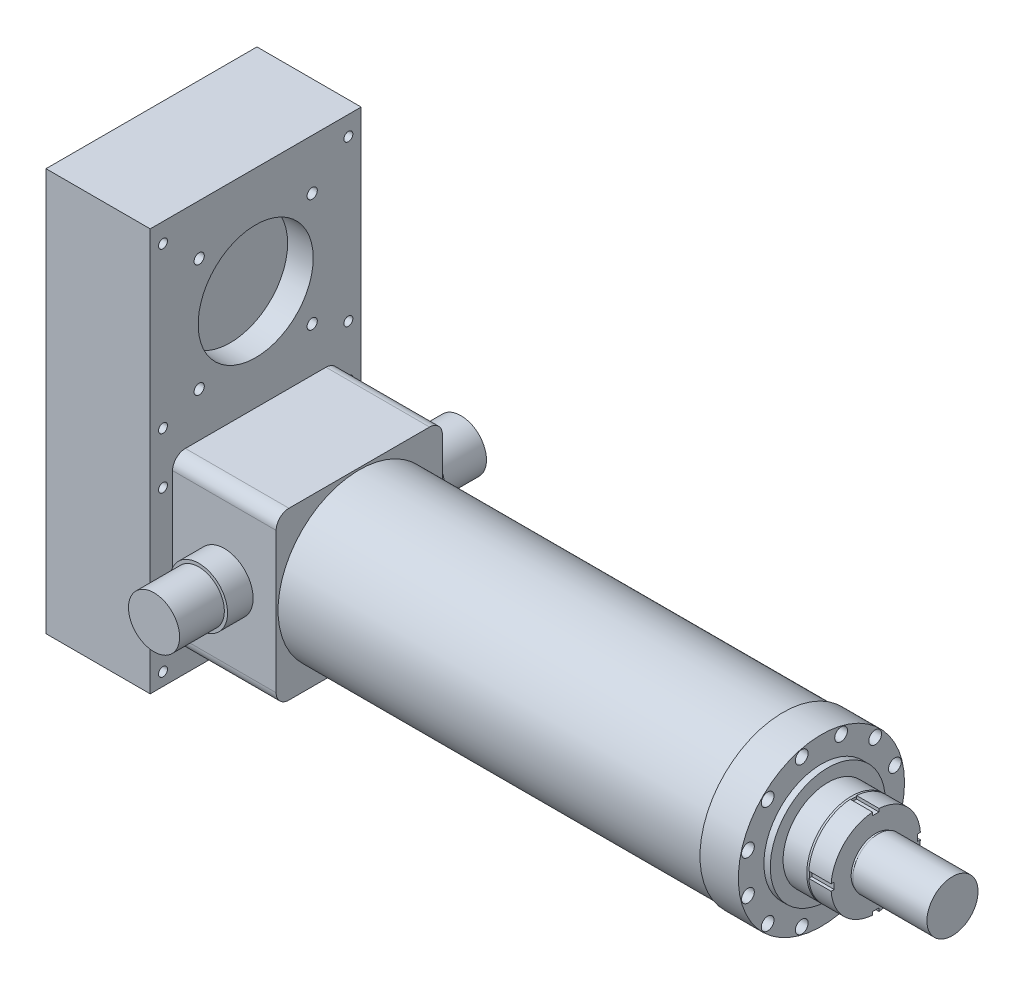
ISO-10303-21;
HEADER;
FILE_DESCRIPTION(('STEP AP214'),'2;1');
FILE_NAME('part.step','',(''),(''),'','','');
FILE_SCHEMA(('AUTOMOTIVE_DESIGN { 1 0 10303 214 1 1 1 1 }'));
ENDSEC;
DATA;
#1=APPLICATION_CONTEXT('core data for automotive mechanical design processes');
#2=APPLICATION_PROTOCOL_DEFINITION('international standard','automotive_design',2000,#1);
#3=PRODUCT_CONTEXT('',#1,'mechanical');
#4=PRODUCT('Part','Part','',(#3));
#5=PRODUCT_RELATED_PRODUCT_CATEGORY('part','',(#4));
#6=PRODUCT_DEFINITION_FORMATION('','',#4);
#7=PRODUCT_DEFINITION_CONTEXT('part definition',#1,'design');
#8=PRODUCT_DEFINITION('design','',#6,#7);
#9=PRODUCT_DEFINITION_SHAPE('','',#8);
#10=(LENGTH_UNIT() NAMED_UNIT(*) SI_UNIT(.MILLI.,.METRE.));
#11=(NAMED_UNIT(*) PLANE_ANGLE_UNIT() SI_UNIT($,.RADIAN.));
#12=(NAMED_UNIT(*) SI_UNIT($,.STERADIAN.) SOLID_ANGLE_UNIT());
#13=UNCERTAINTY_MEASURE_WITH_UNIT(LENGTH_MEASURE(1.E-05),#10,'distance_accuracy_value','');
#14=(GEOMETRIC_REPRESENTATION_CONTEXT(3) GLOBAL_UNCERTAINTY_ASSIGNED_CONTEXT((#13)) GLOBAL_UNIT_ASSIGNED_CONTEXT((#10,
#11,#12)) REPRESENTATION_CONTEXT('',''));
#15=CARTESIAN_POINT('',(0.,0.,0.));
#16=DIRECTION('',(0.,0.,1.));
#17=DIRECTION('',(1.,0.,0.));
#18=AXIS2_PLACEMENT_3D('',#15,#16,#17);
#19=CARTESIAN_POINT('',(-325.,455.,165.));
#20=DIRECTION('',(0.,0.,-1.));
#21=DIRECTION('',(0.,1.,0.));
#22=AXIS2_PLACEMENT_3D('',#19,#20,#21);
#23=PLANE('',#22);
#24=DIRECTION('',(0.,1.,0.));
#25=VECTOR('',#24,1.);
#26=CARTESIAN_POINT('',(-162.,455.,165.));
#27=LINE('',#26,#25);
#28=CARTESIAN_POINT('',(-162.,-175.,165.));
#29=VERTEX_POINT('',#28);
#30=CARTESIAN_POINT('',(-162.,455.,165.));
#31=VERTEX_POINT('',#30);
#32=EDGE_CURVE('E117',#29,#31,#27,.T.);
#33=ORIENTED_EDGE('',*,*,#32,.T.);
#34=DIRECTION('',(1.,0.,0.));
#35=VECTOR('',#34,1.);
#36=CARTESIAN_POINT('',(-325.,455.,165.));
#37=LINE('',#36,#35);
#38=CARTESIAN_POINT('',(-325.,455.,165.));
#39=VERTEX_POINT('',#38);
#40=EDGE_CURVE('E12',#39,#31,#37,.T.);
#41=ORIENTED_EDGE('',*,*,#40,.F.);
#42=DIRECTION('',(0.,1.,0.));
#43=VECTOR('',#42,1.);
#44=CARTESIAN_POINT('',(-325.,455.,165.));
#45=LINE('',#44,#43);
#46=CARTESIAN_POINT('',(-325.,-175.,165.));
#47=VERTEX_POINT('',#46);
#48=EDGE_CURVE('E101',#47,#39,#45,.T.);
#49=ORIENTED_EDGE('',*,*,#48,.F.);
#50=DIRECTION('',(1.,0.,0.));
#51=VECTOR('',#50,1.);
#52=CARTESIAN_POINT('',(-325.,-175.,165.));
#53=LINE('',#52,#51);
#54=EDGE_CURVE('E113',#47,#29,#53,.T.);
#55=ORIENTED_EDGE('',*,*,#54,.T.);
#56=EDGE_LOOP('',(#33,#41,#49,#55));
#57=FACE_BOUND('',#56,.T.);
#58=ADVANCED_FACE('F49',(#57),#23,.F.);
#59=CARTESIAN_POINT('',(-325.,455.,-165.));
#60=DIRECTION('',(0.,-1.,0.));
#61=DIRECTION('',(0.,0.,-1.));
#62=AXIS2_PLACEMENT_3D('',#59,#60,#61);
#63=PLANE('',#62);
#64=DIRECTION('',(0.,0.,-1.));
#65=VECTOR('',#64,1.);
#66=CARTESIAN_POINT('',(-162.,455.,-165.));
#67=LINE('',#66,#65);
#68=CARTESIAN_POINT('',(-162.,455.,-165.));
#69=VERTEX_POINT('',#68);
#70=EDGE_CURVE('E106',#31,#69,#67,.T.);
#71=ORIENTED_EDGE('',*,*,#70,.T.);
#72=DIRECTION('',(1.,0.,0.));
#73=VECTOR('',#72,1.);
#74=CARTESIAN_POINT('',(-325.,455.,-165.));
#75=LINE('',#74,#73);
#76=CARTESIAN_POINT('',(-325.,455.,-165.));
#77=VERTEX_POINT('',#76);
#78=EDGE_CURVE('E58',#77,#69,#75,.T.);
#79=ORIENTED_EDGE('',*,*,#78,.F.);
#80=DIRECTION('',(0.,0.,-1.));
#81=VECTOR('',#80,1.);
#82=CARTESIAN_POINT('',(-325.,455.,-165.));
#83=LINE('',#82,#81);
#84=EDGE_CURVE('E96',#39,#77,#83,.T.);
#85=ORIENTED_EDGE('',*,*,#84,.F.);
#86=ORIENTED_EDGE('',*,*,#40,.T.);
#87=EDGE_LOOP('',(#71,#79,#85,#86));
#88=FACE_BOUND('',#87,.T.);
#89=ADVANCED_FACE('F105',(#88),#63,.F.);
#90=CARTESIAN_POINT('',(-325.,455.,-165.));
#91=DIRECTION('',(0.,0.,1.));
#92=DIRECTION('',(0.,-1.,0.));
#93=AXIS2_PLACEMENT_3D('',#90,#91,#92);
#94=PLANE('',#93);
#95=DIRECTION('',(0.,-1.,0.));
#96=VECTOR('',#95,1.);
#97=CARTESIAN_POINT('',(-162.,455.,-165.));
#98=LINE('',#97,#96);
#99=CARTESIAN_POINT('',(-162.,-175.,-165.));
#100=VERTEX_POINT('',#99);
#101=EDGE_CURVE('E83',#69,#100,#98,.T.);
#102=ORIENTED_EDGE('',*,*,#101,.T.);
#103=DIRECTION('',(1.,0.,0.));
#104=VECTOR('',#103,1.);
#105=CARTESIAN_POINT('',(-325.,-175.,-165.));
#106=LINE('',#105,#104);
#107=CARTESIAN_POINT('',(-325.,-175.,-165.));
#108=VERTEX_POINT('',#107);
#109=EDGE_CURVE('E108',#108,#100,#106,.T.);
#110=ORIENTED_EDGE('',*,*,#109,.F.);
#111=DIRECTION('',(0.,-1.,0.));
#112=VECTOR('',#111,1.);
#113=CARTESIAN_POINT('',(-325.,455.,-165.));
#114=LINE('',#113,#112);
#115=EDGE_CURVE('E99',#77,#108,#114,.T.);
#116=ORIENTED_EDGE('',*,*,#115,.F.);
#117=ORIENTED_EDGE('',*,*,#78,.T.);
#118=EDGE_LOOP('',(#102,#110,#116,#117));
#119=FACE_BOUND('',#118,.T.);
#120=ADVANCED_FACE('F109',(#119),#94,.F.);
#121=CARTESIAN_POINT('',(-325.,-175.,-165.));
#122=DIRECTION('',(0.,1.,0.));
#123=DIRECTION('',(0.,0.,1.));
#124=AXIS2_PLACEMENT_3D('',#121,#122,#123);
#125=PLANE('',#124);
#126=DIRECTION('',(0.,0.,1.));
#127=VECTOR('',#126,1.);
#128=CARTESIAN_POINT('',(-162.,-175.,-165.));
#129=LINE('',#128,#127);
#130=EDGE_CURVE('E89',#100,#29,#129,.T.);
#131=ORIENTED_EDGE('',*,*,#130,.T.);
#132=ORIENTED_EDGE('',*,*,#54,.F.);
#133=DIRECTION('',(0.,0.,1.));
#134=VECTOR('',#133,1.);
#135=CARTESIAN_POINT('',(-325.,-175.,-165.));
#136=LINE('',#135,#134);
#137=EDGE_CURVE('E66',#108,#47,#136,.T.);
#138=ORIENTED_EDGE('',*,*,#137,.F.);
#139=ORIENTED_EDGE('',*,*,#109,.T.);
#140=EDGE_LOOP('',(#131,#132,#138,#139));
#141=FACE_BOUND('',#140,.T.);
#142=ADVANCED_FACE('F131',(#141),#125,.F.);
#143=CARTESIAN_POINT('',(-325.,0.,0.));
#144=DIRECTION('',(-1.,0.,0.));
#145=DIRECTION('',(0.,0.,1.));
#146=AXIS2_PLACEMENT_3D('',#143,#144,#145);
#147=PLANE('',#146);
#148=ORIENTED_EDGE('',*,*,#48,.T.);
#149=ORIENTED_EDGE('',*,*,#84,.T.);
#150=ORIENTED_EDGE('',*,*,#115,.T.);
#151=ORIENTED_EDGE('',*,*,#137,.T.);
#152=EDGE_LOOP('',(#148,#149,#150,#151));
#153=FACE_BOUND('',#152,.T.);
#154=ADVANCED_FACE('F97',(#153),#147,.T.);
#155=CARTESIAN_POINT('',(-162.,0.,0.));
#156=DIRECTION('',(-1.,0.,0.));
#157=DIRECTION('',(0.,0.,1.));
#158=AXIS2_PLACEMENT_3D('',#155,#156,#157);
#159=PLANE('',#158);
#160=CARTESIAN_POINT('',(-162.,-155.,145.));
#161=DIRECTION('',(1.,0.,0.));
#162=DIRECTION('',(0.,0.,-1.));
#163=AXIS2_PLACEMENT_3D('',#160,#161,#162);
#164=CIRCLE('',#163,7.00000000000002);
#165=CARTESIAN_POINT('',(-162.,-155.,138.));
#166=VERTEX_POINT('',#165);
#167=EDGE_CURVE('E178',#166,#166,#164,.T.);
#168=ORIENTED_EDGE('',*,*,#167,.F.);
#169=EDGE_LOOP('',(#168));
#170=FACE_BOUND('',#169,.T.);
#171=CARTESIAN_POINT('',(-162.,-94.5,145.));
#172=DIRECTION('',(1.,0.,0.));
#173=DIRECTION('',(0.,0.,-1.));
#174=AXIS2_PLACEMENT_3D('',#171,#172,#173);
#175=CIRCLE('',#174,7.00000000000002);
#176=CARTESIAN_POINT('',(-162.,-94.5,138.));
#177=VERTEX_POINT('',#176);
#178=EDGE_CURVE('E187',#177,#177,#175,.T.);
#179=ORIENTED_EDGE('',*,*,#178,.F.);
#180=EDGE_LOOP('',(#179));
#181=FACE_BOUND('',#180,.T.);
#182=CARTESIAN_POINT('',(-162.,94.5,145.));
#183=DIRECTION('',(1.,0.,0.));
#184=DIRECTION('',(0.,0.,-1.));
#185=AXIS2_PLACEMENT_3D('',#182,#183,#184);
#186=CIRCLE('',#185,7.00000000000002);
#187=CARTESIAN_POINT('',(-162.,94.5,138.));
#188=VERTEX_POINT('',#187);
#189=EDGE_CURVE('E195',#188,#188,#186,.T.);
#190=ORIENTED_EDGE('',*,*,#189,.F.);
#191=EDGE_LOOP('',(#190));
#192=FACE_BOUND('',#191,.T.);
#193=CARTESIAN_POINT('',(-162.,199.611652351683,88.3883476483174));
#194=DIRECTION('',(1.,0.,0.));
#195=DIRECTION('',(0.,0.,-1.));
#196=AXIS2_PLACEMENT_3D('',#193,#194,#195);
#197=CIRCLE('',#196,8.00000000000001);
#198=CARTESIAN_POINT('',(-162.,199.611652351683,80.3883476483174));
#199=VERTEX_POINT('',#198);
#200=EDGE_CURVE('E203',#199,#199,#197,.T.);
#201=ORIENTED_EDGE('',*,*,#200,.F.);
#202=EDGE_LOOP('',(#201));
#203=FACE_BOUND('',#202,.T.);
#204=CARTESIAN_POINT('',(-162.,199.611652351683,-88.3883476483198));
#205=DIRECTION('',(1.,0.,0.));
#206=DIRECTION('',(0.,0.,-1.));
#207=AXIS2_PLACEMENT_3D('',#204,#205,#206);
#208=CIRCLE('',#207,8.00000000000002);
#209=CARTESIAN_POINT('',(-162.,199.611652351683,-96.3883476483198));
#210=VERTEX_POINT('',#209);
#211=EDGE_CURVE('E146',#210,#210,#208,.T.);
#212=ORIENTED_EDGE('',*,*,#211,.F.);
#213=EDGE_LOOP('',(#212));
#214=FACE_BOUND('',#213,.T.);
#215=CARTESIAN_POINT('',(-162.,376.38834764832,-88.3883476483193));
#216=DIRECTION('',(1.,0.,0.));
#217=DIRECTION('',(0.,0.,-1.));
#218=AXIS2_PLACEMENT_3D('',#215,#216,#217);
#219=CIRCLE('',#218,7.99999999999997);
#220=CARTESIAN_POINT('',(-162.,376.38834764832,-96.3883476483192));
#221=VERTEX_POINT('',#220);
#222=EDGE_CURVE('E155',#221,#221,#219,.T.);
#223=ORIENTED_EDGE('',*,*,#222,.F.);
#224=EDGE_LOOP('',(#223));
#225=FACE_BOUND('',#224,.T.);
#226=CARTESIAN_POINT('',(-162.,175.,145.));
#227=DIRECTION('',(1.,0.,0.));
#228=DIRECTION('',(0.,0.,-1.));
#229=AXIS2_PLACEMENT_3D('',#226,#227,#228);
#230=CIRCLE('',#229,7.00000000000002);
#231=CARTESIAN_POINT('',(-162.,175.,138.));
#232=VERTEX_POINT('',#231);
#233=EDGE_CURVE('E163',#232,#232,#230,.T.);
#234=ORIENTED_EDGE('',*,*,#233,.F.);
#235=EDGE_LOOP('',(#234));
#236=FACE_BOUND('',#235,.T.);
#237=CARTESIAN_POINT('',(-162.,376.388347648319,88.3883476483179));
#238=DIRECTION('',(1.,0.,0.));
#239=DIRECTION('',(0.,0.,-1.));
#240=AXIS2_PLACEMENT_3D('',#237,#238,#239);
#241=CIRCLE('',#240,8.00000000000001);
#242=CARTESIAN_POINT('',(-162.,376.388347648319,80.3883476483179));
#243=VERTEX_POINT('',#242);
#244=EDGE_CURVE('E171',#243,#243,#241,.T.);
#245=ORIENTED_EDGE('',*,*,#244,.F.);
#246=EDGE_LOOP('',(#245));
#247=FACE_BOUND('',#246,.T.);
#248=CARTESIAN_POINT('',(-162.,425.,-145.));
#249=DIRECTION('',(1.,0.,0.));
#250=DIRECTION('',(0.,0.,1.));
#251=AXIS2_PLACEMENT_3D('',#248,#249,#250);
#252=CIRCLE('',#251,7.00000000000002);
#253=CARTESIAN_POINT('',(-162.,425.,-138.));
#254=VERTEX_POINT('',#253);
#255=EDGE_CURVE('E242',#254,#254,#252,.T.);
#256=ORIENTED_EDGE('',*,*,#255,.F.);
#257=EDGE_LOOP('',(#256));
#258=FACE_BOUND('',#257,.T.);
#259=CARTESIAN_POINT('',(-162.,175.,-145.));
#260=DIRECTION('',(1.,0.,0.));
#261=DIRECTION('',(0.,0.,1.));
#262=AXIS2_PLACEMENT_3D('',#259,#260,#261);
#263=CIRCLE('',#262,7.00000000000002);
#264=CARTESIAN_POINT('',(-162.,175.,-138.));
#265=VERTEX_POINT('',#264);
#266=EDGE_CURVE('E250',#265,#265,#263,.T.);
#267=ORIENTED_EDGE('',*,*,#266,.F.);
#268=EDGE_LOOP('',(#267));
#269=FACE_BOUND('',#268,.T.);
#270=CARTESIAN_POINT('',(-162.,425.,145.));
#271=DIRECTION('',(1.,0.,0.));
#272=DIRECTION('',(0.,0.,-1.));
#273=AXIS2_PLACEMENT_3D('',#270,#271,#272);
#274=CIRCLE('',#273,7.00000000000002);
#275=CARTESIAN_POINT('',(-162.,425.,138.));
#276=VERTEX_POINT('',#275);
#277=EDGE_CURVE('E219',#276,#276,#274,.T.);
#278=ORIENTED_EDGE('',*,*,#277,.F.);
#279=EDGE_LOOP('',(#278));
#280=FACE_BOUND('',#279,.T.);
#281=CARTESIAN_POINT('',(-162.,-155.,-145.));
#282=DIRECTION('',(1.,0.,0.));
#283=DIRECTION('',(0.,0.,1.));
#284=AXIS2_PLACEMENT_3D('',#281,#282,#283);
#285=CIRCLE('',#284,7.00000000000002);
#286=CARTESIAN_POINT('',(-162.,-155.,-138.));
#287=VERTEX_POINT('',#286);
#288=EDGE_CURVE('E210',#287,#287,#285,.T.);
#289=ORIENTED_EDGE('',*,*,#288,.F.);
#290=EDGE_LOOP('',(#289));
#291=FACE_BOUND('',#290,.T.);
#292=CARTESIAN_POINT('',(-162.,-94.5000000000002,-145.));
#293=DIRECTION('',(1.,0.,0.));
#294=DIRECTION('',(0.,0.,1.));
#295=AXIS2_PLACEMENT_3D('',#292,#293,#294);
#296=CIRCLE('',#295,7.00000000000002);
#297=CARTESIAN_POINT('',(-162.,-94.5000000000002,-138.));
#298=VERTEX_POINT('',#297);
#299=EDGE_CURVE('E235',#298,#298,#296,.T.);
#300=ORIENTED_EDGE('',*,*,#299,.F.);
#301=EDGE_LOOP('',(#300));
#302=FACE_BOUND('',#301,.T.);
#303=CARTESIAN_POINT('',(-162.,94.4999999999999,-145.));
#304=DIRECTION('',(1.,0.,0.));
#305=DIRECTION('',(0.,0.,1.));
#306=AXIS2_PLACEMENT_3D('',#303,#304,#305);
#307=CIRCLE('',#306,7.00000000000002);
#308=CARTESIAN_POINT('',(-162.,94.4999999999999,-138.));
#309=VERTEX_POINT('',#308);
#310=EDGE_CURVE('E226',#309,#309,#307,.T.);
#311=ORIENTED_EDGE('',*,*,#310,.F.);
#312=EDGE_LOOP('',(#311));
#313=FACE_BOUND('',#312,.T.);
#314=CARTESIAN_POINT('',(-162.,288.,0.));
#315=DIRECTION('',(1.,0.,0.));
#316=DIRECTION('',(0.,0.,-1.));
#317=AXIS2_PLACEMENT_3D('',#314,#315,#316);
#318=CIRCLE('',#317,90.);
#319=CARTESIAN_POINT('',(-162.,288.,-90.));
#320=VERTEX_POINT('',#319);
#321=EDGE_CURVE('E138',#320,#320,#318,.T.);
#322=ORIENTED_EDGE('',*,*,#321,.F.);
#323=EDGE_LOOP('',(#322));
#324=FACE_BOUND('',#323,.T.);
#325=ORIENTED_EDGE('',*,*,#32,.F.);
#326=ORIENTED_EDGE('',*,*,#130,.F.);
#327=ORIENTED_EDGE('',*,*,#101,.F.);
#328=ORIENTED_EDGE('',*,*,#70,.F.);
#329=EDGE_LOOP('',(#325,#326,#327,#328));
#330=FACE_BOUND('',#329,.T.);
#331=ADVANCED_FACE('F134',(#170,#181,#192,#203,#214,#225,#236,#247,#258,#269,#280,#291,#302,
#313,#324,#330),#159,.F.);
#332=CARTESIAN_POINT('',(-202.,288.,0.));
#333=DIRECTION('',(1.,0.,0.));
#334=DIRECTION('',(0.,0.,-1.));
#335=AXIS2_PLACEMENT_3D('',#332,#333,#334);
#336=CYLINDRICAL_SURFACE('',#335,90.);
#337=CARTESIAN_POINT('',(-202.,288.,0.));
#338=DIRECTION('',(1.,0.,0.));
#339=DIRECTION('',(0.,0.,-1.));
#340=AXIS2_PLACEMENT_3D('',#337,#338,#339);
#341=CIRCLE('',#340,90.);
#342=CARTESIAN_POINT('',(-202.,288.,-90.));
#343=VERTEX_POINT('',#342);
#344=EDGE_CURVE('E121',#343,#343,#341,.T.);
#345=ORIENTED_EDGE('',*,*,#344,.F.);
#346=EDGE_LOOP('',(#345));
#347=FACE_BOUND('',#346,.T.);
#348=ORIENTED_EDGE('',*,*,#321,.T.);
#349=EDGE_LOOP('',(#348));
#350=FACE_BOUND('',#349,.T.);
#351=ADVANCED_FACE('F269',(#347,#350),#336,.F.);
#352=CARTESIAN_POINT('',(-202.,288.,0.));
#353=DIRECTION('',(1.,0.,0.));
#354=DIRECTION('',(0.,0.,-1.));
#355=AXIS2_PLACEMENT_3D('',#352,#353,#354);
#356=PLANE('',#355);
#357=ORIENTED_EDGE('',*,*,#344,.T.);
#358=EDGE_LOOP('',(#357));
#359=FACE_BOUND('',#358,.T.);
#360=ADVANCED_FACE('F283',(#359),#356,.T.);
#361=CARTESIAN_POINT('',(-202.,94.4999999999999,-145.));
#362=DIRECTION('',(1.,0.,0.));
#363=DIRECTION('',(0.,0.,-1.));
#364=AXIS2_PLACEMENT_3D('',#361,#362,#363);
#365=CYLINDRICAL_SURFACE('',#364,7.00000000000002);
#366=CARTESIAN_POINT('',(-202.,94.4999999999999,-145.));
#367=DIRECTION('',(1.,0.,0.));
#368=DIRECTION('',(0.,0.,1.));
#369=AXIS2_PLACEMENT_3D('',#366,#367,#368);
#370=CIRCLE('',#369,7.00000000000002);
#371=CARTESIAN_POINT('',(-202.,94.4999999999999,-138.));
#372=VERTEX_POINT('',#371);
#373=EDGE_CURVE('E230',#372,#372,#370,.T.);
#374=ORIENTED_EDGE('',*,*,#373,.F.);
#375=EDGE_LOOP('',(#374));
#376=FACE_BOUND('',#375,.T.);
#377=ORIENTED_EDGE('',*,*,#310,.T.);
#378=EDGE_LOOP('',(#377));
#379=FACE_BOUND('',#378,.T.);
#380=ADVANCED_FACE('F289',(#376,#379),#365,.F.);
#381=CARTESIAN_POINT('',(-202.,94.4999999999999,-145.));
#382=DIRECTION('',(-1.,0.,0.));
#383=DIRECTION('',(0.,0.,1.));
#384=AXIS2_PLACEMENT_3D('',#381,#382,#383);
#385=PLANE('',#384);
#386=ORIENTED_EDGE('',*,*,#373,.T.);
#387=EDGE_LOOP('',(#386));
#388=FACE_BOUND('',#387,.T.);
#389=ADVANCED_FACE('F332',(#388),#385,.F.);
#390=CARTESIAN_POINT('',(-202.,-94.5000000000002,-145.));
#391=DIRECTION('',(1.,0.,0.));
#392=DIRECTION('',(0.,0.,-1.));
#393=AXIS2_PLACEMENT_3D('',#390,#391,#392);
#394=CYLINDRICAL_SURFACE('',#393,7.00000000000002);
#395=CARTESIAN_POINT('',(-202.,-94.5000000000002,-145.));
#396=DIRECTION('',(1.,0.,0.));
#397=DIRECTION('',(0.,0.,1.));
#398=AXIS2_PLACEMENT_3D('',#395,#396,#397);
#399=CIRCLE('',#398,7.00000000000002);
#400=CARTESIAN_POINT('',(-202.,-94.5000000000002,-138.));
#401=VERTEX_POINT('',#400);
#402=EDGE_CURVE('E215',#401,#401,#399,.T.);
#403=ORIENTED_EDGE('',*,*,#402,.F.);
#404=EDGE_LOOP('',(#403));
#405=FACE_BOUND('',#404,.T.);
#406=ORIENTED_EDGE('',*,*,#299,.T.);
#407=EDGE_LOOP('',(#406));
#408=FACE_BOUND('',#407,.T.);
#409=ADVANCED_FACE('F342',(#405,#408),#394,.F.);
#410=CARTESIAN_POINT('',(-202.,-94.5000000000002,-145.));
#411=DIRECTION('',(-1.,0.,0.));
#412=DIRECTION('',(0.,0.,1.));
#413=AXIS2_PLACEMENT_3D('',#410,#411,#412);
#414=PLANE('',#413);
#415=ORIENTED_EDGE('',*,*,#402,.T.);
#416=EDGE_LOOP('',(#415));
#417=FACE_BOUND('',#416,.T.);
#418=ADVANCED_FACE('F352',(#417),#414,.F.);
#419=CARTESIAN_POINT('',(-202.,-155.,-145.));
#420=DIRECTION('',(1.,0.,0.));
#421=DIRECTION('',(0.,0.,-1.));
#422=AXIS2_PLACEMENT_3D('',#419,#420,#421);
#423=CYLINDRICAL_SURFACE('',#422,7.00000000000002);
#424=CARTESIAN_POINT('',(-202.,-155.,-145.));
#425=DIRECTION('',(1.,0.,0.));
#426=DIRECTION('',(0.,0.,1.));
#427=AXIS2_PLACEMENT_3D('',#424,#425,#426);
#428=CIRCLE('',#427,7.00000000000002);
#429=CARTESIAN_POINT('',(-202.,-155.,-138.));
#430=VERTEX_POINT('',#429);
#431=EDGE_CURVE('E214',#430,#430,#428,.T.);
#432=ORIENTED_EDGE('',*,*,#431,.F.);
#433=EDGE_LOOP('',(#432));
#434=FACE_BOUND('',#433,.T.);
#435=ORIENTED_EDGE('',*,*,#288,.T.);
#436=EDGE_LOOP('',(#435));
#437=FACE_BOUND('',#436,.T.);
#438=ADVANCED_FACE('F362',(#434,#437),#423,.F.);
#439=CARTESIAN_POINT('',(-202.,-155.,-145.));
#440=DIRECTION('',(-1.,0.,0.));
#441=DIRECTION('',(0.,0.,1.));
#442=AXIS2_PLACEMENT_3D('',#439,#440,#441);
#443=PLANE('',#442);
#444=ORIENTED_EDGE('',*,*,#431,.T.);
#445=EDGE_LOOP('',(#444));
#446=FACE_BOUND('',#445,.T.);
#447=ADVANCED_FACE('F372',(#446),#443,.F.);
#448=CARTESIAN_POINT('',(-202.,425.,145.));
#449=DIRECTION('',(1.,0.,0.));
#450=DIRECTION('',(0.,0.,-1.));
#451=AXIS2_PLACEMENT_3D('',#448,#449,#450);
#452=CYLINDRICAL_SURFACE('',#451,7.00000000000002);
#453=CARTESIAN_POINT('',(-202.,425.,145.));
#454=DIRECTION('',(1.,0.,0.));
#455=DIRECTION('',(0.,0.,-1.));
#456=AXIS2_PLACEMENT_3D('',#453,#454,#455);
#457=CIRCLE('',#456,7.00000000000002);
#458=CARTESIAN_POINT('',(-202.,425.,138.));
#459=VERTEX_POINT('',#458);
#460=EDGE_CURVE('E183',#459,#459,#457,.T.);
#461=ORIENTED_EDGE('',*,*,#460,.F.);
#462=EDGE_LOOP('',(#461));
#463=FACE_BOUND('',#462,.T.);
#464=ORIENTED_EDGE('',*,*,#277,.T.);
#465=EDGE_LOOP('',(#464));
#466=FACE_BOUND('',#465,.T.);
#467=ADVANCED_FACE('F382',(#463,#466),#452,.F.);
#468=CARTESIAN_POINT('',(-202.,425.,145.));
#469=DIRECTION('',(1.,0.,0.));
#470=DIRECTION('',(0.,0.,-1.));
#471=AXIS2_PLACEMENT_3D('',#468,#469,#470);
#472=PLANE('',#471);
#473=ORIENTED_EDGE('',*,*,#460,.T.);
#474=EDGE_LOOP('',(#473));
#475=FACE_BOUND('',#474,.T.);
#476=ADVANCED_FACE('F263',(#475),#472,.T.);
#477=CARTESIAN_POINT('',(-202.,175.,-145.));
#478=DIRECTION('',(1.,0.,0.));
#479=DIRECTION('',(0.,0.,-1.));
#480=AXIS2_PLACEMENT_3D('',#477,#478,#479);
#481=CYLINDRICAL_SURFACE('',#480,7.00000000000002);
#482=CARTESIAN_POINT('',(-202.,175.,-145.));
#483=DIRECTION('',(1.,0.,0.));
#484=DIRECTION('',(0.,0.,1.));
#485=AXIS2_PLACEMENT_3D('',#482,#483,#484);
#486=CIRCLE('',#485,7.00000000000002);
#487=CARTESIAN_POINT('',(-202.,175.,-138.));
#488=VERTEX_POINT('',#487);
#489=EDGE_CURVE('E231',#488,#488,#486,.T.);
#490=ORIENTED_EDGE('',*,*,#489,.F.);
#491=EDGE_LOOP('',(#490));
#492=FACE_BOUND('',#491,.T.);
#493=ORIENTED_EDGE('',*,*,#266,.T.);
#494=EDGE_LOOP('',(#493));
#495=FACE_BOUND('',#494,.T.);
#496=ADVANCED_FACE('F260',(#492,#495),#481,.F.);
#497=CARTESIAN_POINT('',(-202.,175.,-145.));
#498=DIRECTION('',(-1.,0.,0.));
#499=DIRECTION('',(0.,0.,1.));
#500=AXIS2_PLACEMENT_3D('',#497,#498,#499);
#501=PLANE('',#500);
#502=ORIENTED_EDGE('',*,*,#489,.T.);
#503=EDGE_LOOP('',(#502));
#504=FACE_BOUND('',#503,.T.);
#505=ADVANCED_FACE('F258',(#504),#501,.F.);
#506=CARTESIAN_POINT('',(-202.,425.,-145.));
#507=DIRECTION('',(1.,0.,0.));
#508=DIRECTION('',(0.,0.,-1.));
#509=AXIS2_PLACEMENT_3D('',#506,#507,#508);
#510=CYLINDRICAL_SURFACE('',#509,7.00000000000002);
#511=CARTESIAN_POINT('',(-202.,425.,-145.));
#512=DIRECTION('',(1.,0.,0.));
#513=DIRECTION('',(0.,0.,1.));
#514=AXIS2_PLACEMENT_3D('',#511,#512,#513);
#515=CIRCLE('',#514,7.00000000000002);
#516=CARTESIAN_POINT('',(-202.,425.,-138.));
#517=VERTEX_POINT('',#516);
#518=EDGE_CURVE('E246',#517,#517,#515,.T.);
#519=ORIENTED_EDGE('',*,*,#518,.F.);
#520=EDGE_LOOP('',(#519));
#521=FACE_BOUND('',#520,.T.);
#522=ORIENTED_EDGE('',*,*,#255,.T.);
#523=EDGE_LOOP('',(#522));
#524=FACE_BOUND('',#523,.T.);
#525=ADVANCED_FACE('F416',(#521,#524),#510,.F.);
#526=CARTESIAN_POINT('',(-202.,425.,-145.));
#527=DIRECTION('',(-1.,0.,0.));
#528=DIRECTION('',(0.,0.,1.));
#529=AXIS2_PLACEMENT_3D('',#526,#527,#528);
#530=PLANE('',#529);
#531=ORIENTED_EDGE('',*,*,#518,.T.);
#532=EDGE_LOOP('',(#531));
#533=FACE_BOUND('',#532,.T.);
#534=ADVANCED_FACE('F425',(#533),#530,.F.);
#535=CARTESIAN_POINT('',(-202.,376.388347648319,88.3883476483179));
#536=DIRECTION('',(1.,0.,0.));
#537=DIRECTION('',(0.,0.,-1.));
#538=AXIS2_PLACEMENT_3D('',#535,#536,#537);
#539=CYLINDRICAL_SURFACE('',#538,8.00000000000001);
#540=CARTESIAN_POINT('',(-202.,376.388347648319,88.3883476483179));
#541=DIRECTION('',(1.,0.,0.));
#542=DIRECTION('',(0.,0.,-1.));
#543=AXIS2_PLACEMENT_3D('',#540,#541,#542);
#544=CIRCLE('',#543,8.00000000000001);
#545=CARTESIAN_POINT('',(-202.,376.388347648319,80.3883476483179));
#546=VERTEX_POINT('',#545);
#547=EDGE_CURVE('E142',#546,#546,#544,.T.);
#548=ORIENTED_EDGE('',*,*,#547,.F.);
#549=EDGE_LOOP('',(#548));
#550=FACE_BOUND('',#549,.T.);
#551=ORIENTED_EDGE('',*,*,#244,.T.);
#552=EDGE_LOOP('',(#551));
#553=FACE_BOUND('',#552,.T.);
#554=ADVANCED_FACE('F435',(#550,#553),#539,.F.);
#555=CARTESIAN_POINT('',(-202.,376.388347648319,88.3883476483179));
#556=DIRECTION('',(1.,0.,0.));
#557=DIRECTION('',(0.,0.,-1.));
#558=AXIS2_PLACEMENT_3D('',#555,#556,#557);
#559=PLANE('',#558);
#560=ORIENTED_EDGE('',*,*,#547,.T.);
#561=EDGE_LOOP('',(#560));
#562=FACE_BOUND('',#561,.T.);
#563=ADVANCED_FACE('F445',(#562),#559,.T.);
#564=CARTESIAN_POINT('',(-202.,175.,145.));
#565=DIRECTION('',(1.,0.,0.));
#566=DIRECTION('',(0.,0.,-1.));
#567=AXIS2_PLACEMENT_3D('',#564,#565,#566);
#568=CYLINDRICAL_SURFACE('',#567,7.00000000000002);
#569=CARTESIAN_POINT('',(-202.,175.,145.));
#570=DIRECTION('',(1.,0.,0.));
#571=DIRECTION('',(0.,0.,-1.));
#572=AXIS2_PLACEMENT_3D('',#569,#570,#571);
#573=CIRCLE('',#572,7.00000000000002);
#574=CARTESIAN_POINT('',(-202.,175.,138.));
#575=VERTEX_POINT('',#574);
#576=EDGE_CURVE('E167',#575,#575,#573,.T.);
#577=ORIENTED_EDGE('',*,*,#576,.F.);
#578=EDGE_LOOP('',(#577));
#579=FACE_BOUND('',#578,.T.);
#580=ORIENTED_EDGE('',*,*,#233,.T.);
#581=EDGE_LOOP('',(#580));
#582=FACE_BOUND('',#581,.T.);
#583=ADVANCED_FACE('F455',(#579,#582),#568,.F.);
#584=CARTESIAN_POINT('',(-202.,175.,145.));
#585=DIRECTION('',(1.,0.,0.));
#586=DIRECTION('',(0.,0.,-1.));
#587=AXIS2_PLACEMENT_3D('',#584,#585,#586);
#588=PLANE('',#587);
#589=ORIENTED_EDGE('',*,*,#576,.T.);
#590=EDGE_LOOP('',(#589));
#591=FACE_BOUND('',#590,.T.);
#592=ADVANCED_FACE('F465',(#591),#588,.T.);
#593=CARTESIAN_POINT('',(-202.,376.38834764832,-88.3883476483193));
#594=DIRECTION('',(1.,0.,0.));
#595=DIRECTION('',(0.,0.,-1.));
#596=AXIS2_PLACEMENT_3D('',#593,#594,#595);
#597=CYLINDRICAL_SURFACE('',#596,7.99999999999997);
#598=CARTESIAN_POINT('',(-202.,376.38834764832,-88.3883476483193));
#599=DIRECTION('',(1.,0.,0.));
#600=DIRECTION('',(0.,0.,-1.));
#601=AXIS2_PLACEMENT_3D('',#598,#599,#600);
#602=CIRCLE('',#601,7.99999999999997);
#603=CARTESIAN_POINT('',(-202.,376.38834764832,-96.3883476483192));
#604=VERTEX_POINT('',#603);
#605=EDGE_CURVE('E159',#604,#604,#602,.T.);
#606=ORIENTED_EDGE('',*,*,#605,.F.);
#607=EDGE_LOOP('',(#606));
#608=FACE_BOUND('',#607,.T.);
#609=ORIENTED_EDGE('',*,*,#222,.T.);
#610=EDGE_LOOP('',(#609));
#611=FACE_BOUND('',#610,.T.);
#612=ADVANCED_FACE('F475',(#608,#611),#597,.F.);
#613=CARTESIAN_POINT('',(-202.,376.38834764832,-88.3883476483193));
#614=DIRECTION('',(1.,0.,0.));
#615=DIRECTION('',(0.,0.,-1.));
#616=AXIS2_PLACEMENT_3D('',#613,#614,#615);
#617=PLANE('',#616);
#618=ORIENTED_EDGE('',*,*,#605,.T.);
#619=EDGE_LOOP('',(#618));
#620=FACE_BOUND('',#619,.T.);
#621=ADVANCED_FACE('F485',(#620),#617,.T.);
#622=CARTESIAN_POINT('',(-202.,199.611652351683,-88.3883476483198));
#623=DIRECTION('',(1.,0.,0.));
#624=DIRECTION('',(0.,0.,-1.));
#625=AXIS2_PLACEMENT_3D('',#622,#623,#624);
#626=CYLINDRICAL_SURFACE('',#625,8.00000000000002);
#627=CARTESIAN_POINT('',(-202.,199.611652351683,-88.3883476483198));
#628=DIRECTION('',(1.,0.,0.));
#629=DIRECTION('',(0.,0.,-1.));
#630=AXIS2_PLACEMENT_3D('',#627,#628,#629);
#631=CIRCLE('',#630,8.00000000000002);
#632=CARTESIAN_POINT('',(-202.,199.611652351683,-96.3883476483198));
#633=VERTEX_POINT('',#632);
#634=EDGE_CURVE('E150',#633,#633,#631,.T.);
#635=ORIENTED_EDGE('',*,*,#634,.F.);
#636=EDGE_LOOP('',(#635));
#637=FACE_BOUND('',#636,.T.);
#638=ORIENTED_EDGE('',*,*,#211,.T.);
#639=EDGE_LOOP('',(#638));
#640=FACE_BOUND('',#639,.T.);
#641=ADVANCED_FACE('F495',(#637,#640),#626,.F.);
#642=CARTESIAN_POINT('',(-202.,199.611652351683,-88.3883476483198));
#643=DIRECTION('',(1.,0.,0.));
#644=DIRECTION('',(0.,0.,-1.));
#645=AXIS2_PLACEMENT_3D('',#642,#643,#644);
#646=PLANE('',#645);
#647=ORIENTED_EDGE('',*,*,#634,.T.);
#648=EDGE_LOOP('',(#647));
#649=FACE_BOUND('',#648,.T.);
#650=ADVANCED_FACE('F505',(#649),#646,.T.);
#651=CARTESIAN_POINT('',(-202.,199.611652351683,88.3883476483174));
#652=DIRECTION('',(1.,0.,0.));
#653=DIRECTION('',(0.,0.,-1.));
#654=AXIS2_PLACEMENT_3D('',#651,#652,#653);
#655=CYLINDRICAL_SURFACE('',#654,8.00000000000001);
#656=CARTESIAN_POINT('',(-202.,199.611652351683,88.3883476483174));
#657=DIRECTION('',(1.,0.,0.));
#658=DIRECTION('',(0.,0.,-1.));
#659=AXIS2_PLACEMENT_3D('',#656,#657,#658);
#660=CIRCLE('',#659,8.00000000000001);
#661=CARTESIAN_POINT('',(-202.,199.611652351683,80.3883476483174));
#662=VERTEX_POINT('',#661);
#663=EDGE_CURVE('E151',#662,#662,#660,.T.);
#664=ORIENTED_EDGE('',*,*,#663,.F.);
#665=EDGE_LOOP('',(#664));
#666=FACE_BOUND('',#665,.T.);
#667=ORIENTED_EDGE('',*,*,#200,.T.);
#668=EDGE_LOOP('',(#667));
#669=FACE_BOUND('',#668,.T.);
#670=ADVANCED_FACE('F515',(#666,#669),#655,.F.);
#671=CARTESIAN_POINT('',(-202.,199.611652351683,88.3883476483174));
#672=DIRECTION('',(1.,0.,0.));
#673=DIRECTION('',(0.,0.,-1.));
#674=AXIS2_PLACEMENT_3D('',#671,#672,#673);
#675=PLANE('',#674);
#676=ORIENTED_EDGE('',*,*,#663,.T.);
#677=EDGE_LOOP('',(#676));
#678=FACE_BOUND('',#677,.T.);
#679=ADVANCED_FACE('F525',(#678),#675,.T.);
#680=CARTESIAN_POINT('',(-202.,94.5,145.));
#681=DIRECTION('',(1.,0.,0.));
#682=DIRECTION('',(0.,0.,-1.));
#683=AXIS2_PLACEMENT_3D('',#680,#681,#682);
#684=CYLINDRICAL_SURFACE('',#683,7.00000000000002);
#685=CARTESIAN_POINT('',(-202.,94.5,145.));
#686=DIRECTION('',(1.,0.,0.));
#687=DIRECTION('',(0.,0.,-1.));
#688=AXIS2_PLACEMENT_3D('',#685,#686,#687);
#689=CIRCLE('',#688,7.00000000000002);
#690=CARTESIAN_POINT('',(-202.,94.5,138.));
#691=VERTEX_POINT('',#690);
#692=EDGE_CURVE('E199',#691,#691,#689,.T.);
#693=ORIENTED_EDGE('',*,*,#692,.F.);
#694=EDGE_LOOP('',(#693));
#695=FACE_BOUND('',#694,.T.);
#696=ORIENTED_EDGE('',*,*,#189,.T.);
#697=EDGE_LOOP('',(#696));
#698=FACE_BOUND('',#697,.T.);
#699=ADVANCED_FACE('F535',(#695,#698),#684,.F.);
#700=CARTESIAN_POINT('',(-202.,94.5,145.));
#701=DIRECTION('',(1.,0.,0.));
#702=DIRECTION('',(0.,0.,-1.));
#703=AXIS2_PLACEMENT_3D('',#700,#701,#702);
#704=PLANE('',#703);
#705=ORIENTED_EDGE('',*,*,#692,.T.);
#706=EDGE_LOOP('',(#705));
#707=FACE_BOUND('',#706,.T.);
#708=ADVANCED_FACE('F545',(#707),#704,.T.);
#709=CARTESIAN_POINT('',(-202.,-94.5,145.));
#710=DIRECTION('',(1.,0.,0.));
#711=DIRECTION('',(0.,0.,-1.));
#712=AXIS2_PLACEMENT_3D('',#709,#710,#711);
#713=CYLINDRICAL_SURFACE('',#712,7.00000000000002);
#714=CARTESIAN_POINT('',(-202.,-94.5,145.));
#715=DIRECTION('',(1.,0.,0.));
#716=DIRECTION('',(0.,0.,-1.));
#717=AXIS2_PLACEMENT_3D('',#714,#715,#716);
#718=CIRCLE('',#717,7.00000000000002);
#719=CARTESIAN_POINT('',(-202.,-94.5,138.));
#720=VERTEX_POINT('',#719);
#721=EDGE_CURVE('E191',#720,#720,#718,.T.);
#722=ORIENTED_EDGE('',*,*,#721,.F.);
#723=EDGE_LOOP('',(#722));
#724=FACE_BOUND('',#723,.T.);
#725=ORIENTED_EDGE('',*,*,#178,.T.);
#726=EDGE_LOOP('',(#725));
#727=FACE_BOUND('',#726,.T.);
#728=ADVANCED_FACE('F555',(#724,#727),#713,.F.);
#729=CARTESIAN_POINT('',(-202.,-94.5,145.));
#730=DIRECTION('',(1.,0.,0.));
#731=DIRECTION('',(0.,0.,-1.));
#732=AXIS2_PLACEMENT_3D('',#729,#730,#731);
#733=PLANE('',#732);
#734=ORIENTED_EDGE('',*,*,#721,.T.);
#735=EDGE_LOOP('',(#734));
#736=FACE_BOUND('',#735,.T.);
#737=ADVANCED_FACE('F565',(#736),#733,.T.);
#738=CARTESIAN_POINT('',(-202.,-155.,145.));
#739=DIRECTION('',(1.,0.,0.));
#740=DIRECTION('',(0.,0.,-1.));
#741=AXIS2_PLACEMENT_3D('',#738,#739,#740);
#742=CYLINDRICAL_SURFACE('',#741,7.00000000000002);
#743=CARTESIAN_POINT('',(-202.,-155.,145.));
#744=DIRECTION('',(1.,0.,0.));
#745=DIRECTION('',(0.,0.,-1.));
#746=AXIS2_PLACEMENT_3D('',#743,#744,#745);
#747=CIRCLE('',#746,7.00000000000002);
#748=CARTESIAN_POINT('',(-202.,-155.,138.));
#749=VERTEX_POINT('',#748);
#750=EDGE_CURVE('E182',#749,#749,#747,.T.);
#751=ORIENTED_EDGE('',*,*,#750,.F.);
#752=EDGE_LOOP('',(#751));
#753=FACE_BOUND('',#752,.T.);
#754=ORIENTED_EDGE('',*,*,#167,.T.);
#755=EDGE_LOOP('',(#754));
#756=FACE_BOUND('',#755,.T.);
#757=ADVANCED_FACE('F575',(#753,#756),#742,.F.);
#758=CARTESIAN_POINT('',(-202.,-155.,145.));
#759=DIRECTION('',(1.,0.,0.));
#760=DIRECTION('',(0.,0.,-1.));
#761=AXIS2_PLACEMENT_3D('',#758,#759,#760);
#762=PLANE('',#761);
#763=ORIENTED_EDGE('',*,*,#750,.T.);
#764=EDGE_LOOP('',(#763));
#765=FACE_BOUND('',#764,.T.);
#766=ADVANCED_FACE('F585',(#765),#762,.T.);
#767=CLOSED_SHELL('',(#58,#89,#120,#142,#154,#331,#351,#360,#380,#389,#409,#418,#438,#447,#467,
#476,#496,#505,#525,#534,#554,#563,#583,#592,#612,#621,#641,#650,#670,#679,#699,#708,#728,#737,
#757,#766));
#768=MANIFOLD_SOLID_BREP('B2',#767);
#769=CARTESIAN_POINT('',(-162.,110.,130.));
#770=DIRECTION('',(0.,0.,-1.));
#771=DIRECTION('',(0.,1.,0.));
#772=AXIS2_PLACEMENT_3D('',#769,#770,#771);
#773=PLANE('',#772);
#774=DIRECTION('',(0.,1.,0.));
#775=VECTOR('',#774,1.);
#776=CARTESIAN_POINT('',(0.,110.,130.));
#777=LINE('',#776,#775);
#778=CARTESIAN_POINT('',(0.,-110.,130.));
#779=VERTEX_POINT('',#778);
#780=CARTESIAN_POINT('',(0.,110.,130.));
#781=VERTEX_POINT('',#780);
#782=EDGE_CURVE('E781',#779,#781,#777,.T.);
#783=ORIENTED_EDGE('',*,*,#782,.T.);
#784=DIRECTION('',(1.,0.,0.));
#785=VECTOR('',#784,1.);
#786=CARTESIAN_POINT('',(-162.,110.,130.));
#787=LINE('',#786,#785);
#788=CARTESIAN_POINT('',(-162.,110.,130.));
#789=VERTEX_POINT('',#788);
#790=EDGE_CURVE('E792',#789,#781,#787,.T.);
#791=ORIENTED_EDGE('',*,*,#790,.F.);
#792=DIRECTION('',(0.,1.,0.));
#793=VECTOR('',#792,1.);
#794=CARTESIAN_POINT('',(-162.,110.,130.));
#795=LINE('',#794,#793);
#796=CARTESIAN_POINT('',(-162.,-110.,130.));
#797=VERTEX_POINT('',#796);
#798=EDGE_CURVE('E818',#797,#789,#795,.T.);
#799=ORIENTED_EDGE('',*,*,#798,.F.);
#800=DIRECTION('',(1.,0.,0.));
#801=VECTOR('',#800,1.);
#802=CARTESIAN_POINT('',(-162.,-110.,130.));
#803=LINE('',#802,#801);
#804=EDGE_CURVE('E795',#797,#779,#803,.T.);
#805=ORIENTED_EDGE('',*,*,#804,.T.);
#806=EDGE_LOOP('',(#783,#791,#799,#805));
#807=FACE_BOUND('',#806,.T.);
#808=CARTESIAN_POINT('',(-81.,0.,130.));
#809=DIRECTION('',(0.,0.,-1.));
#810=DIRECTION('',(0.,1.,0.));
#811=AXIS2_PLACEMENT_3D('',#808,#809,#810);
#812=CIRCLE('',#811,45.);
#813=CARTESIAN_POINT('',(-81.,45.,130.));
#814=VERTEX_POINT('',#813);
#815=EDGE_CURVE('E47',#814,#814,#812,.F.);
#816=ORIENTED_EDGE('',*,*,#815,.F.);
#817=EDGE_LOOP('',(#816));
#818=FACE_BOUND('',#817,.T.);
#819=ADVANCED_FACE('F675',(#807,#818),#773,.F.);
#820=CARTESIAN_POINT('',(-162.,-110.,-110.));
#821=DIRECTION('',(1.,0.,0.));
#822=DIRECTION('',(0.,0.,-1.));
#823=AXIS2_PLACEMENT_3D('',#820,#821,#822);
#824=CYLINDRICAL_SURFACE('',#823,20.);
#825=CARTESIAN_POINT('',(0.,-110.,-110.));
#826=DIRECTION('',(-1.,0.,0.));
#827=DIRECTION('',(0.,0.,-1.));
#828=AXIS2_PLACEMENT_3D('',#825,#826,#827);
#829=CIRCLE('',#828,20.);
#830=CARTESIAN_POINT('',(0.,-110.,-130.));
#831=VERTEX_POINT('',#830);
#832=CARTESIAN_POINT('',(0.,-130.,-110.));
#833=VERTEX_POINT('',#832);
#834=EDGE_CURVE('E773',#831,#833,#829,.T.);
#835=ORIENTED_EDGE('',*,*,#834,.T.);
#836=DIRECTION('',(1.,0.,0.));
#837=VECTOR('',#836,1.);
#838=CARTESIAN_POINT('',(-162.,-130.,-110.));
#839=LINE('',#838,#837);
#840=CARTESIAN_POINT('',(-162.,-130.,-110.));
#841=VERTEX_POINT('',#840);
#842=EDGE_CURVE('E684',#841,#833,#839,.T.);
#843=ORIENTED_EDGE('',*,*,#842,.F.);
#844=CARTESIAN_POINT('',(-162.,-110.,-110.));
#845=DIRECTION('',(-1.,0.,0.));
#846=DIRECTION('',(0.,0.,-1.));
#847=AXIS2_PLACEMENT_3D('',#844,#845,#846);
#848=CIRCLE('',#847,20.);
#849=CARTESIAN_POINT('',(-162.,-110.,-130.));
#850=VERTEX_POINT('',#849);
#851=EDGE_CURVE('E788',#850,#841,#848,.T.);
#852=ORIENTED_EDGE('',*,*,#851,.F.);
#853=DIRECTION('',(1.,0.,0.));
#854=VECTOR('',#853,1.);
#855=CARTESIAN_POINT('',(-162.,-110.,-130.));
#856=LINE('',#855,#854);
#857=EDGE_CURVE('E769',#850,#831,#856,.T.);
#858=ORIENTED_EDGE('',*,*,#857,.T.);
#859=EDGE_LOOP('',(#835,#843,#852,#858));
#860=FACE_BOUND('',#859,.T.);
#861=ADVANCED_FACE('F677',(#860),#824,.T.);
#862=CARTESIAN_POINT('',(-162.,-130.,-110.));
#863=DIRECTION('',(0.,1.,0.));
#864=DIRECTION('',(0.,0.,1.));
#865=AXIS2_PLACEMENT_3D('',#862,#863,#864);
#866=PLANE('',#865);
#867=DIRECTION('',(0.,0.,1.));
#868=VECTOR('',#867,1.);
#869=CARTESIAN_POINT('',(0.,-130.,-110.));
#870=LINE('',#869,#868);
#871=CARTESIAN_POINT('',(0.,-130.,110.));
#872=VERTEX_POINT('',#871);
#873=EDGE_CURVE('E776',#833,#872,#870,.T.);
#874=ORIENTED_EDGE('',*,*,#873,.T.);
#875=DIRECTION('',(1.,0.,0.));
#876=VECTOR('',#875,1.);
#877=CARTESIAN_POINT('',(-162.,-130.,110.));
#878=LINE('',#877,#876);
#879=CARTESIAN_POINT('',(-162.,-130.,110.));
#880=VERTEX_POINT('',#879);
#881=EDGE_CURVE('E798',#880,#872,#878,.T.);
#882=ORIENTED_EDGE('',*,*,#881,.F.);
#883=DIRECTION('',(0.,0.,1.));
#884=VECTOR('',#883,1.);
#885=CARTESIAN_POINT('',(-162.,-130.,-110.));
#886=LINE('',#885,#884);
#887=EDGE_CURVE('E736',#841,#880,#886,.T.);
#888=ORIENTED_EDGE('',*,*,#887,.F.);
#889=ORIENTED_EDGE('',*,*,#842,.T.);
#890=EDGE_LOOP('',(#874,#882,#888,#889));
#891=FACE_BOUND('',#890,.T.);
#892=ADVANCED_FACE('F801',(#891),#866,.F.);
#893=CARTESIAN_POINT('',(-162.,-110.,110.));
#894=DIRECTION('',(1.,0.,0.));
#895=DIRECTION('',(0.,0.,-1.));
#896=AXIS2_PLACEMENT_3D('',#893,#894,#895);
#897=CYLINDRICAL_SURFACE('',#896,20.);
#898=CARTESIAN_POINT('',(0.,-110.,110.));
#899=DIRECTION('',(-1.,0.,0.));
#900=DIRECTION('',(0.,0.,1.));
#901=AXIS2_PLACEMENT_3D('',#898,#899,#900);
#902=CIRCLE('',#901,20.);
#903=EDGE_CURVE('E779',#872,#779,#902,.T.);
#904=ORIENTED_EDGE('',*,*,#903,.T.);
#905=ORIENTED_EDGE('',*,*,#804,.F.);
#906=CARTESIAN_POINT('',(-162.,-110.,110.));
#907=DIRECTION('',(-1.,0.,0.));
#908=DIRECTION('',(0.,0.,1.));
#909=AXIS2_PLACEMENT_3D('',#906,#907,#908);
#910=CIRCLE('',#909,20.);
#911=EDGE_CURVE('E819',#880,#797,#910,.T.);
#912=ORIENTED_EDGE('',*,*,#911,.F.);
#913=ORIENTED_EDGE('',*,*,#881,.T.);
#914=EDGE_LOOP('',(#904,#905,#912,#913));
#915=FACE_BOUND('',#914,.T.);
#916=ADVANCED_FACE('F812',(#915),#897,.T.);
#917=CARTESIAN_POINT('',(-162.,110.,110.));
#918=DIRECTION('',(1.,0.,0.));
#919=DIRECTION('',(0.,0.,-1.));
#920=AXIS2_PLACEMENT_3D('',#917,#918,#919);
#921=CYLINDRICAL_SURFACE('',#920,20.);
#922=CARTESIAN_POINT('',(0.,110.,110.));
#923=DIRECTION('',(-1.,0.,0.));
#924=DIRECTION('',(0.,0.,1.));
#925=AXIS2_PLACEMENT_3D('',#922,#923,#924);
#926=CIRCLE('',#925,20.);
#927=CARTESIAN_POINT('',(0.,130.,110.));
#928=VERTEX_POINT('',#927);
#929=EDGE_CURVE('E783',#781,#928,#926,.T.);
#930=ORIENTED_EDGE('',*,*,#929,.T.);
#931=DIRECTION('',(1.,0.,0.));
#932=VECTOR('',#931,1.);
#933=CARTESIAN_POINT('',(-162.,130.,110.));
#934=LINE('',#933,#932);
#935=CARTESIAN_POINT('',(-162.,130.,110.));
#936=VERTEX_POINT('',#935);
#937=EDGE_CURVE('E764',#936,#928,#934,.T.);
#938=ORIENTED_EDGE('',*,*,#937,.F.);
#939=CARTESIAN_POINT('',(-162.,110.,110.));
#940=DIRECTION('',(-1.,0.,0.));
#941=DIRECTION('',(0.,0.,1.));
#942=AXIS2_PLACEMENT_3D('',#939,#940,#941);
#943=CIRCLE('',#942,20.);
#944=EDGE_CURVE('E755',#789,#936,#943,.T.);
#945=ORIENTED_EDGE('',*,*,#944,.F.);
#946=ORIENTED_EDGE('',*,*,#790,.T.);
#947=EDGE_LOOP('',(#930,#938,#945,#946));
#948=FACE_BOUND('',#947,.T.);
#949=ADVANCED_FACE('F867',(#948),#921,.T.);
#950=CARTESIAN_POINT('',(-162.,130.,-110.));
#951=DIRECTION('',(0.,-1.,0.));
#952=DIRECTION('',(0.,0.,-1.));
#953=AXIS2_PLACEMENT_3D('',#950,#951,#952);
#954=PLANE('',#953);
#955=DIRECTION('',(0.,0.,-1.));
#956=VECTOR('',#955,1.);
#957=CARTESIAN_POINT('',(0.,130.,-110.));
#958=LINE('',#957,#956);
#959=CARTESIAN_POINT('',(0.,130.,-110.));
#960=VERTEX_POINT('',#959);
#961=EDGE_CURVE('E763',#928,#960,#958,.T.);
#962=ORIENTED_EDGE('',*,*,#961,.T.);
#963=DIRECTION('',(1.,0.,0.));
#964=VECTOR('',#963,1.);
#965=CARTESIAN_POINT('',(-162.,130.,-110.));
#966=LINE('',#965,#964);
#967=CARTESIAN_POINT('',(-162.,130.,-110.));
#968=VERTEX_POINT('',#967);
#969=EDGE_CURVE('E760',#968,#960,#966,.T.);
#970=ORIENTED_EDGE('',*,*,#969,.F.);
#971=DIRECTION('',(0.,0.,-1.));
#972=VECTOR('',#971,1.);
#973=CARTESIAN_POINT('',(-162.,130.,-110.));
#974=LINE('',#973,#972);
#975=EDGE_CURVE('E749',#936,#968,#974,.T.);
#976=ORIENTED_EDGE('',*,*,#975,.F.);
#977=ORIENTED_EDGE('',*,*,#937,.T.);
#978=EDGE_LOOP('',(#962,#970,#976,#977));
#979=FACE_BOUND('',#978,.T.);
#980=ADVANCED_FACE('F761',(#979),#954,.F.);
#981=CARTESIAN_POINT('',(-162.,110.,-110.));
#982=DIRECTION('',(1.,0.,0.));
#983=DIRECTION('',(0.,0.,-1.));
#984=AXIS2_PLACEMENT_3D('',#981,#982,#983);
#985=CYLINDRICAL_SURFACE('',#984,20.);
#986=CARTESIAN_POINT('',(0.,110.,-110.));
#987=DIRECTION('',(-1.,0.,0.));
#988=DIRECTION('',(0.,0.,1.));
#989=AXIS2_PLACEMENT_3D('',#986,#987,#988);
#990=CIRCLE('',#989,20.);
#991=CARTESIAN_POINT('',(0.,110.,-130.));
#992=VERTEX_POINT('',#991);
#993=EDGE_CURVE('E721',#960,#992,#990,.T.);
#994=ORIENTED_EDGE('',*,*,#993,.T.);
#995=DIRECTION('',(1.,0.,0.));
#996=VECTOR('',#995,1.);
#997=CARTESIAN_POINT('',(-162.,110.,-130.));
#998=LINE('',#997,#996);
#999=CARTESIAN_POINT('',(-162.,110.,-130.));
#1000=VERTEX_POINT('',#999);
#1001=EDGE_CURVE('E765',#1000,#992,#998,.T.);
#1002=ORIENTED_EDGE('',*,*,#1001,.F.);
#1003=CARTESIAN_POINT('',(-162.,110.,-110.));
#1004=DIRECTION('',(-1.,0.,0.));
#1005=DIRECTION('',(0.,0.,1.));
#1006=AXIS2_PLACEMENT_3D('',#1003,#1004,#1005);
#1007=CIRCLE('',#1006,20.);
#1008=EDGE_CURVE('E753',#968,#1000,#1007,.T.);
#1009=ORIENTED_EDGE('',*,*,#1008,.F.);
#1010=ORIENTED_EDGE('',*,*,#969,.T.);
#1011=EDGE_LOOP('',(#994,#1002,#1009,#1010));
#1012=FACE_BOUND('',#1011,.T.);
#1013=ADVANCED_FACE('F767',(#1012),#985,.T.);
#1014=CARTESIAN_POINT('',(-162.,110.,-130.));
#1015=DIRECTION('',(0.,0.,1.));
#1016=DIRECTION('',(0.,-1.,0.));
#1017=AXIS2_PLACEMENT_3D('',#1014,#1015,#1016);
#1018=PLANE('',#1017);
#1019=CARTESIAN_POINT('',(-81.,0.,-130.));
#1020=DIRECTION('',(0.,0.,1.));
#1021=DIRECTION('',(1.,0.,0.));
#1022=AXIS2_PLACEMENT_3D('',#1019,#1020,#1021);
#1023=CIRCLE('',#1022,45.);
#1024=CARTESIAN_POINT('',(-36.,0.,-130.));
#1025=VERTEX_POINT('',#1024);
#1026=EDGE_CURVE('E837',#1025,#1025,#1023,.T.);
#1027=ORIENTED_EDGE('',*,*,#1026,.T.);
#1028=EDGE_LOOP('',(#1027));
#1029=FACE_BOUND('',#1028,.T.);
#1030=DIRECTION('',(0.,-1.,0.));
#1031=VECTOR('',#1030,1.);
#1032=CARTESIAN_POINT('',(0.,110.,-130.));
#1033=LINE('',#1032,#1031);
#1034=EDGE_CURVE('E727',#992,#831,#1033,.T.);
#1035=ORIENTED_EDGE('',*,*,#1034,.T.);
#1036=ORIENTED_EDGE('',*,*,#857,.F.);
#1037=DIRECTION('',(0.,-1.,0.));
#1038=VECTOR('',#1037,1.);
#1039=CARTESIAN_POINT('',(-162.,110.,-130.));
#1040=LINE('',#1039,#1038);
#1041=EDGE_CURVE('E692',#1000,#850,#1040,.T.);
#1042=ORIENTED_EDGE('',*,*,#1041,.F.);
#1043=ORIENTED_EDGE('',*,*,#1001,.T.);
#1044=EDGE_LOOP('',(#1035,#1036,#1042,#1043));
#1045=FACE_BOUND('',#1044,.T.);
#1046=ADVANCED_FACE('F896',(#1029,#1045),#1018,.F.);
#1047=CARTESIAN_POINT('',(-162.,-110.,-110.));
#1048=DIRECTION('',(1.,0.,0.));
#1049=DIRECTION('',(0.,0.,-1.));
#1050=AXIS2_PLACEMENT_3D('',#1047,#1048,#1049);
#1051=PLANE('',#1050);
#1052=ORIENTED_EDGE('',*,*,#851,.T.);
#1053=ORIENTED_EDGE('',*,*,#887,.T.);
#1054=ORIENTED_EDGE('',*,*,#911,.T.);
#1055=ORIENTED_EDGE('',*,*,#798,.T.);
#1056=ORIENTED_EDGE('',*,*,#944,.T.);
#1057=ORIENTED_EDGE('',*,*,#975,.T.);
#1058=ORIENTED_EDGE('',*,*,#1008,.T.);
#1059=ORIENTED_EDGE('',*,*,#1041,.T.);
#1060=EDGE_LOOP('',(#1052,#1053,#1054,#1055,#1056,#1057,#1058,#1059));
#1061=FACE_BOUND('',#1060,.T.);
#1062=ADVANCED_FACE('F751',(#1061),#1051,.F.);
#1063=CARTESIAN_POINT('',(0.,-110.,-110.));
#1064=DIRECTION('',(1.,0.,0.));
#1065=DIRECTION('',(0.,0.,-1.));
#1066=AXIS2_PLACEMENT_3D('',#1063,#1064,#1065);
#1067=PLANE('',#1066);
#1068=ORIENTED_EDGE('',*,*,#834,.F.);
#1069=ORIENTED_EDGE('',*,*,#1034,.F.);
#1070=ORIENTED_EDGE('',*,*,#993,.F.);
#1071=ORIENTED_EDGE('',*,*,#961,.F.);
#1072=ORIENTED_EDGE('',*,*,#929,.F.);
#1073=ORIENTED_EDGE('',*,*,#782,.F.);
#1074=ORIENTED_EDGE('',*,*,#903,.F.);
#1075=ORIENTED_EDGE('',*,*,#873,.F.);
#1076=EDGE_LOOP('',(#1068,#1069,#1070,#1071,#1072,#1073,#1074,#1075));
#1077=FACE_BOUND('',#1076,.T.);
#1078=ADVANCED_FACE('F806',(#1077),#1067,.T.);
#1079=CARTESIAN_POINT('',(-81.,0.,170.));
#1080=DIRECTION('',(0.,0.,1.));
#1081=DIRECTION('',(1.,0.,0.));
#1082=AXIS2_PLACEMENT_3D('',#1079,#1080,#1081);
#1083=PLANE('',#1082);
#1084=CARTESIAN_POINT('',(-81.,0.,170.));
#1085=DIRECTION('',(0.,0.,1.));
#1086=DIRECTION('',(1.,0.,0.));
#1087=AXIS2_PLACEMENT_3D('',#1084,#1085,#1086);
#1088=CIRCLE('',#1087,45.);
#1089=CARTESIAN_POINT('',(-36.,0.,170.));
#1090=VERTEX_POINT('',#1089);
#1091=EDGE_CURVE('E830',#1090,#1090,#1088,.T.);
#1092=ORIENTED_EDGE('',*,*,#1091,.T.);
#1093=EDGE_LOOP('',(#1092));
#1094=FACE_BOUND('',#1093,.T.);
#1095=CARTESIAN_POINT('',(-81.,0.,170.));
#1096=DIRECTION('',(0.,0.,1.));
#1097=DIRECTION('',(1.,0.,0.));
#1098=AXIS2_PLACEMENT_3D('',#1095,#1096,#1097);
#1099=CIRCLE('',#1098,40.);
#1100=CARTESIAN_POINT('',(-41.,0.,170.));
#1101=VERTEX_POINT('',#1100);
#1102=EDGE_CURVE('E833',#1101,#1101,#1099,.T.);
#1103=ORIENTED_EDGE('',*,*,#1102,.F.);
#1104=EDGE_LOOP('',(#1103));
#1105=FACE_BOUND('',#1104,.T.);
#1106=ADVANCED_FACE('F918',(#1094,#1105),#1083,.T.);
#1107=CARTESIAN_POINT('',(-81.,0.,170.));
#1108=DIRECTION('',(0.,0.,-1.));
#1109=DIRECTION('',(-1.,0.,0.));
#1110=AXIS2_PLACEMENT_3D('',#1107,#1108,#1109);
#1111=CYLINDRICAL_SURFACE('',#1110,45.);
#1112=ORIENTED_EDGE('',*,*,#1091,.F.);
#1113=EDGE_LOOP('',(#1112));
#1114=FACE_BOUND('',#1113,.T.);
#1115=ORIENTED_EDGE('',*,*,#815,.T.);
#1116=EDGE_LOOP('',(#1115));
#1117=FACE_BOUND('',#1116,.T.);
#1118=ADVANCED_FACE('F926',(#1114,#1117),#1111,.T.);
#1119=CARTESIAN_POINT('',(-81.,0.,240.));
#1120=DIRECTION('',(0.,0.,1.));
#1121=DIRECTION('',(1.,0.,0.));
#1122=AXIS2_PLACEMENT_3D('',#1119,#1120,#1121);
#1123=PLANE('',#1122);
#1124=CARTESIAN_POINT('',(-81.,0.,240.));
#1125=DIRECTION('',(0.,0.,1.));
#1126=DIRECTION('',(1.,0.,0.));
#1127=AXIS2_PLACEMENT_3D('',#1124,#1125,#1126);
#1128=CIRCLE('',#1127,40.);
#1129=CARTESIAN_POINT('',(-41.,0.,240.));
#1130=VERTEX_POINT('',#1129);
#1131=EDGE_CURVE('E777',#1130,#1130,#1128,.T.);
#1132=ORIENTED_EDGE('',*,*,#1131,.T.);
#1133=EDGE_LOOP('',(#1132));
#1134=FACE_BOUND('',#1133,.T.);
#1135=ADVANCED_FACE('F934',(#1134),#1123,.T.);
#1136=CARTESIAN_POINT('',(-81.,0.,240.));
#1137=DIRECTION('',(0.,0.,-1.));
#1138=DIRECTION('',(-1.,0.,0.));
#1139=AXIS2_PLACEMENT_3D('',#1136,#1137,#1138);
#1140=CYLINDRICAL_SURFACE('',#1139,40.);
#1141=ORIENTED_EDGE('',*,*,#1102,.T.);
#1142=EDGE_LOOP('',(#1141));
#1143=FACE_BOUND('',#1142,.T.);
#1144=ORIENTED_EDGE('',*,*,#1131,.F.);
#1145=EDGE_LOOP('',(#1144));
#1146=FACE_BOUND('',#1145,.T.);
#1147=ADVANCED_FACE('F941',(#1143,#1146),#1140,.T.);
#1148=CARTESIAN_POINT('',(-81.,0.,-170.));
#1149=DIRECTION('',(0.,0.,1.));
#1150=DIRECTION('',(1.,0.,0.));
#1151=AXIS2_PLACEMENT_3D('',#1148,#1149,#1150);
#1152=CYLINDRICAL_SURFACE('',#1151,45.);
#1153=CARTESIAN_POINT('',(-81.,0.,-170.));
#1154=DIRECTION('',(0.,0.,1.));
#1155=DIRECTION('',(1.,0.,0.));
#1156=AXIS2_PLACEMENT_3D('',#1153,#1154,#1155);
#1157=CIRCLE('',#1156,45.);
#1158=CARTESIAN_POINT('',(-36.,0.,-170.));
#1159=VERTEX_POINT('',#1158);
#1160=EDGE_CURVE('E836',#1159,#1159,#1157,.T.);
#1161=ORIENTED_EDGE('',*,*,#1160,.T.);
#1162=EDGE_LOOP('',(#1161));
#1163=FACE_BOUND('',#1162,.T.);
#1164=ORIENTED_EDGE('',*,*,#1026,.F.);
#1165=EDGE_LOOP('',(#1164));
#1166=FACE_BOUND('',#1165,.T.);
#1167=ADVANCED_FACE('F948',(#1163,#1166),#1152,.T.);
#1168=CARTESIAN_POINT('',(-81.,0.,-170.));
#1169=DIRECTION('',(0.,0.,1.));
#1170=DIRECTION('',(1.,0.,0.));
#1171=AXIS2_PLACEMENT_3D('',#1168,#1169,#1170);
#1172=PLANE('',#1171);
#1173=CARTESIAN_POINT('',(-81.,0.,-170.));
#1174=DIRECTION('',(0.,0.,1.));
#1175=DIRECTION('',(1.,0.,0.));
#1176=AXIS2_PLACEMENT_3D('',#1173,#1174,#1175);
#1177=CIRCLE('',#1176,40.);
#1178=CARTESIAN_POINT('',(-41.,0.,-170.));
#1179=VERTEX_POINT('',#1178);
#1180=EDGE_CURVE('E840',#1179,#1179,#1177,.T.);
#1181=ORIENTED_EDGE('',*,*,#1180,.T.);
#1182=EDGE_LOOP('',(#1181));
#1183=FACE_BOUND('',#1182,.T.);
#1184=ORIENTED_EDGE('',*,*,#1160,.F.);
#1185=EDGE_LOOP('',(#1184));
#1186=FACE_BOUND('',#1185,.T.);
#1187=ADVANCED_FACE('F846',(#1183,#1186),#1172,.F.);
#1188=CARTESIAN_POINT('',(-81.,0.,-240.));
#1189=DIRECTION('',(0.,0.,1.));
#1190=DIRECTION('',(1.,0.,0.));
#1191=AXIS2_PLACEMENT_3D('',#1188,#1189,#1190);
#1192=PLANE('',#1191);
#1193=CARTESIAN_POINT('',(-81.,0.,-240.));
#1194=DIRECTION('',(0.,0.,1.));
#1195=DIRECTION('',(1.,0.,0.));
#1196=AXIS2_PLACEMENT_3D('',#1193,#1194,#1195);
#1197=CIRCLE('',#1196,40.);
#1198=CARTESIAN_POINT('',(-41.,0.,-240.));
#1199=VERTEX_POINT('',#1198);
#1200=EDGE_CURVE('E827',#1199,#1199,#1197,.T.);
#1201=ORIENTED_EDGE('',*,*,#1200,.F.);
#1202=EDGE_LOOP('',(#1201));
#1203=FACE_BOUND('',#1202,.T.);
#1204=ADVANCED_FACE('F851',(#1203),#1192,.F.);
#1205=CARTESIAN_POINT('',(-81.,0.,-240.));
#1206=DIRECTION('',(0.,0.,1.));
#1207=DIRECTION('',(1.,0.,0.));
#1208=AXIS2_PLACEMENT_3D('',#1205,#1206,#1207);
#1209=CYLINDRICAL_SURFACE('',#1208,40.);
#1210=ORIENTED_EDGE('',*,*,#1200,.T.);
#1211=EDGE_LOOP('',(#1210));
#1212=FACE_BOUND('',#1211,.T.);
#1213=ORIENTED_EDGE('',*,*,#1180,.F.);
#1214=EDGE_LOOP('',(#1213));
#1215=FACE_BOUND('',#1214,.T.);
#1216=ADVANCED_FACE('F849',(#1212,#1215),#1209,.T.);
#1217=CLOSED_SHELL('',(#819,#861,#892,#916,#949,#980,#1013,#1046,#1062,#1078,#1106,#1118,#1135,
#1147,#1167,#1187,#1204,#1216));
#1218=MANIFOLD_SOLID_BREP('B6',#1217);
#1219=CARTESIAN_POINT('',(808.,0.,0.));
#1220=DIRECTION('',(-1.,0.,0.));
#1221=DIRECTION('',(0.,0.,1.));
#1222=AXIS2_PLACEMENT_3D('',#1219,#1220,#1221);
#1223=CYLINDRICAL_SURFACE('',#1222,70.);
#1224=DIRECTION('',(-1.,0.,0.));
#1225=VECTOR('',#1224,1.);
#1226=CARTESIAN_POINT('',(808.,69.8212002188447,5.));
#1227=LINE('',#1226,#1225);
#1228=CARTESIAN_POINT('',(773.,69.8212002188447,5.));
#1229=VERTEX_POINT('',#1228);
#1230=CARTESIAN_POINT('',(808.,69.8212002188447,5.));
#1231=VERTEX_POINT('',#1230);
#1232=EDGE_CURVE('E1273',#1229,#1231,#1227,.F.);
#1233=ORIENTED_EDGE('',*,*,#1232,.F.);
#1234=CARTESIAN_POINT('',(773.,0.,0.));
#1235=DIRECTION('',(1.,0.,0.));
#1236=DIRECTION('',(0.,0.,-1.));
#1237=AXIS2_PLACEMENT_3D('',#1234,#1235,#1236);
#1238=CIRCLE('',#1237,70.);
#1239=CARTESIAN_POINT('',(773.,5.,69.8212002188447));
#1240=VERTEX_POINT('',#1239);
#1241=EDGE_CURVE('E1299',#1229,#1240,#1238,.T.);
#1242=ORIENTED_EDGE('',*,*,#1241,.T.);
#1243=DIRECTION('',(-1.,0.,0.));
#1244=VECTOR('',#1243,1.);
#1245=CARTESIAN_POINT('',(808.,5.,69.8212002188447));
#1246=LINE('',#1245,#1244);
#1247=CARTESIAN_POINT('',(808.,5.,69.8212002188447));
#1248=VERTEX_POINT('',#1247);
#1249=EDGE_CURVE('E1262',#1248,#1240,#1246,.T.);
#1250=ORIENTED_EDGE('',*,*,#1249,.F.);
#1251=CARTESIAN_POINT('',(808.,0.,0.));
#1252=DIRECTION('',(1.,0.,0.));
#1253=DIRECTION('',(0.,0.,-1.));
#1254=AXIS2_PLACEMENT_3D('',#1251,#1252,#1253);
#1255=CIRCLE('',#1254,70.);
#1256=EDGE_CURVE('E1294',#1231,#1248,#1255,.T.);
#1257=ORIENTED_EDGE('',*,*,#1256,.F.);
#1258=EDGE_LOOP('',(#1233,#1242,#1250,#1257));
#1259=FACE_BOUND('',#1258,.T.);
#1260=ADVANCED_FACE('F1029',(#1259),#1223,.T.);
#1261=CARTESIAN_POINT('',(773.,5.,-69.8212002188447));
#1262=VERTEX_POINT('',#1261);
#1263=CARTESIAN_POINT('',(773.,69.8212002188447,-5.));
#1264=VERTEX_POINT('',#1263);
#1265=EDGE_CURVE('E1296',#1262,#1264,#1238,.T.);
#1266=ORIENTED_EDGE('',*,*,#1265,.T.);
#1267=DIRECTION('',(-1.,0.,0.));
#1268=VECTOR('',#1267,1.);
#1269=CARTESIAN_POINT('',(808.,69.8212002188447,-5.));
#1270=LINE('',#1269,#1268);
#1271=CARTESIAN_POINT('',(808.,69.8212002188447,-5.));
#1272=VERTEX_POINT('',#1271);
#1273=EDGE_CURVE('E1054',#1264,#1272,#1270,.F.);
#1274=ORIENTED_EDGE('',*,*,#1273,.T.);
#1275=CARTESIAN_POINT('',(808.,5.,-69.8212002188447));
#1276=VERTEX_POINT('',#1275);
#1277=EDGE_CURVE('E1290',#1276,#1272,#1255,.T.);
#1278=ORIENTED_EDGE('',*,*,#1277,.F.);
#1279=DIRECTION('',(-1.,0.,0.));
#1280=VECTOR('',#1279,1.);
#1281=CARTESIAN_POINT('',(808.,5.,-69.8212002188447));
#1282=LINE('',#1281,#1280);
#1283=EDGE_CURVE('E1270',#1262,#1276,#1282,.F.);
#1284=ORIENTED_EDGE('',*,*,#1283,.F.);
#1285=EDGE_LOOP('',(#1266,#1274,#1278,#1284));
#1286=FACE_BOUND('',#1285,.T.);
#1287=ADVANCED_FACE('F1496',(#1286),#1223,.T.);
#1288=DIRECTION('',(-1.,0.,0.));
#1289=VECTOR('',#1288,1.);
#1290=CARTESIAN_POINT('',(808.,-4.99999999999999,-69.8212002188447));
#1291=LINE('',#1290,#1289);
#1292=CARTESIAN_POINT('',(808.,-4.99999999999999,-69.8212002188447));
#1293=VERTEX_POINT('',#1292);
#1294=CARTESIAN_POINT('',(773.,-4.99999999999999,-69.8212002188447));
#1295=VERTEX_POINT('',#1294);
#1296=EDGE_CURVE('E1046',#1293,#1295,#1291,.T.);
#1297=ORIENTED_EDGE('',*,*,#1296,.F.);
#1298=CARTESIAN_POINT('',(808.,-69.8212002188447,-5.));
#1299=VERTEX_POINT('',#1298);
#1300=EDGE_CURVE('E1295',#1299,#1293,#1255,.T.);
#1301=ORIENTED_EDGE('',*,*,#1300,.F.);
#1302=DIRECTION('',(-1.,0.,0.));
#1303=VECTOR('',#1302,1.);
#1304=CARTESIAN_POINT('',(808.,-69.8212002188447,-5.));
#1305=LINE('',#1304,#1303);
#1306=CARTESIAN_POINT('',(773.,-69.8212002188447,-5.));
#1307=VERTEX_POINT('',#1306);
#1308=EDGE_CURVE('E1264',#1299,#1307,#1305,.T.);
#1309=ORIENTED_EDGE('',*,*,#1308,.T.);
#1310=EDGE_CURVE('E1284',#1307,#1295,#1238,.T.);
#1311=ORIENTED_EDGE('',*,*,#1310,.T.);
#1312=EDGE_LOOP('',(#1297,#1301,#1309,#1311));
#1313=FACE_BOUND('',#1312,.T.);
#1314=ADVANCED_FACE('F1510',(#1313),#1223,.T.);
#1315=DIRECTION('',(-1.,0.,0.));
#1316=VECTOR('',#1315,1.);
#1317=CARTESIAN_POINT('',(808.,-69.8212002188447,5.));
#1318=LINE('',#1317,#1316);
#1319=CARTESIAN_POINT('',(808.,-69.8212002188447,5.));
#1320=VERTEX_POINT('',#1319);
#1321=CARTESIAN_POINT('',(773.,-69.8212002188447,5.));
#1322=VERTEX_POINT('',#1321);
#1323=EDGE_CURVE('E1267',#1320,#1322,#1318,.T.);
#1324=ORIENTED_EDGE('',*,*,#1323,.F.);
#1325=CARTESIAN_POINT('',(808.,-5.00000000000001,69.8212002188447));
#1326=VERTEX_POINT('',#1325);
#1327=EDGE_CURVE('E1522',#1326,#1320,#1255,.T.);
#1328=ORIENTED_EDGE('',*,*,#1327,.F.);
#1329=DIRECTION('',(-1.,0.,0.));
#1330=VECTOR('',#1329,1.);
#1331=CARTESIAN_POINT('',(808.,-5.00000000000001,69.8212002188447));
#1332=LINE('',#1331,#1330);
#1333=CARTESIAN_POINT('',(773.,-5.00000000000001,69.8212002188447));
#1334=VERTEX_POINT('',#1333);
#1335=EDGE_CURVE('E1176',#1334,#1326,#1332,.F.);
#1336=ORIENTED_EDGE('',*,*,#1335,.F.);
#1337=EDGE_CURVE('E1512',#1334,#1322,#1238,.T.);
#1338=ORIENTED_EDGE('',*,*,#1337,.T.);
#1339=EDGE_LOOP('',(#1324,#1328,#1336,#1338));
#1340=FACE_BOUND('',#1339,.T.);
#1341=ADVANCED_FACE('F1542',(#1340),#1223,.T.);
#1342=CARTESIAN_POINT('',(808.,0.,0.));
#1343=DIRECTION('',(1.,0.,0.));
#1344=DIRECTION('',(0.,0.,-1.));
#1345=AXIS2_PLACEMENT_3D('',#1342,#1343,#1344);
#1346=PLANE('',#1345);
#1347=CARTESIAN_POINT('',(808.,0.,0.));
#1348=DIRECTION('',(1.,0.,0.));
#1349=DIRECTION('',(0.,0.,-1.));
#1350=AXIS2_PLACEMENT_3D('',#1347,#1348,#1349);
#1351=CIRCLE('',#1350,38.5);
#1352=CARTESIAN_POINT('',(808.,0.,-38.5));
#1353=VERTEX_POINT('',#1352);
#1354=EDGE_CURVE('E1285',#1353,#1353,#1351,.T.);
#1355=ORIENTED_EDGE('',*,*,#1354,.F.);
#1356=EDGE_LOOP('',(#1355));
#1357=FACE_BOUND('',#1356,.T.);
#1358=DIRECTION('',(0.,0.,-1.));
#1359=VECTOR('',#1358,1.);
#1360=CARTESIAN_POINT('',(808.,65.,5.));
#1361=LINE('',#1360,#1359);
#1362=CARTESIAN_POINT('',(808.,65.,5.));
#1363=VERTEX_POINT('',#1362);
#1364=CARTESIAN_POINT('',(808.,65.,-5.));
#1365=VERTEX_POINT('',#1364);
#1366=EDGE_CURVE('E1174',#1363,#1365,#1361,.T.);
#1367=ORIENTED_EDGE('',*,*,#1366,.F.);
#1368=DIRECTION('',(0.,1.,0.));
#1369=VECTOR('',#1368,1.);
#1370=CARTESIAN_POINT('',(808.,65.,5.));
#1371=LINE('',#1370,#1369);
#1372=EDGE_CURVE('E1193',#1363,#1231,#1371,.T.);
#1373=ORIENTED_EDGE('',*,*,#1372,.T.);
#1374=ORIENTED_EDGE('',*,*,#1256,.T.);
#1375=DIRECTION('',(0.,0.,-1.));
#1376=VECTOR('',#1375,1.);
#1377=CARTESIAN_POINT('',(808.,5.,76.4659316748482));
#1378=LINE('',#1377,#1376);
#1379=CARTESIAN_POINT('',(808.,5.,65.));
#1380=VERTEX_POINT('',#1379);
#1381=EDGE_CURVE('E1227',#1248,#1380,#1378,.T.);
#1382=ORIENTED_EDGE('',*,*,#1381,.T.);
#1383=DIRECTION('',(0.,-1.,0.));
#1384=VECTOR('',#1383,1.);
#1385=CARTESIAN_POINT('',(808.,5.,65.));
#1386=LINE('',#1385,#1384);
#1387=CARTESIAN_POINT('',(808.,-5.00000000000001,65.));
#1388=VERTEX_POINT('',#1387);
#1389=EDGE_CURVE('E1251',#1380,#1388,#1386,.T.);
#1390=ORIENTED_EDGE('',*,*,#1389,.T.);
#1391=DIRECTION('',(0.,0.,1.));
#1392=VECTOR('',#1391,1.);
#1393=CARTESIAN_POINT('',(808.,-5.00000000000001,65.));
#1394=LINE('',#1393,#1392);
#1395=EDGE_CURVE('E1248',#1388,#1326,#1394,.T.);
#1396=ORIENTED_EDGE('',*,*,#1395,.T.);
#1397=ORIENTED_EDGE('',*,*,#1327,.T.);
#1398=DIRECTION('',(0.,1.,0.));
#1399=VECTOR('',#1398,1.);
#1400=CARTESIAN_POINT('',(808.,-77.2193180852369,5.));
#1401=LINE('',#1400,#1399);
#1402=CARTESIAN_POINT('',(808.,-65.,5.));
#1403=VERTEX_POINT('',#1402);
#1404=EDGE_CURVE('E1228',#1320,#1403,#1401,.T.);
#1405=ORIENTED_EDGE('',*,*,#1404,.T.);
#1406=DIRECTION('',(0.,0.,-1.));
#1407=VECTOR('',#1406,1.);
#1408=CARTESIAN_POINT('',(808.,-65.,5.));
#1409=LINE('',#1408,#1407);
#1410=CARTESIAN_POINT('',(808.,-65.,-5.));
#1411=VERTEX_POINT('',#1410);
#1412=EDGE_CURVE('E1231',#1403,#1411,#1409,.T.);
#1413=ORIENTED_EDGE('',*,*,#1412,.T.);
#1414=DIRECTION('',(0.,1.,0.));
#1415=VECTOR('',#1414,1.);
#1416=CARTESIAN_POINT('',(808.,-77.2193180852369,-5.));
#1417=LINE('',#1416,#1415);
#1418=EDGE_CURVE('E1205',#1299,#1411,#1417,.T.);
#1419=ORIENTED_EDGE('',*,*,#1418,.F.);
#1420=ORIENTED_EDGE('',*,*,#1300,.T.);
#1421=DIRECTION('',(0.,0.,1.));
#1422=VECTOR('',#1421,1.);
#1423=CARTESIAN_POINT('',(808.,-4.99999999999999,-98.9652028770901));
#1424=LINE('',#1423,#1422);
#1425=CARTESIAN_POINT('',(808.,-4.99999999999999,-65.));
#1426=VERTEX_POINT('',#1425);
#1427=EDGE_CURVE('E1209',#1293,#1426,#1424,.T.);
#1428=ORIENTED_EDGE('',*,*,#1427,.T.);
#1429=DIRECTION('',(0.,-1.,0.));
#1430=VECTOR('',#1429,1.);
#1431=CARTESIAN_POINT('',(808.,5.,-65.));
#1432=LINE('',#1431,#1430);
#1433=CARTESIAN_POINT('',(808.,5.,-65.));
#1434=VERTEX_POINT('',#1433);
#1435=EDGE_CURVE('E1197',#1434,#1426,#1432,.T.);
#1436=ORIENTED_EDGE('',*,*,#1435,.F.);
#1437=DIRECTION('',(0.,0.,-1.));
#1438=VECTOR('',#1437,1.);
#1439=CARTESIAN_POINT('',(808.,5.,-65.));
#1440=LINE('',#1439,#1438);
#1441=EDGE_CURVE('E1206',#1434,#1276,#1440,.T.);
#1442=ORIENTED_EDGE('',*,*,#1441,.T.);
#1443=ORIENTED_EDGE('',*,*,#1277,.T.);
#1444=DIRECTION('',(0.,1.,0.));
#1445=VECTOR('',#1444,1.);
#1446=CARTESIAN_POINT('',(808.,65.,-5.));
#1447=LINE('',#1446,#1445);
#1448=EDGE_CURVE('E1196',#1365,#1272,#1447,.T.);
#1449=ORIENTED_EDGE('',*,*,#1448,.F.);
#1450=EDGE_LOOP('',(#1367,#1373,#1374,#1382,#1390,#1396,#1397,#1405,#1413,#1419,#1420,#1428,
#1436,#1442,#1443,#1449));
#1451=FACE_BOUND('',#1450,.T.);
#1452=ADVANCED_FACE('F1500',(#1357,#1451),#1346,.T.);
#1453=CARTESIAN_POINT('',(773.,0.,0.));
#1454=DIRECTION('',(1.,0.,0.));
#1455=DIRECTION('',(0.,0.,-1.));
#1456=AXIS2_PLACEMENT_3D('',#1453,#1454,#1455);
#1457=PLANE('',#1456);
#1458=DIRECTION('',(0.,1.,0.));
#1459=VECTOR('',#1458,1.);
#1460=CARTESIAN_POINT('',(773.,0.,5.));
#1461=LINE('',#1460,#1459);
#1462=CARTESIAN_POINT('',(773.,68.7264488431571,5.));
#1463=VERTEX_POINT('',#1462);
#1464=EDGE_CURVE('E673',#1463,#1229,#1461,.T.);
#1465=ORIENTED_EDGE('',*,*,#1464,.F.);
#1466=CARTESIAN_POINT('',(773.,0.,0.));
#1467=DIRECTION('',(1.,0.,0.));
#1468=DIRECTION('',(0.,0.,-1.));
#1469=AXIS2_PLACEMENT_3D('',#1466,#1467,#1468);
#1470=CIRCLE('',#1469,68.9080892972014);
#1471=CARTESIAN_POINT('',(773.,5.,68.7264488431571));
#1472=VERTEX_POINT('',#1471);
#1473=EDGE_CURVE('E1459',#1463,#1472,#1470,.T.);
#1474=ORIENTED_EDGE('',*,*,#1473,.T.);
#1475=DIRECTION('',(0.,0.,-1.));
#1476=VECTOR('',#1475,1.);
#1477=CARTESIAN_POINT('',(773.,5.,0.));
#1478=LINE('',#1477,#1476);
#1479=EDGE_CURVE('E1322',#1240,#1472,#1478,.T.);
#1480=ORIENTED_EDGE('',*,*,#1479,.F.);
#1481=ORIENTED_EDGE('',*,*,#1241,.F.);
#1482=EDGE_LOOP('',(#1465,#1474,#1480,#1481));
#1483=FACE_BOUND('',#1482,.T.);
#1484=ADVANCED_FACE('F1457',(#1483),#1457,.F.);
#1485=CARTESIAN_POINT('',(773.,5.,-68.7264488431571));
#1486=VERTEX_POINT('',#1485);
#1487=CARTESIAN_POINT('',(773.,68.7264488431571,-5.));
#1488=VERTEX_POINT('',#1487);
#1489=EDGE_CURVE('E1315',#1486,#1488,#1470,.T.);
#1490=ORIENTED_EDGE('',*,*,#1489,.T.);
#1491=DIRECTION('',(0.,1.,0.));
#1492=VECTOR('',#1491,1.);
#1493=CARTESIAN_POINT('',(773.,0.,-5.));
#1494=LINE('',#1493,#1492);
#1495=EDGE_CURVE('E1038',#1488,#1264,#1494,.T.);
#1496=ORIENTED_EDGE('',*,*,#1495,.T.);
#1497=ORIENTED_EDGE('',*,*,#1265,.F.);
#1498=DIRECTION('',(0.,0.,-1.));
#1499=VECTOR('',#1498,1.);
#1500=CARTESIAN_POINT('',(773.,5.,0.));
#1501=LINE('',#1500,#1499);
#1502=EDGE_CURVE('E1333',#1486,#1262,#1501,.T.);
#1503=ORIENTED_EDGE('',*,*,#1502,.F.);
#1504=EDGE_LOOP('',(#1490,#1496,#1497,#1503));
#1505=FACE_BOUND('',#1504,.T.);
#1506=ADVANCED_FACE('F1494',(#1505),#1457,.F.);
#1507=DIRECTION('',(0.,0.,1.));
#1508=VECTOR('',#1507,1.);
#1509=CARTESIAN_POINT('',(773.,-5.,0.));
#1510=LINE('',#1509,#1508);
#1511=CARTESIAN_POINT('',(773.,-4.99999999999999,-68.7264488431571));
#1512=VERTEX_POINT('',#1511);
#1513=EDGE_CURVE('E1331',#1295,#1512,#1510,.T.);
#1514=ORIENTED_EDGE('',*,*,#1513,.F.);
#1515=ORIENTED_EDGE('',*,*,#1310,.F.);
#1516=DIRECTION('',(0.,1.,0.));
#1517=VECTOR('',#1516,1.);
#1518=CARTESIAN_POINT('',(773.,0.,-5.));
#1519=LINE('',#1518,#1517);
#1520=CARTESIAN_POINT('',(773.,-68.7264488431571,-5.));
#1521=VERTEX_POINT('',#1520);
#1522=EDGE_CURVE('E1325',#1307,#1521,#1519,.T.);
#1523=ORIENTED_EDGE('',*,*,#1522,.T.);
#1524=EDGE_CURVE('E1476',#1521,#1512,#1470,.T.);
#1525=ORIENTED_EDGE('',*,*,#1524,.T.);
#1526=EDGE_LOOP('',(#1514,#1515,#1523,#1525));
#1527=FACE_BOUND('',#1526,.T.);
#1528=ADVANCED_FACE('F1508',(#1527),#1457,.F.);
#1529=DIRECTION('',(0.,1.,0.));
#1530=VECTOR('',#1529,1.);
#1531=CARTESIAN_POINT('',(773.,0.,5.));
#1532=LINE('',#1531,#1530);
#1533=CARTESIAN_POINT('',(773.,-68.7264488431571,5.));
#1534=VERTEX_POINT('',#1533);
#1535=EDGE_CURVE('E1328',#1322,#1534,#1532,.T.);
#1536=ORIENTED_EDGE('',*,*,#1535,.F.);
#1537=ORIENTED_EDGE('',*,*,#1337,.F.);
#1538=DIRECTION('',(0.,0.,1.));
#1539=VECTOR('',#1538,1.);
#1540=CARTESIAN_POINT('',(773.,-5.00000000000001,0.));
#1541=LINE('',#1540,#1539);
#1542=CARTESIAN_POINT('',(773.,-5.00000000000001,68.7264488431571));
#1543=VERTEX_POINT('',#1542);
#1544=EDGE_CURVE('E1288',#1543,#1334,#1541,.T.);
#1545=ORIENTED_EDGE('',*,*,#1544,.F.);
#1546=EDGE_CURVE('E1467',#1543,#1534,#1470,.T.);
#1547=ORIENTED_EDGE('',*,*,#1546,.T.);
#1548=EDGE_LOOP('',(#1536,#1537,#1545,#1547));
#1549=FACE_BOUND('',#1548,.T.);
#1550=ADVANCED_FACE('F1537',(#1549),#1457,.F.);
#1551=CARTESIAN_POINT('',(723.,0.,0.));
#1552=DIRECTION('',(-1.,0.,0.));
#1553=DIRECTION('',(0.,0.,1.));
#1554=AXIS2_PLACEMENT_3D('',#1551,#1552,#1553);
#1555=CYLINDRICAL_SURFACE('',#1554,130.);
#1556=CARTESIAN_POINT('',(723.,0.,0.));
#1557=DIRECTION('',(1.,0.,0.));
#1558=DIRECTION('',(0.,0.,-1.));
#1559=AXIS2_PLACEMENT_3D('',#1556,#1557,#1558);
#1560=CIRCLE('',#1559,130.);
#1561=CARTESIAN_POINT('',(723.,0.,-130.));
#1562=VERTEX_POINT('',#1561);
#1563=EDGE_CURVE('E1310',#1562,#1562,#1560,.T.);
#1564=ORIENTED_EDGE('',*,*,#1563,.F.);
#1565=EDGE_LOOP('',(#1564));
#1566=FACE_BOUND('',#1565,.T.);
#1567=CARTESIAN_POINT('',(663.,0.,0.));
#1568=DIRECTION('',(1.,0.,0.));
#1569=DIRECTION('',(0.,0.,-1.));
#1570=AXIS2_PLACEMENT_3D('',#1567,#1568,#1569);
#1571=CIRCLE('',#1570,130.);
#1572=CARTESIAN_POINT('',(663.,0.,-130.));
#1573=VERTEX_POINT('',#1572);
#1574=EDGE_CURVE('E1307',#1573,#1573,#1571,.T.);
#1575=ORIENTED_EDGE('',*,*,#1574,.T.);
#1576=EDGE_LOOP('',(#1575));
#1577=FACE_BOUND('',#1576,.T.);
#1578=ADVANCED_FACE('F1603',(#1566,#1577),#1555,.T.);
#1579=CARTESIAN_POINT('',(723.,0.,0.));
#1580=DIRECTION('',(1.,0.,0.));
#1581=DIRECTION('',(0.,0.,-1.));
#1582=AXIS2_PLACEMENT_3D('',#1579,#1580,#1581);
#1583=PLANE('',#1582);
#1584=CARTESIAN_POINT('',(723.,114.945173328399,-30.7994663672));
#1585=DIRECTION('',(1.,0.,0.));
#1586=DIRECTION('',(0.,0.,-1.));
#1587=AXIS2_PLACEMENT_3D('',#1584,#1585,#1586);
#1588=CIRCLE('',#1587,10.);
#1589=CARTESIAN_POINT('',(723.,114.945173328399,-40.7994663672));
#1590=VERTEX_POINT('',#1589);
#1591=EDGE_CURVE('E1397',#1590,#1590,#1588,.T.);
#1592=ORIENTED_EDGE('',*,*,#1591,.F.);
#1593=EDGE_LOOP('',(#1592));
#1594=FACE_BOUND('',#1593,.T.);
#1595=CARTESIAN_POINT('',(723.,84.145706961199,-84.1457069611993));
#1596=DIRECTION('',(1.,0.,0.));
#1597=DIRECTION('',(0.,0.,-1.));
#1598=AXIS2_PLACEMENT_3D('',#1595,#1596,#1597);
#1599=CIRCLE('',#1598,10.);
#1600=CARTESIAN_POINT('',(723.,84.145706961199,-94.1457069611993));
#1601=VERTEX_POINT('',#1600);
#1602=EDGE_CURVE('E1404',#1601,#1601,#1599,.T.);
#1603=ORIENTED_EDGE('',*,*,#1602,.F.);
#1604=EDGE_LOOP('',(#1603));
#1605=FACE_BOUND('',#1604,.T.);
#1606=CARTESIAN_POINT('',(723.,114.9451733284,30.7994663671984));
#1607=DIRECTION('',(1.,0.,0.));
#1608=DIRECTION('',(0.,0.,-1.));
#1609=AXIS2_PLACEMENT_3D('',#1606,#1607,#1608);
#1610=CIRCLE('',#1609,10.);
#1611=CARTESIAN_POINT('',(723.,114.9451733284,20.7994663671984));
#1612=VERTEX_POINT('',#1611);
#1613=EDGE_CURVE('E1410',#1612,#1612,#1610,.T.);
#1614=ORIENTED_EDGE('',*,*,#1613,.F.);
#1615=EDGE_LOOP('',(#1614));
#1616=FACE_BOUND('',#1615,.T.);
#1617=CARTESIAN_POINT('',(723.,30.799466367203,114.945173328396));
#1618=DIRECTION('',(1.,0.,0.));
#1619=DIRECTION('',(0.,0.,-1.));
#1620=AXIS2_PLACEMENT_3D('',#1617,#1618,#1619);
#1621=CIRCLE('',#1620,9.99999999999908);
#1622=CARTESIAN_POINT('',(723.,30.799466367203,104.945173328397));
#1623=VERTEX_POINT('',#1622);
#1624=EDGE_CURVE('E1416',#1623,#1623,#1621,.T.);
#1625=ORIENTED_EDGE('',*,*,#1624,.F.);
#1626=EDGE_LOOP('',(#1625));
#1627=FACE_BOUND('',#1626,.T.);
#1628=CARTESIAN_POINT('',(723.,-30.7994663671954,114.945173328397));
#1629=DIRECTION('',(1.,0.,0.));
#1630=DIRECTION('',(0.,0.,-1.));
#1631=AXIS2_PLACEMENT_3D('',#1628,#1629,#1630);
#1632=CIRCLE('',#1631,9.99999999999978);
#1633=CARTESIAN_POINT('',(723.,-30.7994663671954,104.945173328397));
#1634=VERTEX_POINT('',#1633);
#1635=EDGE_CURVE('E1422',#1634,#1634,#1632,.T.);
#1636=ORIENTED_EDGE('',*,*,#1635,.F.);
#1637=EDGE_LOOP('',(#1636));
#1638=FACE_BOUND('',#1637,.T.);
#1639=CARTESIAN_POINT('',(723.,-84.1457069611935,84.1457069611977));
#1640=DIRECTION('',(1.,0.,0.));
#1641=DIRECTION('',(0.,0.,-1.));
#1642=AXIS2_PLACEMENT_3D('',#1639,#1640,#1641);
#1643=CIRCLE('',#1642,10.0000000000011);
#1644=CARTESIAN_POINT('',(723.,-84.1457069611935,74.1457069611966));
#1645=VERTEX_POINT('',#1644);
#1646=EDGE_CURVE('E1428',#1645,#1645,#1643,.T.);
#1647=ORIENTED_EDGE('',*,*,#1646,.F.);
#1648=EDGE_LOOP('',(#1647));
#1649=FACE_BOUND('',#1648,.T.);
#1650=CARTESIAN_POINT('',(723.,-114.945173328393,30.7994663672));
#1651=DIRECTION('',(1.,0.,0.));
#1652=DIRECTION('',(0.,0.,-1.));
#1653=AXIS2_PLACEMENT_3D('',#1650,#1651,#1652);
#1654=CIRCLE('',#1653,10.0000000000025);
#1655=CARTESIAN_POINT('',(723.,-114.945173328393,20.7994663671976));
#1656=VERTEX_POINT('',#1655);
#1657=EDGE_CURVE('E1434',#1656,#1656,#1654,.T.);
#1658=ORIENTED_EDGE('',*,*,#1657,.F.);
#1659=EDGE_LOOP('',(#1658));
#1660=FACE_BOUND('',#1659,.T.);
#1661=CARTESIAN_POINT('',(723.,-114.945173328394,-30.7994663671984));
#1662=DIRECTION('',(1.,0.,0.));
#1663=DIRECTION('',(0.,0.,-1.));
#1664=AXIS2_PLACEMENT_3D('',#1661,#1662,#1663);
#1665=CIRCLE('',#1664,10.0000000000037);
#1666=CARTESIAN_POINT('',(723.,-114.945173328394,-40.7994663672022));
#1667=VERTEX_POINT('',#1666);
#1668=EDGE_CURVE('E1440',#1667,#1667,#1665,.T.);
#1669=ORIENTED_EDGE('',*,*,#1668,.F.);
#1670=EDGE_LOOP('',(#1669));
#1671=FACE_BOUND('',#1670,.T.);
#1672=CARTESIAN_POINT('',(723.,-84.1457069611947,-84.1457069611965));
#1673=DIRECTION('',(1.,0.,0.));
#1674=DIRECTION('',(0.,0.,-1.));
#1675=AXIS2_PLACEMENT_3D('',#1672,#1673,#1674);
#1676=CIRCLE('',#1675,10.0000000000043);
#1677=CARTESIAN_POINT('',(723.,-84.1457069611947,-94.1457069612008));
#1678=VERTEX_POINT('',#1677);
#1679=EDGE_CURVE('E1382',#1678,#1678,#1676,.T.);
#1680=ORIENTED_EDGE('',*,*,#1679,.F.);
#1681=EDGE_LOOP('',(#1680));
#1682=FACE_BOUND('',#1681,.T.);
#1683=CARTESIAN_POINT('',(723.,-30.799466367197,-114.945173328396));
#1684=DIRECTION('',(1.,0.,0.));
#1685=DIRECTION('',(0.,0.,-1.));
#1686=AXIS2_PLACEMENT_3D('',#1683,#1684,#1685);
#1687=CIRCLE('',#1686,10.0000000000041);
#1688=CARTESIAN_POINT('',(723.,-30.799466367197,-124.9451733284));
#1689=VERTEX_POINT('',#1688);
#1690=EDGE_CURVE('E1389',#1689,#1689,#1687,.T.);
#1691=ORIENTED_EDGE('',*,*,#1690,.F.);
#1692=EDGE_LOOP('',(#1691));
#1693=FACE_BOUND('',#1692,.T.);
#1694=CARTESIAN_POINT('',(723.,30.7994663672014,-114.945173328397));
#1695=DIRECTION('',(1.,0.,0.));
#1696=DIRECTION('',(0.,0.,-1.));
#1697=AXIS2_PLACEMENT_3D('',#1694,#1695,#1696);
#1698=CIRCLE('',#1697,10.0000000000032);
#1699=CARTESIAN_POINT('',(723.,30.7994663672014,-124.9451733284));
#1700=VERTEX_POINT('',#1699);
#1701=EDGE_CURVE('E1377',#1700,#1700,#1698,.T.);
#1702=ORIENTED_EDGE('',*,*,#1701,.F.);
#1703=EDGE_LOOP('',(#1702));
#1704=FACE_BOUND('',#1703,.T.);
#1705=CARTESIAN_POINT('',(723.,84.1457069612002,84.1457069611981));
#1706=DIRECTION('',(1.,0.,0.));
#1707=DIRECTION('',(0.,0.,-1.));
#1708=AXIS2_PLACEMENT_3D('',#1705,#1706,#1707);
#1709=CIRCLE('',#1708,10.);
#1710=CARTESIAN_POINT('',(723.,84.1457069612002,74.1457069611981));
#1711=VERTEX_POINT('',#1710);
#1712=EDGE_CURVE('E1400',#1711,#1711,#1709,.T.);
#1713=ORIENTED_EDGE('',*,*,#1712,.F.);
#1714=EDGE_LOOP('',(#1713));
#1715=FACE_BOUND('',#1714,.T.);
#1716=CARTESIAN_POINT('',(723.,0.,0.));
#1717=DIRECTION('',(1.,0.,0.));
#1718=DIRECTION('',(0.,0.,-1.));
#1719=AXIS2_PLACEMENT_3D('',#1716,#1717,#1718);
#1720=CIRCLE('',#1719,90.);
#1721=CARTESIAN_POINT('',(723.,0.,-90.));
#1722=VERTEX_POINT('',#1721);
#1723=EDGE_CURVE('E1304',#1722,#1722,#1720,.T.);
#1724=ORIENTED_EDGE('',*,*,#1723,.F.);
#1725=EDGE_LOOP('',(#1724));
#1726=FACE_BOUND('',#1725,.T.);
#1727=ORIENTED_EDGE('',*,*,#1563,.T.);
#1728=EDGE_LOOP('',(#1727));
#1729=FACE_BOUND('',#1728,.T.);
#1730=ADVANCED_FACE('F1762',(#1594,#1605,#1616,#1627,#1638,#1649,#1660,#1671,#1682,#1693,#1704,
#1715,#1726,#1729),#1583,.T.);
#1731=CARTESIAN_POINT('',(663.,0.,0.));
#1732=DIRECTION('',(1.,0.,0.));
#1733=DIRECTION('',(0.,0.,-1.));
#1734=AXIS2_PLACEMENT_3D('',#1731,#1732,#1733);
#1735=PLANE('',#1734);
#1736=ORIENTED_EDGE('',*,*,#1574,.F.);
#1737=EDGE_LOOP('',(#1736));
#1738=FACE_BOUND('',#1737,.T.);
#1739=ADVANCED_FACE('F1767',(#1738),#1735,.F.);
#1740=CARTESIAN_POINT('',(733.,0.,0.));
#1741=DIRECTION('',(-1.,0.,0.));
#1742=DIRECTION('',(0.,0.,1.));
#1743=AXIS2_PLACEMENT_3D('',#1740,#1741,#1742);
#1744=CYLINDRICAL_SURFACE('',#1743,90.);
#1745=CARTESIAN_POINT('',(733.,0.,0.));
#1746=DIRECTION('',(1.,0.,0.));
#1747=DIRECTION('',(0.,0.,-1.));
#1748=AXIS2_PLACEMENT_3D('',#1745,#1746,#1747);
#1749=CIRCLE('',#1748,90.);
#1750=CARTESIAN_POINT('',(733.,0.,-90.));
#1751=VERTEX_POINT('',#1750);
#1752=EDGE_CURVE('E1293',#1751,#1751,#1749,.T.);
#1753=ORIENTED_EDGE('',*,*,#1752,.F.);
#1754=EDGE_LOOP('',(#1753));
#1755=FACE_BOUND('',#1754,.T.);
#1756=ORIENTED_EDGE('',*,*,#1723,.T.);
#1757=EDGE_LOOP('',(#1756));
#1758=FACE_BOUND('',#1757,.T.);
#1759=ADVANCED_FACE('F2307',(#1755,#1758),#1744,.T.);
#1760=CARTESIAN_POINT('',(733.,0.,0.));
#1761=DIRECTION('',(1.,0.,0.));
#1762=DIRECTION('',(0.,0.,-1.));
#1763=AXIS2_PLACEMENT_3D('',#1760,#1761,#1762);
#1764=PLANE('',#1763);
#1765=CARTESIAN_POINT('',(733.,0.,0.));
#1766=DIRECTION('',(1.,0.,0.));
#1767=DIRECTION('',(0.,0.,-1.));
#1768=AXIS2_PLACEMENT_3D('',#1765,#1766,#1767);
#1769=CIRCLE('',#1768,70.);
#1770=CARTESIAN_POINT('',(733.,0.,-70.));
#1771=VERTEX_POINT('',#1770);
#1772=EDGE_CURVE('E1300',#1771,#1771,#1769,.T.);
#1773=ORIENTED_EDGE('',*,*,#1772,.F.);
#1774=EDGE_LOOP('',(#1773));
#1775=FACE_BOUND('',#1774,.T.);
#1776=ORIENTED_EDGE('',*,*,#1752,.T.);
#1777=EDGE_LOOP('',(#1776));
#1778=FACE_BOUND('',#1777,.T.);
#1779=ADVANCED_FACE('F2298',(#1775,#1778),#1764,.T.);
#1780=CARTESIAN_POINT('',(773.,0.,0.));
#1781=DIRECTION('',(-1.,0.,0.));
#1782=DIRECTION('',(0.,0.,1.));
#1783=AXIS2_PLACEMENT_3D('',#1780,#1781,#1782);
#1784=CYLINDRICAL_SURFACE('',#1783,70.);
#1785=CARTESIAN_POINT('',(770.,0.,0.));
#1786=DIRECTION('',(1.,0.,0.));
#1787=DIRECTION('',(0.,0.,-1.));
#1788=AXIS2_PLACEMENT_3D('',#1785,#1786,#1787);
#1789=CIRCLE('',#1788,70.);
#1790=CARTESIAN_POINT('',(770.,0.,-70.));
#1791=VERTEX_POINT('',#1790);
#1792=EDGE_CURVE('E1289',#1791,#1791,#1789,.F.);
#1793=ORIENTED_EDGE('',*,*,#1792,.T.);
#1794=EDGE_LOOP('',(#1793));
#1795=FACE_BOUND('',#1794,.T.);
#1796=ORIENTED_EDGE('',*,*,#1772,.T.);
#1797=EDGE_LOOP('',(#1796));
#1798=FACE_BOUND('',#1797,.T.);
#1799=ADVANCED_FACE('F1614',(#1795,#1798),#1784,.T.);
#1800=CARTESIAN_POINT('',(773.,0.,0.));
#1801=DIRECTION('',(-1.,0.,0.));
#1802=DIRECTION('',(0.,0.,1.));
#1803=AXIS2_PLACEMENT_3D('',#1800,#1801,#1802);
#1804=CONICAL_SURFACE('',#1803,68.9080892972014,0.349065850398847);
#1805=ORIENTED_EDGE('',*,*,#1792,.F.);
#1806=EDGE_LOOP('',(#1805));
#1807=FACE_BOUND('',#1806,.T.);
#1808=ORIENTED_EDGE('',*,*,#1489,.F.);
#1809=EDGE_CURVE('E1303',#1512,#1486,#1470,.T.);
#1810=ORIENTED_EDGE('',*,*,#1809,.F.);
#1811=ORIENTED_EDGE('',*,*,#1524,.F.);
#1812=EDGE_CURVE('E1472',#1534,#1521,#1470,.T.);
#1813=ORIENTED_EDGE('',*,*,#1812,.F.);
#1814=ORIENTED_EDGE('',*,*,#1546,.F.);
#1815=EDGE_CURVE('E1466',#1472,#1543,#1470,.T.);
#1816=ORIENTED_EDGE('',*,*,#1815,.F.);
#1817=ORIENTED_EDGE('',*,*,#1473,.F.);
#1818=EDGE_CURVE('E1318',#1488,#1463,#1470,.T.);
#1819=ORIENTED_EDGE('',*,*,#1818,.F.);
#1820=EDGE_LOOP('',(#1808,#1810,#1811,#1813,#1814,#1816,#1817,#1819));
#1821=FACE_BOUND('',#1820,.T.);
#1822=ADVANCED_FACE('F1031',(#1807,#1821),#1804,.T.);
#1823=CARTESIAN_POINT('',(812.,0.,0.));
#1824=DIRECTION('',(-1.,0.,0.));
#1825=DIRECTION('',(0.,0.,1.));
#1826=AXIS2_PLACEMENT_3D('',#1823,#1824,#1825);
#1827=CYLINDRICAL_SURFACE('',#1826,38.5);
#1828=CARTESIAN_POINT('',(812.,0.,0.));
#1829=DIRECTION('',(1.,0.,0.));
#1830=DIRECTION('',(0.,0.,-1.));
#1831=AXIS2_PLACEMENT_3D('',#1828,#1829,#1830);
#1832=CIRCLE('',#1831,38.5);
#1833=CARTESIAN_POINT('',(812.,0.,-38.5));
#1834=VERTEX_POINT('',#1833);
#1835=EDGE_CURVE('E1279',#1834,#1834,#1832,.T.);
#1836=ORIENTED_EDGE('',*,*,#1835,.F.);
#1837=EDGE_LOOP('',(#1836));
#1838=FACE_BOUND('',#1837,.T.);
#1839=ORIENTED_EDGE('',*,*,#1354,.T.);
#1840=EDGE_LOOP('',(#1839));
#1841=FACE_BOUND('',#1840,.T.);
#1842=ADVANCED_FACE('F1613',(#1838,#1841),#1827,.T.);
#1843=CARTESIAN_POINT('',(928.,0.,0.));
#1844=DIRECTION('',(-1.,0.,0.));
#1845=DIRECTION('',(0.,0.,1.));
#1846=AXIS2_PLACEMENT_3D('',#1843,#1844,#1845);
#1847=CYLINDRICAL_SURFACE('',#1846,40.);
#1848=CARTESIAN_POINT('',(928.,0.,0.));
#1849=DIRECTION('',(1.,0.,0.));
#1850=DIRECTION('',(0.,0.,-1.));
#1851=AXIS2_PLACEMENT_3D('',#1848,#1849,#1850);
#1852=CIRCLE('',#1851,40.);
#1853=CARTESIAN_POINT('',(928.,0.,40.));
#1854=VERTEX_POINT('',#1853);
#1855=EDGE_CURVE('E1276',#1854,#1854,#1852,.T.);
#1856=CARTESIAN_POINT('',(812.,0.,0.));
#1857=DIRECTION('',(1.,0.,0.));
#1858=DIRECTION('',(0.,0.,-1.));
#1859=AXIS2_PLACEMENT_3D('',#1856,#1857,#1858);
#1860=CIRCLE('',#1859,40.);
#1861=CARTESIAN_POINT('',(812.,0.,40.));
#1862=VERTEX_POINT('',#1861);
#1863=EDGE_CURVE('E1275',#1862,#1862,#1860,.T.);
#1864=CARTESIAN_POINT('',(928.,0.,40.));
#1865=CARTESIAN_POINT('',(926.791666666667,0.,40.));
#1866=CARTESIAN_POINT('',(925.583333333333,0.,40.));
#1867=CARTESIAN_POINT('',(923.166666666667,0.,40.));
#1868=CARTESIAN_POINT('',(921.958333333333,0.,40.));
#1869=CARTESIAN_POINT('',(919.541666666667,0.,40.));
#1870=CARTESIAN_POINT('',(918.333333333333,0.,40.));
#1871=CARTESIAN_POINT('',(915.916666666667,0.,40.));
#1872=CARTESIAN_POINT('',(914.708333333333,0.,40.));
#1873=CARTESIAN_POINT('',(912.291666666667,0.,40.));
#1874=CARTESIAN_POINT('',(911.083333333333,0.,40.));
#1875=CARTESIAN_POINT('',(908.666666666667,0.,40.));
#1876=CARTESIAN_POINT('',(907.458333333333,0.,40.));
#1877=CARTESIAN_POINT('',(905.041666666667,0.,40.));
#1878=CARTESIAN_POINT('',(903.833333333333,0.,40.));
#1879=CARTESIAN_POINT('',(901.416666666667,0.,40.));
#1880=CARTESIAN_POINT('',(900.208333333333,0.,40.));
#1881=CARTESIAN_POINT('',(897.791666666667,0.,40.));
#1882=CARTESIAN_POINT('',(896.583333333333,0.,40.));
#1883=CARTESIAN_POINT('',(894.166666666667,0.,40.));
#1884=CARTESIAN_POINT('',(892.958333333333,0.,40.));
#1885=CARTESIAN_POINT('',(890.541666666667,0.,40.));
#1886=CARTESIAN_POINT('',(889.333333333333,0.,40.));
#1887=CARTESIAN_POINT('',(886.916666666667,0.,40.));
#1888=CARTESIAN_POINT('',(885.708333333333,0.,40.));
#1889=CARTESIAN_POINT('',(883.291666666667,0.,40.));
#1890=CARTESIAN_POINT('',(882.083333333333,0.,40.));
#1891=CARTESIAN_POINT('',(879.666666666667,0.,40.));
#1892=CARTESIAN_POINT('',(878.458333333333,0.,40.));
#1893=CARTESIAN_POINT('',(876.041666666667,0.,40.));
#1894=CARTESIAN_POINT('',(874.833333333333,0.,40.));
#1895=CARTESIAN_POINT('',(872.416666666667,0.,40.));
#1896=CARTESIAN_POINT('',(871.208333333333,0.,40.));
#1897=CARTESIAN_POINT('',(868.791666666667,0.,40.));
#1898=CARTESIAN_POINT('',(867.583333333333,0.,40.));
#1899=CARTESIAN_POINT('',(865.166666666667,0.,40.));
#1900=CARTESIAN_POINT('',(863.958333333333,0.,40.));
#1901=CARTESIAN_POINT('',(861.541666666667,0.,40.));
#1902=CARTESIAN_POINT('',(860.333333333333,0.,40.));
#1903=CARTESIAN_POINT('',(857.916666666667,0.,40.));
#1904=CARTESIAN_POINT('',(856.708333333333,0.,40.));
#1905=CARTESIAN_POINT('',(854.291666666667,0.,40.));
#1906=CARTESIAN_POINT('',(853.083333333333,0.,40.));
#1907=CARTESIAN_POINT('',(850.666666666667,0.,40.));
#1908=CARTESIAN_POINT('',(849.458333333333,0.,40.));
#1909=CARTESIAN_POINT('',(847.041666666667,0.,40.));
#1910=CARTESIAN_POINT('',(845.833333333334,0.,40.));
#1911=CARTESIAN_POINT('',(843.416666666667,0.,40.));
#1912=CARTESIAN_POINT('',(842.208333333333,0.,40.));
#1913=CARTESIAN_POINT('',(839.791666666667,0.,40.));
#1914=CARTESIAN_POINT('',(838.583333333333,0.,40.));
#1915=CARTESIAN_POINT('',(836.166666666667,0.,40.));
#1916=CARTESIAN_POINT('',(834.958333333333,0.,40.));
#1917=CARTESIAN_POINT('',(832.541666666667,0.,40.));
#1918=CARTESIAN_POINT('',(831.333333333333,0.,40.));
#1919=CARTESIAN_POINT('',(828.916666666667,0.,40.));
#1920=CARTESIAN_POINT('',(827.708333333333,0.,40.));
#1921=CARTESIAN_POINT('',(825.291666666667,0.,40.));
#1922=CARTESIAN_POINT('',(824.083333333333,0.,40.));
#1923=CARTESIAN_POINT('',(821.666666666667,0.,40.));
#1924=CARTESIAN_POINT('',(820.458333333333,0.,40.));
#1925=CARTESIAN_POINT('',(818.041666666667,0.,40.));
#1926=CARTESIAN_POINT('',(816.833333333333,0.,40.));
#1927=CARTESIAN_POINT('',(814.416666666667,0.,40.));
#1928=CARTESIAN_POINT('',(813.208333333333,0.,40.));
#1929=CARTESIAN_POINT('',(812.,0.,40.));
#1930=B_SPLINE_CURVE_WITH_KNOTS('',3,(#1864,#1865,#1866,#1867,#1868,#1869,#1870,#1871,#1872,
#1873,#1874,#1875,#1876,#1877,#1878,#1879,#1880,#1881,#1882,#1883,#1884,#1885,#1886,#1887,#1888,
#1889,#1890,#1891,#1892,#1893,#1894,#1895,#1896,#1897,#1898,#1899,#1900,#1901,#1902,#1903,#1904,
#1905,#1906,#1907,#1908,#1909,#1910,#1911,#1912,#1913,#1914,#1915,#1916,#1917,#1918,#1919,#1920,
#1921,#1922,#1923,#1924,#1925,#1926,#1927,#1928,#1929),.UNSPECIFIED.,.F.,.F.,(4,2,2,2,2,2,2,2,2,
2,2,2,2,2,2,2,2,2,2,2,2,2,2,2,2,2,2,2,2,2,2,2,4),(0.,3.6250000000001,7.25000000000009,
10.8750000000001,14.5000000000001,18.1250000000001,21.75,25.375,29.,32.625,36.25,39.875,
43.5000000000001,47.1250000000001,50.7500000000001,54.3750000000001,58.,61.625,65.25,68.875,
72.5,76.125,79.75,83.375,87.0000000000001,90.6250000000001,94.2500000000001,97.875,101.5,
105.125,108.75,112.375,116.),.UNSPECIFIED.);
#1931=EDGE_CURVE('BSEAM2254',#1854,#1862,#1930,.T.);
#1932=ORIENTED_EDGE('',*,*,#1855,.F.);
#1933=ORIENTED_EDGE('',*,*,#1863,.T.);
#1934=ORIENTED_EDGE('',*,*,#1931,.T.);
#1935=ORIENTED_EDGE('',*,*,#1931,.F.);
#1936=EDGE_LOOP('',(#1932,#1934,#1933,#1935));
#1937=FACE_BOUND('',#1936,.T.);
#1938=ADVANCED_FACE('F2254',(#1937),#1847,.T.);
#1939=CARTESIAN_POINT('',(928.,0.,0.));
#1940=DIRECTION('',(1.,0.,0.));
#1941=DIRECTION('',(0.,0.,-1.));
#1942=AXIS2_PLACEMENT_3D('',#1939,#1940,#1941);
#1943=PLANE('',#1942);
#1944=ORIENTED_EDGE('',*,*,#1855,.T.);
#1945=EDGE_LOOP('',(#1944));
#1946=FACE_BOUND('',#1945,.T.);
#1947=ADVANCED_FACE('F2251',(#1946),#1943,.T.);
#1948=CARTESIAN_POINT('',(812.,0.,0.));
#1949=DIRECTION('',(1.,0.,0.));
#1950=DIRECTION('',(0.,0.,-1.));
#1951=AXIS2_PLACEMENT_3D('',#1948,#1949,#1950);
#1952=PLANE('',#1951);
#1953=ORIENTED_EDGE('',*,*,#1835,.T.);
#1954=EDGE_LOOP('',(#1953));
#1955=FACE_BOUND('',#1954,.T.);
#1956=ORIENTED_EDGE('',*,*,#1863,.F.);
#1957=EDGE_LOOP('',(#1956));
#1958=FACE_BOUND('',#1957,.T.);
#1959=ADVANCED_FACE('F1629',(#1955,#1958),#1952,.F.);
#1960=CARTESIAN_POINT('',(773.,0.,0.));
#1961=DIRECTION('',(-1.,0.,0.));
#1962=DIRECTION('',(0.,0.,1.));
#1963=AXIS2_PLACEMENT_3D('',#1960,#1961,#1962);
#1964=PLANE('',#1963);
#1965=ORIENTED_EDGE('',*,*,#1815,.T.);
#1966=DIRECTION('',(0.,0.,1.));
#1967=VECTOR('',#1966,1.);
#1968=CARTESIAN_POINT('',(773.,-5.00000000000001,65.));
#1969=LINE('',#1968,#1967);
#1970=CARTESIAN_POINT('',(773.,-5.00000000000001,65.));
#1971=VERTEX_POINT('',#1970);
#1972=EDGE_CURVE('E1247',#1971,#1543,#1969,.T.);
#1973=ORIENTED_EDGE('',*,*,#1972,.F.);
#1974=DIRECTION('',(0.,-1.,0.));
#1975=VECTOR('',#1974,1.);
#1976=CARTESIAN_POINT('',(773.,5.,65.));
#1977=LINE('',#1976,#1975);
#1978=CARTESIAN_POINT('',(773.,5.,65.));
#1979=VERTEX_POINT('',#1978);
#1980=EDGE_CURVE('E1258',#1979,#1971,#1977,.T.);
#1981=ORIENTED_EDGE('',*,*,#1980,.F.);
#1982=DIRECTION('',(0.,0.,-1.));
#1983=VECTOR('',#1982,1.);
#1984=CARTESIAN_POINT('',(773.,5.,76.4659316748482));
#1985=LINE('',#1984,#1983);
#1986=EDGE_CURVE('E1252',#1472,#1979,#1985,.T.);
#1987=ORIENTED_EDGE('',*,*,#1986,.F.);
#1988=EDGE_LOOP('',(#1965,#1973,#1981,#1987));
#1989=FACE_BOUND('',#1988,.T.);
#1990=ADVANCED_FACE('F1623',(#1989),#1964,.F.);
#1991=CARTESIAN_POINT('',(773.,5.,76.4659316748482));
#1992=DIRECTION('',(0.,-1.,0.));
#1993=DIRECTION('',(0.,0.,-1.));
#1994=AXIS2_PLACEMENT_3D('',#1991,#1992,#1993);
#1995=PLANE('',#1994);
#1996=ORIENTED_EDGE('',*,*,#1249,.T.);
#1997=ORIENTED_EDGE('',*,*,#1479,.T.);
#1998=ORIENTED_EDGE('',*,*,#1986,.T.);
#1999=DIRECTION('',(1.,0.,0.));
#2000=VECTOR('',#1999,1.);
#2001=CARTESIAN_POINT('',(773.,5.,65.));
#2002=LINE('',#2001,#2000);
#2003=EDGE_CURVE('E1241',#1979,#1380,#2002,.T.);
#2004=ORIENTED_EDGE('',*,*,#2003,.T.);
#2005=ORIENTED_EDGE('',*,*,#1381,.F.);
#2006=EDGE_LOOP('',(#1996,#1997,#1998,#2004,#2005));
#2007=FACE_BOUND('',#2006,.T.);
#2008=ADVANCED_FACE('F1628',(#2007),#1995,.T.);
#2009=CARTESIAN_POINT('',(773.,-5.00000000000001,65.));
#2010=DIRECTION('',(0.,1.,0.));
#2011=DIRECTION('',(0.,0.,1.));
#2012=AXIS2_PLACEMENT_3D('',#2009,#2010,#2011);
#2013=PLANE('',#2012);
#2014=ORIENTED_EDGE('',*,*,#1335,.T.);
#2015=ORIENTED_EDGE('',*,*,#1395,.F.);
#2016=DIRECTION('',(1.,0.,0.));
#2017=VECTOR('',#2016,1.);
#2018=CARTESIAN_POINT('',(773.,-5.00000000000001,65.));
#2019=LINE('',#2018,#2017);
#2020=EDGE_CURVE('E1244',#1971,#1388,#2019,.T.);
#2021=ORIENTED_EDGE('',*,*,#2020,.F.);
#2022=ORIENTED_EDGE('',*,*,#1972,.T.);
#2023=ORIENTED_EDGE('',*,*,#1544,.T.);
#2024=EDGE_LOOP('',(#2014,#2015,#2021,#2022,#2023));
#2025=FACE_BOUND('',#2024,.T.);
#2026=ADVANCED_FACE('F1539',(#2025),#2013,.T.);
#2027=CARTESIAN_POINT('',(773.,5.,65.));
#2028=DIRECTION('',(0.,0.,1.));
#2029=DIRECTION('',(1.,0.,0.));
#2030=AXIS2_PLACEMENT_3D('',#2027,#2028,#2029);
#2031=PLANE('',#2030);
#2032=ORIENTED_EDGE('',*,*,#1389,.F.);
#2033=ORIENTED_EDGE('',*,*,#2003,.F.);
#2034=ORIENTED_EDGE('',*,*,#1980,.T.);
#2035=ORIENTED_EDGE('',*,*,#2020,.T.);
#2036=EDGE_LOOP('',(#2032,#2033,#2034,#2035));
#2037=FACE_BOUND('',#2036,.T.);
#2038=ADVANCED_FACE('F1649',(#2037),#2031,.T.);
#2039=CARTESIAN_POINT('',(773.,0.,0.));
#2040=DIRECTION('',(1.,0.,0.));
#2041=DIRECTION('',(0.,0.,-1.));
#2042=AXIS2_PLACEMENT_3D('',#2039,#2040,#2041);
#2043=PLANE('',#2042);
#2044=DIRECTION('',(0.,1.,0.));
#2045=VECTOR('',#2044,1.);
#2046=CARTESIAN_POINT('',(773.,-77.2193180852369,-5.));
#2047=LINE('',#2046,#2045);
#2048=CARTESIAN_POINT('',(773.,-65.,-5.));
#2049=VERTEX_POINT('',#2048);
#2050=EDGE_CURVE('E1232',#1521,#2049,#2047,.T.);
#2051=ORIENTED_EDGE('',*,*,#2050,.T.);
#2052=DIRECTION('',(0.,0.,-1.));
#2053=VECTOR('',#2052,1.);
#2054=CARTESIAN_POINT('',(773.,-65.,5.));
#2055=LINE('',#2054,#2053);
#2056=CARTESIAN_POINT('',(773.,-65.,5.));
#2057=VERTEX_POINT('',#2056);
#2058=EDGE_CURVE('E1237',#2057,#2049,#2055,.T.);
#2059=ORIENTED_EDGE('',*,*,#2058,.F.);
#2060=DIRECTION('',(0.,1.,0.));
#2061=VECTOR('',#2060,1.);
#2062=CARTESIAN_POINT('',(773.,-77.2193180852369,5.));
#2063=LINE('',#2062,#2061);
#2064=EDGE_CURVE('E1224',#1534,#2057,#2063,.T.);
#2065=ORIENTED_EDGE('',*,*,#2064,.F.);
#2066=ORIENTED_EDGE('',*,*,#1812,.T.);
#2067=EDGE_LOOP('',(#2051,#2059,#2065,#2066));
#2068=FACE_BOUND('',#2067,.T.);
#2069=ADVANCED_FACE('F1534',(#2068),#2043,.T.);
#2070=CARTESIAN_POINT('',(773.,-77.2193180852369,5.));
#2071=DIRECTION('',(0.,0.,-1.));
#2072=DIRECTION('',(-1.,0.,0.));
#2073=AXIS2_PLACEMENT_3D('',#2070,#2071,#2072);
#2074=PLANE('',#2073);
#2075=ORIENTED_EDGE('',*,*,#1323,.T.);
#2076=ORIENTED_EDGE('',*,*,#1535,.T.);
#2077=ORIENTED_EDGE('',*,*,#2064,.T.);
#2078=DIRECTION('',(1.,0.,0.));
#2079=VECTOR('',#2078,1.);
#2080=CARTESIAN_POINT('',(773.,-65.,5.));
#2081=LINE('',#2080,#2079);
#2082=EDGE_CURVE('E1225',#2057,#1403,#2081,.T.);
#2083=ORIENTED_EDGE('',*,*,#2082,.T.);
#2084=ORIENTED_EDGE('',*,*,#1404,.F.);
#2085=EDGE_LOOP('',(#2075,#2076,#2077,#2083,#2084));
#2086=FACE_BOUND('',#2085,.T.);
#2087=ADVANCED_FACE('F1536',(#2086),#2074,.T.);
#2088=CARTESIAN_POINT('',(773.,-77.2193180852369,-5.));
#2089=DIRECTION('',(0.,0.,-1.));
#2090=DIRECTION('',(-1.,0.,0.));
#2091=AXIS2_PLACEMENT_3D('',#2088,#2089,#2090);
#2092=PLANE('',#2091);
#2093=ORIENTED_EDGE('',*,*,#1418,.T.);
#2094=DIRECTION('',(1.,0.,0.));
#2095=VECTOR('',#2094,1.);
#2096=CARTESIAN_POINT('',(773.,-65.,-5.));
#2097=LINE('',#2096,#2095);
#2098=EDGE_CURVE('E1221',#2049,#1411,#2097,.T.);
#2099=ORIENTED_EDGE('',*,*,#2098,.F.);
#2100=ORIENTED_EDGE('',*,*,#2050,.F.);
#2101=ORIENTED_EDGE('',*,*,#1522,.F.);
#2102=ORIENTED_EDGE('',*,*,#1308,.F.);
#2103=EDGE_LOOP('',(#2093,#2099,#2100,#2101,#2102));
#2104=FACE_BOUND('',#2103,.T.);
#2105=ADVANCED_FACE('F1529',(#2104),#2092,.F.);
#2106=CARTESIAN_POINT('',(773.,-65.,5.));
#2107=DIRECTION('',(0.,-1.,0.));
#2108=DIRECTION('',(0.,0.,-1.));
#2109=AXIS2_PLACEMENT_3D('',#2106,#2107,#2108);
#2110=PLANE('',#2109);
#2111=ORIENTED_EDGE('',*,*,#1412,.F.);
#2112=ORIENTED_EDGE('',*,*,#2082,.F.);
#2113=ORIENTED_EDGE('',*,*,#2058,.T.);
#2114=ORIENTED_EDGE('',*,*,#2098,.T.);
#2115=EDGE_LOOP('',(#2111,#2112,#2113,#2114));
#2116=FACE_BOUND('',#2115,.T.);
#2117=ADVANCED_FACE('F1531',(#2116),#2110,.T.);
#2118=CARTESIAN_POINT('',(773.,0.,0.));
#2119=DIRECTION('',(-1.,0.,0.));
#2120=DIRECTION('',(0.,0.,1.));
#2121=AXIS2_PLACEMENT_3D('',#2118,#2119,#2120);
#2122=PLANE('',#2121);
#2123=ORIENTED_EDGE('',*,*,#1809,.T.);
#2124=DIRECTION('',(0.,0.,-1.));
#2125=VECTOR('',#2124,1.);
#2126=CARTESIAN_POINT('',(773.,5.,-65.));
#2127=LINE('',#2126,#2125);
#2128=CARTESIAN_POINT('',(773.,5.,-65.));
#2129=VERTEX_POINT('',#2128);
#2130=EDGE_CURVE('E1202',#2129,#1486,#2127,.T.);
#2131=ORIENTED_EDGE('',*,*,#2130,.F.);
#2132=DIRECTION('',(0.,-1.,0.));
#2133=VECTOR('',#2132,1.);
#2134=CARTESIAN_POINT('',(773.,5.,-65.));
#2135=LINE('',#2134,#2133);
#2136=CARTESIAN_POINT('',(773.,-4.99999999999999,-65.));
#2137=VERTEX_POINT('',#2136);
#2138=EDGE_CURVE('E1210',#2129,#2137,#2135,.T.);
#2139=ORIENTED_EDGE('',*,*,#2138,.T.);
#2140=DIRECTION('',(0.,0.,1.));
#2141=VECTOR('',#2140,1.);
#2142=CARTESIAN_POINT('',(773.,-4.99999999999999,-98.9652028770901));
#2143=LINE('',#2142,#2141);
#2144=EDGE_CURVE('E1217',#1512,#2137,#2143,.T.);
#2145=ORIENTED_EDGE('',*,*,#2144,.F.);
#2146=EDGE_LOOP('',(#2123,#2131,#2139,#2145));
#2147=FACE_BOUND('',#2146,.T.);
#2148=ADVANCED_FACE('F1485',(#2147),#2122,.F.);
#2149=CARTESIAN_POINT('',(773.,5.,-65.));
#2150=DIRECTION('',(0.,-1.,0.));
#2151=DIRECTION('',(0.,0.,-1.));
#2152=AXIS2_PLACEMENT_3D('',#2149,#2150,#2151);
#2153=PLANE('',#2152);
#2154=ORIENTED_EDGE('',*,*,#1283,.T.);
#2155=ORIENTED_EDGE('',*,*,#1441,.F.);
#2156=DIRECTION('',(1.,0.,0.));
#2157=VECTOR('',#2156,1.);
#2158=CARTESIAN_POINT('',(773.,5.,-65.));
#2159=LINE('',#2158,#2157);
#2160=EDGE_CURVE('E1203',#2129,#1434,#2159,.T.);
#2161=ORIENTED_EDGE('',*,*,#2160,.F.);
#2162=ORIENTED_EDGE('',*,*,#2130,.T.);
#2163=ORIENTED_EDGE('',*,*,#1502,.T.);
#2164=EDGE_LOOP('',(#2154,#2155,#2161,#2162,#2163));
#2165=FACE_BOUND('',#2164,.T.);
#2166=ADVANCED_FACE('F1489',(#2165),#2153,.T.);
#2167=CARTESIAN_POINT('',(773.,-4.99999999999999,-98.9652028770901));
#2168=DIRECTION('',(0.,1.,0.));
#2169=DIRECTION('',(0.,0.,1.));
#2170=AXIS2_PLACEMENT_3D('',#2167,#2168,#2169);
#2171=PLANE('',#2170);
#2172=ORIENTED_EDGE('',*,*,#1296,.T.);
#2173=ORIENTED_EDGE('',*,*,#1513,.T.);
#2174=ORIENTED_EDGE('',*,*,#2144,.T.);
#2175=DIRECTION('',(1.,0.,0.));
#2176=VECTOR('',#2175,1.);
#2177=CARTESIAN_POINT('',(773.,-4.99999999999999,-65.));
#2178=LINE('',#2177,#2176);
#2179=EDGE_CURVE('E1200',#2137,#1426,#2178,.T.);
#2180=ORIENTED_EDGE('',*,*,#2179,.T.);
#2181=ORIENTED_EDGE('',*,*,#1427,.F.);
#2182=EDGE_LOOP('',(#2172,#2173,#2174,#2180,#2181));
#2183=FACE_BOUND('',#2182,.T.);
#2184=ADVANCED_FACE('F1505',(#2183),#2171,.T.);
#2185=CARTESIAN_POINT('',(773.,5.,-65.));
#2186=DIRECTION('',(0.,0.,1.));
#2187=DIRECTION('',(1.,0.,0.));
#2188=AXIS2_PLACEMENT_3D('',#2185,#2186,#2187);
#2189=PLANE('',#2188);
#2190=ORIENTED_EDGE('',*,*,#1435,.T.);
#2191=ORIENTED_EDGE('',*,*,#2179,.F.);
#2192=ORIENTED_EDGE('',*,*,#2138,.F.);
#2193=ORIENTED_EDGE('',*,*,#2160,.T.);
#2194=EDGE_LOOP('',(#2190,#2191,#2192,#2193));
#2195=FACE_BOUND('',#2194,.T.);
#2196=ADVANCED_FACE('F1504',(#2195),#2189,.F.);
#2197=CARTESIAN_POINT('',(773.,0.,0.));
#2198=DIRECTION('',(-1.,0.,0.));
#2199=DIRECTION('',(0.,0.,1.));
#2200=AXIS2_PLACEMENT_3D('',#2197,#2198,#2199);
#2201=PLANE('',#2200);
#2202=ORIENTED_EDGE('',*,*,#1818,.T.);
#2203=DIRECTION('',(0.,1.,0.));
#2204=VECTOR('',#2203,1.);
#2205=CARTESIAN_POINT('',(773.,65.,5.));
#2206=LINE('',#2205,#2204);
#2207=CARTESIAN_POINT('',(773.,65.,5.));
#2208=VERTEX_POINT('',#2207);
#2209=EDGE_CURVE('E1184',#2208,#1463,#2206,.T.);
#2210=ORIENTED_EDGE('',*,*,#2209,.F.);
#2211=DIRECTION('',(0.,0.,-1.));
#2212=VECTOR('',#2211,1.);
#2213=CARTESIAN_POINT('',(773.,65.,5.));
#2214=LINE('',#2213,#2212);
#2215=CARTESIAN_POINT('',(773.,65.,-5.));
#2216=VERTEX_POINT('',#2215);
#2217=EDGE_CURVE('E1172',#2208,#2216,#2214,.T.);
#2218=ORIENTED_EDGE('',*,*,#2217,.T.);
#2219=DIRECTION('',(0.,1.,0.));
#2220=VECTOR('',#2219,1.);
#2221=CARTESIAN_POINT('',(773.,65.,-5.));
#2222=LINE('',#2221,#2220);
#2223=EDGE_CURVE('E1180',#2216,#1488,#2222,.T.);
#2224=ORIENTED_EDGE('',*,*,#2223,.T.);
#2225=EDGE_LOOP('',(#2202,#2210,#2218,#2224));
#2226=FACE_BOUND('',#2225,.T.);
#2227=ADVANCED_FACE('F1187',(#2226),#2201,.F.);
#2228=CARTESIAN_POINT('',(773.,65.,5.));
#2229=DIRECTION('',(0.,0.,-1.));
#2230=DIRECTION('',(-1.,0.,0.));
#2231=AXIS2_PLACEMENT_3D('',#2228,#2229,#2230);
#2232=PLANE('',#2231);
#2233=ORIENTED_EDGE('',*,*,#1232,.T.);
#2234=ORIENTED_EDGE('',*,*,#1372,.F.);
#2235=DIRECTION('',(1.,0.,0.));
#2236=VECTOR('',#2235,1.);
#2237=CARTESIAN_POINT('',(773.,65.,5.));
#2238=LINE('',#2237,#2236);
#2239=EDGE_CURVE('E1177',#2208,#1363,#2238,.T.);
#2240=ORIENTED_EDGE('',*,*,#2239,.F.);
#2241=ORIENTED_EDGE('',*,*,#2209,.T.);
#2242=ORIENTED_EDGE('',*,*,#1464,.T.);
#2243=EDGE_LOOP('',(#2233,#2234,#2240,#2241,#2242));
#2244=FACE_BOUND('',#2243,.T.);
#2245=ADVANCED_FACE('F1450',(#2244),#2232,.T.);
#2246=CARTESIAN_POINT('',(773.,65.,-5.));
#2247=DIRECTION('',(0.,0.,-1.));
#2248=DIRECTION('',(-1.,0.,0.));
#2249=AXIS2_PLACEMENT_3D('',#2246,#2247,#2248);
#2250=PLANE('',#2249);
#2251=ORIENTED_EDGE('',*,*,#1495,.F.);
#2252=ORIENTED_EDGE('',*,*,#2223,.F.);
#2253=DIRECTION('',(1.,0.,0.));
#2254=VECTOR('',#2253,1.);
#2255=CARTESIAN_POINT('',(773.,65.,-5.));
#2256=LINE('',#2255,#2254);
#2257=EDGE_CURVE('E1168',#2216,#1365,#2256,.T.);
#2258=ORIENTED_EDGE('',*,*,#2257,.T.);
#2259=ORIENTED_EDGE('',*,*,#1448,.T.);
#2260=ORIENTED_EDGE('',*,*,#1273,.F.);
#2261=EDGE_LOOP('',(#2251,#2252,#2258,#2259,#2260));
#2262=FACE_BOUND('',#2261,.T.);
#2263=ADVANCED_FACE('F1181',(#2262),#2250,.F.);
#2264=CARTESIAN_POINT('',(773.,65.,5.));
#2265=DIRECTION('',(0.,-1.,0.));
#2266=DIRECTION('',(0.,0.,-1.));
#2267=AXIS2_PLACEMENT_3D('',#2264,#2265,#2266);
#2268=PLANE('',#2267);
#2269=ORIENTED_EDGE('',*,*,#1366,.T.);
#2270=ORIENTED_EDGE('',*,*,#2257,.F.);
#2271=ORIENTED_EDGE('',*,*,#2217,.F.);
#2272=ORIENTED_EDGE('',*,*,#2239,.T.);
#2273=EDGE_LOOP('',(#2269,#2270,#2271,#2272));
#2274=FACE_BOUND('',#2273,.T.);
#2275=ADVANCED_FACE('F1170',(#2274),#2268,.F.);
#2276=CARTESIAN_POINT('',(703.,84.1457069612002,84.1457069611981));
#2277=DIRECTION('',(1.,0.,0.));
#2278=DIRECTION('',(0.,0.,-1.));
#2279=AXIS2_PLACEMENT_3D('',#2276,#2277,#2278);
#2280=CYLINDRICAL_SURFACE('',#2279,10.);
#2281=CARTESIAN_POINT('',(703.,84.1457069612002,84.1457069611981));
#2282=DIRECTION('',(1.,0.,0.));
#2283=DIRECTION('',(0.,0.,-1.));
#2284=AXIS2_PLACEMENT_3D('',#2281,#2282,#2283);
#2285=CIRCLE('',#2284,10.);
#2286=CARTESIAN_POINT('',(703.,84.1457069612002,74.1457069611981));
#2287=VERTEX_POINT('',#2286);
#2288=EDGE_CURVE('E1245',#2287,#2287,#2285,.T.);
#2289=ORIENTED_EDGE('',*,*,#2288,.F.);
#2290=EDGE_LOOP('',(#2289));
#2291=FACE_BOUND('',#2290,.T.);
#2292=ORIENTED_EDGE('',*,*,#1712,.T.);
#2293=EDGE_LOOP('',(#2292));
#2294=FACE_BOUND('',#2293,.T.);
#2295=ADVANCED_FACE('F1755',(#2291,#2294),#2280,.F.);
#2296=CARTESIAN_POINT('',(703.,0.,0.));
#2297=DIRECTION('',(1.,0.,0.));
#2298=DIRECTION('',(0.,0.,-1.));
#2299=AXIS2_PLACEMENT_3D('',#2296,#2297,#2298);
#2300=PLANE('',#2299);
#2301=CARTESIAN_POINT('',(703.,84.1457069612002,84.1457069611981));
#2302=DIRECTION('',(1.,0.,0.));
#2303=DIRECTION('',(0.,0.,-1.));
#2304=AXIS2_PLACEMENT_3D('',#2301,#2302,#2303);
#2305=CIRCLE('',#2304,6.5);
#2306=CARTESIAN_POINT('',(703.,84.1457069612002,77.6457069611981));
#2307=VERTEX_POINT('',#2306);
#2308=EDGE_CURVE('E1368',#2307,#2307,#2305,.T.);
#2309=ORIENTED_EDGE('',*,*,#2308,.F.);
#2310=EDGE_LOOP('',(#2309));
#2311=FACE_BOUND('',#2310,.T.);
#2312=ORIENTED_EDGE('',*,*,#2288,.T.);
#2313=EDGE_LOOP('',(#2312));
#2314=FACE_BOUND('',#2313,.T.);
#2315=ADVANCED_FACE('F1778',(#2311,#2314),#2300,.T.);
#2316=CARTESIAN_POINT('',(703.,30.7994663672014,-114.945173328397));
#2317=DIRECTION('',(1.,0.,0.));
#2318=DIRECTION('',(0.,0.,-1.));
#2319=AXIS2_PLACEMENT_3D('',#2316,#2317,#2318);
#2320=CYLINDRICAL_SURFACE('',#2319,10.0000000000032);
#2321=CARTESIAN_POINT('',(703.,30.7994663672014,-114.945173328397));
#2322=DIRECTION('',(1.,0.,0.));
#2323=DIRECTION('',(0.,0.,-1.));
#2324=AXIS2_PLACEMENT_3D('',#2321,#2322,#2323);
#2325=CIRCLE('',#2324,10.0000000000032);
#2326=CARTESIAN_POINT('',(703.,30.7994663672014,-124.9451733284));
#2327=VERTEX_POINT('',#2326);
#2328=EDGE_CURVE('E1372',#2327,#2327,#2325,.T.);
#2329=ORIENTED_EDGE('',*,*,#2328,.F.);
#2330=EDGE_LOOP('',(#2329));
#2331=FACE_BOUND('',#2330,.T.);
#2332=ORIENTED_EDGE('',*,*,#1701,.T.);
#2333=EDGE_LOOP('',(#2332));
#2334=FACE_BOUND('',#2333,.T.);
#2335=ADVANCED_FACE('F1788',(#2331,#2334),#2320,.F.);
#2336=CARTESIAN_POINT('',(703.,30.7994663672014,-114.945173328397));
#2337=DIRECTION('',(1.,0.,0.));
#2338=DIRECTION('',(0.,0.,-1.));
#2339=AXIS2_PLACEMENT_3D('',#2336,#2337,#2338);
#2340=PLANE('',#2339);
#2341=CARTESIAN_POINT('',(703.,30.7994663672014,-114.945173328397));
#2342=DIRECTION('',(1.,0.,0.));
#2343=DIRECTION('',(0.,0.,-1.));
#2344=AXIS2_PLACEMENT_3D('',#2341,#2342,#2343);
#2345=CIRCLE('',#2344,6.50000000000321);
#2346=CARTESIAN_POINT('',(703.,30.7994663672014,-121.4451733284));
#2347=VERTEX_POINT('',#2346);
#2348=EDGE_CURVE('E1033',#2347,#2347,#2345,.T.);
#2349=ORIENTED_EDGE('',*,*,#2348,.F.);
#2350=EDGE_LOOP('',(#2349));
#2351=FACE_BOUND('',#2350,.T.);
#2352=ORIENTED_EDGE('',*,*,#2328,.T.);
#2353=EDGE_LOOP('',(#2352));
#2354=FACE_BOUND('',#2353,.T.);
#2355=ADVANCED_FACE('F1798',(#2351,#2354),#2340,.T.);
#2356=CARTESIAN_POINT('',(703.,-30.799466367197,-114.945173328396));
#2357=DIRECTION('',(1.,0.,0.));
#2358=DIRECTION('',(0.,0.,-1.));
#2359=AXIS2_PLACEMENT_3D('',#2356,#2357,#2358);
#2360=CYLINDRICAL_SURFACE('',#2359,10.0000000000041);
#2361=CARTESIAN_POINT('',(703.,-30.799466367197,-114.945173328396));
#2362=DIRECTION('',(1.,0.,0.));
#2363=DIRECTION('',(0.,0.,-1.));
#2364=AXIS2_PLACEMENT_3D('',#2361,#2362,#2363);
#2365=CIRCLE('',#2364,10.0000000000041);
#2366=CARTESIAN_POINT('',(703.,-30.799466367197,-124.9451733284));
#2367=VERTEX_POINT('',#2366);
#2368=EDGE_CURVE('E1392',#2367,#2367,#2365,.T.);
#2369=ORIENTED_EDGE('',*,*,#2368,.F.);
#2370=EDGE_LOOP('',(#2369));
#2371=FACE_BOUND('',#2370,.T.);
#2372=ORIENTED_EDGE('',*,*,#1690,.T.);
#2373=EDGE_LOOP('',(#2372));
#2374=FACE_BOUND('',#2373,.T.);
#2375=ADVANCED_FACE('F1806',(#2371,#2374),#2360,.F.);
#2376=CARTESIAN_POINT('',(703.,-30.799466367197,-114.945173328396));
#2377=DIRECTION('',(1.,0.,0.));
#2378=DIRECTION('',(0.,0.,-1.));
#2379=AXIS2_PLACEMENT_3D('',#2376,#2377,#2378);
#2380=PLANE('',#2379);
#2381=CARTESIAN_POINT('',(703.,-30.799466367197,-114.945173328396));
#2382=DIRECTION('',(1.,0.,0.));
#2383=DIRECTION('',(0.,0.,-1.));
#2384=AXIS2_PLACEMENT_3D('',#2381,#2382,#2383);
#2385=CIRCLE('',#2384,6.50000000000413);
#2386=CARTESIAN_POINT('',(703.,-30.799466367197,-121.4451733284));
#2387=VERTEX_POINT('',#2386);
#2388=EDGE_CURVE('E1363',#2387,#2387,#2385,.T.);
#2389=ORIENTED_EDGE('',*,*,#2388,.F.);
#2390=EDGE_LOOP('',(#2389));
#2391=FACE_BOUND('',#2390,.T.);
#2392=ORIENTED_EDGE('',*,*,#2368,.T.);
#2393=EDGE_LOOP('',(#2392));
#2394=FACE_BOUND('',#2393,.T.);
#2395=ADVANCED_FACE('F1811',(#2391,#2394),#2380,.T.);
#2396=CARTESIAN_POINT('',(703.,-84.1457069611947,-84.1457069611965));
#2397=DIRECTION('',(1.,0.,0.));
#2398=DIRECTION('',(0.,0.,-1.));
#2399=AXIS2_PLACEMENT_3D('',#2396,#2397,#2398);
#2400=CYLINDRICAL_SURFACE('',#2399,10.0000000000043);
#2401=CARTESIAN_POINT('',(703.,-84.1457069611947,-84.1457069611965));
#2402=DIRECTION('',(1.,0.,0.));
#2403=DIRECTION('',(0.,0.,-1.));
#2404=AXIS2_PLACEMENT_3D('',#2401,#2402,#2403);
#2405=CIRCLE('',#2404,10.0000000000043);
#2406=CARTESIAN_POINT('',(703.,-84.1457069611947,-94.1457069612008));
#2407=VERTEX_POINT('',#2406);
#2408=EDGE_CURVE('E1386',#2407,#2407,#2405,.T.);
#2409=ORIENTED_EDGE('',*,*,#2408,.F.);
#2410=EDGE_LOOP('',(#2409));
#2411=FACE_BOUND('',#2410,.T.);
#2412=ORIENTED_EDGE('',*,*,#1679,.T.);
#2413=EDGE_LOOP('',(#2412));
#2414=FACE_BOUND('',#2413,.T.);
#2415=ADVANCED_FACE('F1819',(#2411,#2414),#2400,.F.);
#2416=CARTESIAN_POINT('',(703.,-84.1457069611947,-84.1457069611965));
#2417=DIRECTION('',(1.,0.,0.));
#2418=DIRECTION('',(0.,0.,-1.));
#2419=AXIS2_PLACEMENT_3D('',#2416,#2417,#2418);
#2420=PLANE('',#2419);
#2421=CARTESIAN_POINT('',(703.,-84.1457069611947,-84.1457069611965));
#2422=DIRECTION('',(1.,0.,0.));
#2423=DIRECTION('',(0.,0.,-1.));
#2424=AXIS2_PLACEMENT_3D('',#2421,#2422,#2423);
#2425=CIRCLE('',#2424,6.5000000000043);
#2426=CARTESIAN_POINT('',(703.,-84.1457069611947,-90.6457069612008));
#2427=VERTEX_POINT('',#2426);
#2428=EDGE_CURVE('E1361',#2427,#2427,#2425,.T.);
#2429=ORIENTED_EDGE('',*,*,#2428,.F.);
#2430=EDGE_LOOP('',(#2429));
#2431=FACE_BOUND('',#2430,.T.);
#2432=ORIENTED_EDGE('',*,*,#2408,.T.);
#2433=EDGE_LOOP('',(#2432));
#2434=FACE_BOUND('',#2433,.T.);
#2435=ADVANCED_FACE('F1824',(#2431,#2434),#2420,.T.);
#2436=CARTESIAN_POINT('',(703.,-114.945173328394,-30.7994663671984));
#2437=DIRECTION('',(1.,0.,0.));
#2438=DIRECTION('',(0.,0.,-1.));
#2439=AXIS2_PLACEMENT_3D('',#2436,#2437,#2438);
#2440=CYLINDRICAL_SURFACE('',#2439,10.0000000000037);
#2441=CARTESIAN_POINT('',(703.,-114.945173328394,-30.7994663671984));
#2442=DIRECTION('',(1.,0.,0.));
#2443=DIRECTION('',(0.,0.,-1.));
#2444=AXIS2_PLACEMENT_3D('',#2441,#2442,#2443);
#2445=CIRCLE('',#2444,10.0000000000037);
#2446=CARTESIAN_POINT('',(703.,-114.945173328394,-40.7994663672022));
#2447=VERTEX_POINT('',#2446);
#2448=EDGE_CURVE('E1385',#2447,#2447,#2445,.T.);
#2449=ORIENTED_EDGE('',*,*,#2448,.F.);
#2450=EDGE_LOOP('',(#2449));
#2451=FACE_BOUND('',#2450,.T.);
#2452=ORIENTED_EDGE('',*,*,#1668,.T.);
#2453=EDGE_LOOP('',(#2452));
#2454=FACE_BOUND('',#2453,.T.);
#2455=ADVANCED_FACE('F1832',(#2451,#2454),#2440,.F.);
#2456=CARTESIAN_POINT('',(703.,-114.945173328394,-30.7994663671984));
#2457=DIRECTION('',(1.,0.,0.));
#2458=DIRECTION('',(0.,0.,-1.));
#2459=AXIS2_PLACEMENT_3D('',#2456,#2457,#2458);
#2460=PLANE('',#2459);
#2461=CARTESIAN_POINT('',(703.,-114.945173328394,-30.7994663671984));
#2462=DIRECTION('',(1.,0.,0.));
#2463=DIRECTION('',(0.,0.,-1.));
#2464=AXIS2_PLACEMENT_3D('',#2461,#2462,#2463);
#2465=CIRCLE('',#2464,6.50000000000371);
#2466=CARTESIAN_POINT('',(703.,-114.945173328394,-37.2994663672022));
#2467=VERTEX_POINT('',#2466);
#2468=EDGE_CURVE('E1358',#2467,#2467,#2465,.T.);
#2469=ORIENTED_EDGE('',*,*,#2468,.F.);
#2470=EDGE_LOOP('',(#2469));
#2471=FACE_BOUND('',#2470,.T.);
#2472=ORIENTED_EDGE('',*,*,#2448,.T.);
#2473=EDGE_LOOP('',(#2472));
#2474=FACE_BOUND('',#2473,.T.);
#2475=ADVANCED_FACE('F1837',(#2471,#2474),#2460,.T.);
#2476=CARTESIAN_POINT('',(703.,-114.945173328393,30.7994663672));
#2477=DIRECTION('',(1.,0.,0.));
#2478=DIRECTION('',(0.,0.,-1.));
#2479=AXIS2_PLACEMENT_3D('',#2476,#2477,#2478);
#2480=CYLINDRICAL_SURFACE('',#2479,10.0000000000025);
#2481=CARTESIAN_POINT('',(703.,-114.945173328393,30.7994663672));
#2482=DIRECTION('',(1.,0.,0.));
#2483=DIRECTION('',(0.,0.,-1.));
#2484=AXIS2_PLACEMENT_3D('',#2481,#2482,#2483);
#2485=CIRCLE('',#2484,10.0000000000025);
#2486=CARTESIAN_POINT('',(703.,-114.945173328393,20.7994663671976));
#2487=VERTEX_POINT('',#2486);
#2488=EDGE_CURVE('E1437',#2487,#2487,#2485,.T.);
#2489=ORIENTED_EDGE('',*,*,#2488,.F.);
#2490=EDGE_LOOP('',(#2489));
#2491=FACE_BOUND('',#2490,.T.);
#2492=ORIENTED_EDGE('',*,*,#1657,.T.);
#2493=EDGE_LOOP('',(#2492));
#2494=FACE_BOUND('',#2493,.T.);
#2495=ADVANCED_FACE('F1845',(#2491,#2494),#2480,.F.);
#2496=CARTESIAN_POINT('',(703.,-114.945173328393,30.7994663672));
#2497=DIRECTION('',(1.,0.,0.));
#2498=DIRECTION('',(0.,0.,-1.));
#2499=AXIS2_PLACEMENT_3D('',#2496,#2497,#2498);
#2500=PLANE('',#2499);
#2501=CARTESIAN_POINT('',(703.,-114.945173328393,30.7994663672));
#2502=DIRECTION('',(1.,0.,0.));
#2503=DIRECTION('',(0.,0.,-1.));
#2504=AXIS2_PLACEMENT_3D('',#2501,#2502,#2503);
#2505=CIRCLE('',#2504,6.50000000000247);
#2506=CARTESIAN_POINT('',(703.,-114.945173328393,24.2994663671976));
#2507=VERTEX_POINT('',#2506);
#2508=EDGE_CURVE('E1355',#2507,#2507,#2505,.T.);
#2509=ORIENTED_EDGE('',*,*,#2508,.F.);
#2510=EDGE_LOOP('',(#2509));
#2511=FACE_BOUND('',#2510,.T.);
#2512=ORIENTED_EDGE('',*,*,#2488,.T.);
#2513=EDGE_LOOP('',(#2512));
#2514=FACE_BOUND('',#2513,.T.);
#2515=ADVANCED_FACE('F1850',(#2511,#2514),#2500,.T.);
#2516=CARTESIAN_POINT('',(703.,-84.1457069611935,84.1457069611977));
#2517=DIRECTION('',(1.,0.,0.));
#2518=DIRECTION('',(0.,0.,-1.));
#2519=AXIS2_PLACEMENT_3D('',#2516,#2517,#2518);
#2520=CYLINDRICAL_SURFACE('',#2519,10.0000000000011);
#2521=CARTESIAN_POINT('',(703.,-84.1457069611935,84.1457069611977));
#2522=DIRECTION('',(1.,0.,0.));
#2523=DIRECTION('',(0.,0.,-1.));
#2524=AXIS2_PLACEMENT_3D('',#2521,#2522,#2523);
#2525=CIRCLE('',#2524,10.0000000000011);
#2526=CARTESIAN_POINT('',(703.,-84.1457069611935,74.1457069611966));
#2527=VERTEX_POINT('',#2526);
#2528=EDGE_CURVE('E1431',#2527,#2527,#2525,.T.);
#2529=ORIENTED_EDGE('',*,*,#2528,.F.);
#2530=EDGE_LOOP('',(#2529));
#2531=FACE_BOUND('',#2530,.T.);
#2532=ORIENTED_EDGE('',*,*,#1646,.T.);
#2533=EDGE_LOOP('',(#2532));
#2534=FACE_BOUND('',#2533,.T.);
#2535=ADVANCED_FACE('F1858',(#2531,#2534),#2520,.F.);
#2536=CARTESIAN_POINT('',(703.,-84.1457069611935,84.1457069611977));
#2537=DIRECTION('',(1.,0.,0.));
#2538=DIRECTION('',(0.,0.,-1.));
#2539=AXIS2_PLACEMENT_3D('',#2536,#2537,#2538);
#2540=PLANE('',#2539);
#2541=CARTESIAN_POINT('',(703.,-84.1457069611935,84.1457069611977));
#2542=DIRECTION('',(1.,0.,0.));
#2543=DIRECTION('',(0.,0.,-1.));
#2544=AXIS2_PLACEMENT_3D('',#2541,#2542,#2543);
#2545=CIRCLE('',#2544,6.50000000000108);
#2546=CARTESIAN_POINT('',(703.,-84.1457069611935,77.6457069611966));
#2547=VERTEX_POINT('',#2546);
#2548=EDGE_CURVE('E1352',#2547,#2547,#2545,.T.);
#2549=ORIENTED_EDGE('',*,*,#2548,.F.);
#2550=EDGE_LOOP('',(#2549));
#2551=FACE_BOUND('',#2550,.T.);
#2552=ORIENTED_EDGE('',*,*,#2528,.T.);
#2553=EDGE_LOOP('',(#2552));
#2554=FACE_BOUND('',#2553,.T.);
#2555=ADVANCED_FACE('F1863',(#2551,#2554),#2540,.T.);
#2556=CARTESIAN_POINT('',(703.,-30.7994663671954,114.945173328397));
#2557=DIRECTION('',(1.,0.,0.));
#2558=DIRECTION('',(0.,0.,-1.));
#2559=AXIS2_PLACEMENT_3D('',#2556,#2557,#2558);
#2560=CYLINDRICAL_SURFACE('',#2559,9.99999999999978);
#2561=CARTESIAN_POINT('',(703.,-30.7994663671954,114.945173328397));
#2562=DIRECTION('',(1.,0.,0.));
#2563=DIRECTION('',(0.,0.,-1.));
#2564=AXIS2_PLACEMENT_3D('',#2561,#2562,#2563);
#2565=CIRCLE('',#2564,9.99999999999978);
#2566=CARTESIAN_POINT('',(703.,-30.7994663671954,104.945173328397));
#2567=VERTEX_POINT('',#2566);
#2568=EDGE_CURVE('E1425',#2567,#2567,#2565,.T.);
#2569=ORIENTED_EDGE('',*,*,#2568,.F.);
#2570=EDGE_LOOP('',(#2569));
#2571=FACE_BOUND('',#2570,.T.);
#2572=ORIENTED_EDGE('',*,*,#1635,.T.);
#2573=EDGE_LOOP('',(#2572));
#2574=FACE_BOUND('',#2573,.T.);
#2575=ADVANCED_FACE('F1871',(#2571,#2574),#2560,.F.);
#2576=CARTESIAN_POINT('',(703.,-30.7994663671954,114.945173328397));
#2577=DIRECTION('',(1.,0.,0.));
#2578=DIRECTION('',(0.,0.,-1.));
#2579=AXIS2_PLACEMENT_3D('',#2576,#2577,#2578);
#2580=PLANE('',#2579);
#2581=CARTESIAN_POINT('',(703.,-30.7994663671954,114.945173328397));
#2582=DIRECTION('',(1.,0.,0.));
#2583=DIRECTION('',(0.,0.,-1.));
#2584=AXIS2_PLACEMENT_3D('',#2581,#2582,#2583);
#2585=CIRCLE('',#2584,6.49999999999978);
#2586=CARTESIAN_POINT('',(703.,-30.7994663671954,108.445173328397));
#2587=VERTEX_POINT('',#2586);
#2588=EDGE_CURVE('E1349',#2587,#2587,#2585,.T.);
#2589=ORIENTED_EDGE('',*,*,#2588,.F.);
#2590=EDGE_LOOP('',(#2589));
#2591=FACE_BOUND('',#2590,.T.);
#2592=ORIENTED_EDGE('',*,*,#2568,.T.);
#2593=EDGE_LOOP('',(#2592));
#2594=FACE_BOUND('',#2593,.T.);
#2595=ADVANCED_FACE('F1876',(#2591,#2594),#2580,.T.);
#2596=CARTESIAN_POINT('',(703.,30.799466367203,114.945173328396));
#2597=DIRECTION('',(1.,0.,0.));
#2598=DIRECTION('',(0.,0.,-1.));
#2599=AXIS2_PLACEMENT_3D('',#2596,#2597,#2598);
#2600=CYLINDRICAL_SURFACE('',#2599,9.99999999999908);
#2601=CARTESIAN_POINT('',(703.,30.799466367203,114.945173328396));
#2602=DIRECTION('',(1.,0.,0.));
#2603=DIRECTION('',(0.,0.,-1.));
#2604=AXIS2_PLACEMENT_3D('',#2601,#2602,#2603);
#2605=CIRCLE('',#2604,9.99999999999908);
#2606=CARTESIAN_POINT('',(703.,30.799466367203,104.945173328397));
#2607=VERTEX_POINT('',#2606);
#2608=EDGE_CURVE('E1419',#2607,#2607,#2605,.T.);
#2609=ORIENTED_EDGE('',*,*,#2608,.F.);
#2610=EDGE_LOOP('',(#2609));
#2611=FACE_BOUND('',#2610,.T.);
#2612=ORIENTED_EDGE('',*,*,#1624,.T.);
#2613=EDGE_LOOP('',(#2612));
#2614=FACE_BOUND('',#2613,.T.);
#2615=ADVANCED_FACE('F1884',(#2611,#2614),#2600,.F.);
#2616=CARTESIAN_POINT('',(703.,30.799466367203,114.945173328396));
#2617=DIRECTION('',(1.,0.,0.));
#2618=DIRECTION('',(0.,0.,-1.));
#2619=AXIS2_PLACEMENT_3D('',#2616,#2617,#2618);
#2620=PLANE('',#2619);
#2621=CARTESIAN_POINT('',(703.,30.799466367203,114.945173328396));
#2622=DIRECTION('',(1.,0.,0.));
#2623=DIRECTION('',(0.,0.,-1.));
#2624=AXIS2_PLACEMENT_3D('',#2621,#2622,#2623);
#2625=CIRCLE('',#2624,6.49999999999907);
#2626=CARTESIAN_POINT('',(703.,30.799466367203,108.445173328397));
#2627=VERTEX_POINT('',#2626);
#2628=EDGE_CURVE('E1346',#2627,#2627,#2625,.T.);
#2629=ORIENTED_EDGE('',*,*,#2628,.F.);
#2630=EDGE_LOOP('',(#2629));
#2631=FACE_BOUND('',#2630,.T.);
#2632=ORIENTED_EDGE('',*,*,#2608,.T.);
#2633=EDGE_LOOP('',(#2632));
#2634=FACE_BOUND('',#2633,.T.);
#2635=ADVANCED_FACE('F1889',(#2631,#2634),#2620,.T.);
#2636=CARTESIAN_POINT('',(703.,114.9451733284,30.7994663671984));
#2637=DIRECTION('',(1.,0.,0.));
#2638=DIRECTION('',(0.,0.,-1.));
#2639=AXIS2_PLACEMENT_3D('',#2636,#2637,#2638);
#2640=CYLINDRICAL_SURFACE('',#2639,10.);
#2641=CARTESIAN_POINT('',(703.,114.9451733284,30.7994663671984));
#2642=DIRECTION('',(1.,0.,0.));
#2643=DIRECTION('',(0.,0.,-1.));
#2644=AXIS2_PLACEMENT_3D('',#2641,#2642,#2643);
#2645=CIRCLE('',#2644,10.);
#2646=CARTESIAN_POINT('',(703.,114.9451733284,20.7994663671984));
#2647=VERTEX_POINT('',#2646);
#2648=EDGE_CURVE('E1413',#2647,#2647,#2645,.T.);
#2649=ORIENTED_EDGE('',*,*,#2648,.F.);
#2650=EDGE_LOOP('',(#2649));
#2651=FACE_BOUND('',#2650,.T.);
#2652=ORIENTED_EDGE('',*,*,#1613,.T.);
#2653=EDGE_LOOP('',(#2652));
#2654=FACE_BOUND('',#2653,.T.);
#2655=ADVANCED_FACE('F1897',(#2651,#2654),#2640,.F.);
#2656=CARTESIAN_POINT('',(703.,114.9451733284,30.7994663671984));
#2657=DIRECTION('',(1.,0.,0.));
#2658=DIRECTION('',(0.,0.,-1.));
#2659=AXIS2_PLACEMENT_3D('',#2656,#2657,#2658);
#2660=PLANE('',#2659);
#2661=CARTESIAN_POINT('',(703.,114.9451733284,30.7994663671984));
#2662=DIRECTION('',(1.,0.,0.));
#2663=DIRECTION('',(0.,0.,-1.));
#2664=AXIS2_PLACEMENT_3D('',#2661,#2662,#2663);
#2665=CIRCLE('',#2664,6.5);
#2666=CARTESIAN_POINT('',(703.,114.9451733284,24.2994663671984));
#2667=VERTEX_POINT('',#2666);
#2668=EDGE_CURVE('E1343',#2667,#2667,#2665,.T.);
#2669=ORIENTED_EDGE('',*,*,#2668,.F.);
#2670=EDGE_LOOP('',(#2669));
#2671=FACE_BOUND('',#2670,.T.);
#2672=ORIENTED_EDGE('',*,*,#2648,.T.);
#2673=EDGE_LOOP('',(#2672));
#2674=FACE_BOUND('',#2673,.T.);
#2675=ADVANCED_FACE('F1902',(#2671,#2674),#2660,.T.);
#2676=CARTESIAN_POINT('',(703.,84.145706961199,-84.1457069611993));
#2677=DIRECTION('',(1.,0.,0.));
#2678=DIRECTION('',(0.,0.,-1.));
#2679=AXIS2_PLACEMENT_3D('',#2676,#2677,#2678);
#2680=CYLINDRICAL_SURFACE('',#2679,10.);
#2681=CARTESIAN_POINT('',(703.,84.145706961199,-84.1457069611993));
#2682=DIRECTION('',(1.,0.,0.));
#2683=DIRECTION('',(0.,0.,-1.));
#2684=AXIS2_PLACEMENT_3D('',#2681,#2682,#2683);
#2685=CIRCLE('',#2684,10.);
#2686=CARTESIAN_POINT('',(703.,84.145706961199,-94.1457069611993));
#2687=VERTEX_POINT('',#2686);
#2688=EDGE_CURVE('E1407',#2687,#2687,#2685,.T.);
#2689=ORIENTED_EDGE('',*,*,#2688,.F.);
#2690=EDGE_LOOP('',(#2689));
#2691=FACE_BOUND('',#2690,.T.);
#2692=ORIENTED_EDGE('',*,*,#1602,.T.);
#2693=EDGE_LOOP('',(#2692));
#2694=FACE_BOUND('',#2693,.T.);
#2695=ADVANCED_FACE('F1910',(#2691,#2694),#2680,.F.);
#2696=CARTESIAN_POINT('',(703.,84.145706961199,-84.1457069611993));
#2697=DIRECTION('',(1.,0.,0.));
#2698=DIRECTION('',(0.,0.,-1.));
#2699=AXIS2_PLACEMENT_3D('',#2696,#2697,#2698);
#2700=PLANE('',#2699);
#2701=CARTESIAN_POINT('',(703.,84.145706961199,-84.1457069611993));
#2702=DIRECTION('',(1.,0.,0.));
#2703=DIRECTION('',(0.,0.,-1.));
#2704=AXIS2_PLACEMENT_3D('',#2701,#2702,#2703);
#2705=CIRCLE('',#2704,6.5);
#2706=CARTESIAN_POINT('',(703.,84.145706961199,-90.6457069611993));
#2707=VERTEX_POINT('',#2706);
#2708=EDGE_CURVE('E1339',#2707,#2707,#2705,.T.);
#2709=ORIENTED_EDGE('',*,*,#2708,.F.);
#2710=EDGE_LOOP('',(#2709));
#2711=FACE_BOUND('',#2710,.T.);
#2712=ORIENTED_EDGE('',*,*,#2688,.T.);
#2713=EDGE_LOOP('',(#2712));
#2714=FACE_BOUND('',#2713,.T.);
#2715=ADVANCED_FACE('F1915',(#2711,#2714),#2700,.T.);
#2716=CARTESIAN_POINT('',(703.,114.945173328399,-30.7994663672));
#2717=DIRECTION('',(1.,0.,0.));
#2718=DIRECTION('',(0.,0.,-1.));
#2719=AXIS2_PLACEMENT_3D('',#2716,#2717,#2718);
#2720=CYLINDRICAL_SURFACE('',#2719,10.);
#2721=CARTESIAN_POINT('',(703.,114.945173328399,-30.7994663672));
#2722=DIRECTION('',(1.,0.,0.));
#2723=DIRECTION('',(0.,0.,-1.));
#2724=AXIS2_PLACEMENT_3D('',#2721,#2722,#2723);
#2725=CIRCLE('',#2724,10.);
#2726=CARTESIAN_POINT('',(703.,114.945173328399,-40.7994663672));
#2727=VERTEX_POINT('',#2726);
#2728=EDGE_CURVE('E1401',#2727,#2727,#2725,.T.);
#2729=ORIENTED_EDGE('',*,*,#2728,.F.);
#2730=EDGE_LOOP('',(#2729));
#2731=FACE_BOUND('',#2730,.T.);
#2732=ORIENTED_EDGE('',*,*,#1591,.T.);
#2733=EDGE_LOOP('',(#2732));
#2734=FACE_BOUND('',#2733,.T.);
#2735=ADVANCED_FACE('F1923',(#2731,#2734),#2720,.F.);
#2736=CARTESIAN_POINT('',(703.,114.945173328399,-30.7994663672));
#2737=DIRECTION('',(1.,0.,0.));
#2738=DIRECTION('',(0.,0.,-1.));
#2739=AXIS2_PLACEMENT_3D('',#2736,#2737,#2738);
#2740=PLANE('',#2739);
#2741=CARTESIAN_POINT('',(703.,114.945173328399,-30.7994663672));
#2742=DIRECTION('',(1.,0.,0.));
#2743=DIRECTION('',(0.,0.,-1.));
#2744=AXIS2_PLACEMENT_3D('',#2741,#2742,#2743);
#2745=CIRCLE('',#2744,6.5);
#2746=CARTESIAN_POINT('',(703.,114.945173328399,-37.2994663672));
#2747=VERTEX_POINT('',#2746);
#2748=EDGE_CURVE('E1336',#2747,#2747,#2745,.T.);
#2749=ORIENTED_EDGE('',*,*,#2748,.F.);
#2750=EDGE_LOOP('',(#2749));
#2751=FACE_BOUND('',#2750,.T.);
#2752=ORIENTED_EDGE('',*,*,#2728,.T.);
#2753=EDGE_LOOP('',(#2752));
#2754=FACE_BOUND('',#2753,.T.);
#2755=ADVANCED_FACE('F1928',(#2751,#2754),#2740,.T.);
#2756=CARTESIAN_POINT('',(673.,114.945173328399,-30.7994663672));
#2757=DIRECTION('',(1.,0.,0.));
#2758=DIRECTION('',(0.,0.,-1.));
#2759=AXIS2_PLACEMENT_3D('',#2756,#2757,#2758);
#2760=CYLINDRICAL_SURFACE('',#2759,6.5);
#2761=ORIENTED_EDGE('',*,*,#2748,.T.);
#2762=EDGE_LOOP('',(#2761));
#2763=FACE_BOUND('',#2762,.T.);
#2764=CARTESIAN_POINT('',(673.,114.945173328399,-30.7994663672));
#2765=DIRECTION('',(1.,0.,0.));
#2766=DIRECTION('',(0.,0.,-1.));
#2767=AXIS2_PLACEMENT_3D('',#2764,#2765,#2766);
#2768=CIRCLE('',#2767,6.5);
#2769=CARTESIAN_POINT('',(673.,114.945173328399,-37.2994663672));
#2770=VERTEX_POINT('',#2769);
#2771=EDGE_CURVE('E2363',#2770,#2770,#2768,.T.);
#2772=ORIENTED_EDGE('',*,*,#2771,.F.);
#2773=EDGE_LOOP('',(#2772));
#2774=FACE_BOUND('',#2773,.T.);
#2775=ADVANCED_FACE('F2008',(#2763,#2774),#2760,.F.);
#2776=CARTESIAN_POINT('',(673.,114.945173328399,-30.7994663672));
#2777=DIRECTION('',(1.,0.,0.));
#2778=DIRECTION('',(0.,0.,-1.));
#2779=AXIS2_PLACEMENT_3D('',#2776,#2777,#2778);
#2780=PLANE('',#2779);
#2781=ORIENTED_EDGE('',*,*,#2771,.T.);
#2782=EDGE_LOOP('',(#2781));
#2783=FACE_BOUND('',#2782,.T.);
#2784=ADVANCED_FACE('F2018',(#2783),#2780,.T.);
#2785=CARTESIAN_POINT('',(673.,84.145706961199,-84.1457069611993));
#2786=DIRECTION('',(1.,0.,0.));
#2787=DIRECTION('',(0.,0.,-1.));
#2788=AXIS2_PLACEMENT_3D('',#2785,#2786,#2787);
#2789=CYLINDRICAL_SURFACE('',#2788,6.5);
#2790=ORIENTED_EDGE('',*,*,#2708,.T.);
#2791=EDGE_LOOP('',(#2790));
#2792=FACE_BOUND('',#2791,.T.);
#2793=CARTESIAN_POINT('',(673.,84.145706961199,-84.1457069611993));
#2794=DIRECTION('',(1.,0.,0.));
#2795=DIRECTION('',(0.,0.,-1.));
#2796=AXIS2_PLACEMENT_3D('',#2793,#2794,#2795);
#2797=CIRCLE('',#2796,6.5);
#2798=CARTESIAN_POINT('',(673.,84.145706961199,-90.6457069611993));
#2799=VERTEX_POINT('',#2798);
#2800=EDGE_CURVE('E2366',#2799,#2799,#2797,.T.);
#2801=ORIENTED_EDGE('',*,*,#2800,.F.);
#2802=EDGE_LOOP('',(#2801));
#2803=FACE_BOUND('',#2802,.T.);
#2804=ADVANCED_FACE('F2028',(#2792,#2803),#2789,.F.);
#2805=CARTESIAN_POINT('',(673.,84.145706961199,-84.1457069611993));
#2806=DIRECTION('',(1.,0.,0.));
#2807=DIRECTION('',(0.,0.,-1.));
#2808=AXIS2_PLACEMENT_3D('',#2805,#2806,#2807);
#2809=PLANE('',#2808);
#2810=ORIENTED_EDGE('',*,*,#2800,.T.);
#2811=EDGE_LOOP('',(#2810));
#2812=FACE_BOUND('',#2811,.T.);
#2813=ADVANCED_FACE('F2038',(#2812),#2809,.T.);
#2814=CARTESIAN_POINT('',(673.,114.9451733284,30.7994663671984));
#2815=DIRECTION('',(1.,0.,0.));
#2816=DIRECTION('',(0.,0.,-1.));
#2817=AXIS2_PLACEMENT_3D('',#2814,#2815,#2816);
#2818=CYLINDRICAL_SURFACE('',#2817,6.5);
#2819=ORIENTED_EDGE('',*,*,#2668,.T.);
#2820=EDGE_LOOP('',(#2819));
#2821=FACE_BOUND('',#2820,.T.);
#2822=CARTESIAN_POINT('',(673.,114.9451733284,30.7994663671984));
#2823=DIRECTION('',(1.,0.,0.));
#2824=DIRECTION('',(0.,0.,-1.));
#2825=AXIS2_PLACEMENT_3D('',#2822,#2823,#2824);
#2826=CIRCLE('',#2825,6.5);
#2827=CARTESIAN_POINT('',(673.,114.9451733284,24.2994663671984));
#2828=VERTEX_POINT('',#2827);
#2829=EDGE_CURVE('E2355',#2828,#2828,#2826,.T.);
#2830=ORIENTED_EDGE('',*,*,#2829,.F.);
#2831=EDGE_LOOP('',(#2830));
#2832=FACE_BOUND('',#2831,.T.);
#2833=ADVANCED_FACE('F2048',(#2821,#2832),#2818,.F.);
#2834=CARTESIAN_POINT('',(673.,114.9451733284,30.7994663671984));
#2835=DIRECTION('',(1.,0.,0.));
#2836=DIRECTION('',(0.,0.,-1.));
#2837=AXIS2_PLACEMENT_3D('',#2834,#2835,#2836);
#2838=PLANE('',#2837);
#2839=ORIENTED_EDGE('',*,*,#2829,.T.);
#2840=EDGE_LOOP('',(#2839));
#2841=FACE_BOUND('',#2840,.T.);
#2842=ADVANCED_FACE('F2058',(#2841),#2838,.T.);
#2843=CARTESIAN_POINT('',(673.,30.799466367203,114.945173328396));
#2844=DIRECTION('',(1.,0.,0.));
#2845=DIRECTION('',(0.,0.,-1.));
#2846=AXIS2_PLACEMENT_3D('',#2843,#2844,#2845);
#2847=CYLINDRICAL_SURFACE('',#2846,6.49999999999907);
#2848=ORIENTED_EDGE('',*,*,#2628,.T.);
#2849=EDGE_LOOP('',(#2848));
#2850=FACE_BOUND('',#2849,.T.);
#2851=CARTESIAN_POINT('',(673.,30.799466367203,114.945173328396));
#2852=DIRECTION('',(1.,0.,0.));
#2853=DIRECTION('',(0.,0.,-1.));
#2854=AXIS2_PLACEMENT_3D('',#2851,#2852,#2853);
#2855=CIRCLE('',#2854,6.49999999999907);
#2856=CARTESIAN_POINT('',(673.,30.799466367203,108.445173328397));
#2857=VERTEX_POINT('',#2856);
#2858=EDGE_CURVE('E2349',#2857,#2857,#2855,.T.);
#2859=ORIENTED_EDGE('',*,*,#2858,.F.);
#2860=EDGE_LOOP('',(#2859));
#2861=FACE_BOUND('',#2860,.T.);
#2862=ADVANCED_FACE('F2068',(#2850,#2861),#2847,.F.);
#2863=CARTESIAN_POINT('',(673.,30.799466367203,114.945173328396));
#2864=DIRECTION('',(1.,0.,0.));
#2865=DIRECTION('',(0.,0.,-1.));
#2866=AXIS2_PLACEMENT_3D('',#2863,#2864,#2865);
#2867=PLANE('',#2866);
#2868=ORIENTED_EDGE('',*,*,#2858,.T.);
#2869=EDGE_LOOP('',(#2868));
#2870=FACE_BOUND('',#2869,.T.);
#2871=ADVANCED_FACE('F2078',(#2870),#2867,.T.);
#2872=CARTESIAN_POINT('',(673.,-30.7994663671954,114.945173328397));
#2873=DIRECTION('',(1.,0.,0.));
#2874=DIRECTION('',(0.,0.,-1.));
#2875=AXIS2_PLACEMENT_3D('',#2872,#2873,#2874);
#2876=CYLINDRICAL_SURFACE('',#2875,6.49999999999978);
#2877=ORIENTED_EDGE('',*,*,#2588,.T.);
#2878=EDGE_LOOP('',(#2877));
#2879=FACE_BOUND('',#2878,.T.);
#2880=CARTESIAN_POINT('',(673.,-30.7994663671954,114.945173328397));
#2881=DIRECTION('',(1.,0.,0.));
#2882=DIRECTION('',(0.,0.,-1.));
#2883=AXIS2_PLACEMENT_3D('',#2880,#2881,#2882);
#2884=CIRCLE('',#2883,6.49999999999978);
#2885=CARTESIAN_POINT('',(673.,-30.7994663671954,108.445173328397));
#2886=VERTEX_POINT('',#2885);
#2887=EDGE_CURVE('E2351',#2886,#2886,#2884,.T.);
#2888=ORIENTED_EDGE('',*,*,#2887,.F.);
#2889=EDGE_LOOP('',(#2888));
#2890=FACE_BOUND('',#2889,.T.);
#2891=ADVANCED_FACE('F2088',(#2879,#2890),#2876,.F.);
#2892=CARTESIAN_POINT('',(673.,-30.7994663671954,114.945173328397));
#2893=DIRECTION('',(1.,0.,0.));
#2894=DIRECTION('',(0.,0.,-1.));
#2895=AXIS2_PLACEMENT_3D('',#2892,#2893,#2894);
#2896=PLANE('',#2895);
#2897=ORIENTED_EDGE('',*,*,#2887,.T.);
#2898=EDGE_LOOP('',(#2897));
#2899=FACE_BOUND('',#2898,.T.);
#2900=ADVANCED_FACE('F2098',(#2899),#2896,.T.);
#2901=CARTESIAN_POINT('',(673.,-84.1457069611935,84.1457069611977));
#2902=DIRECTION('',(1.,0.,0.));
#2903=DIRECTION('',(0.,0.,-1.));
#2904=AXIS2_PLACEMENT_3D('',#2901,#2902,#2903);
#2905=CYLINDRICAL_SURFACE('',#2904,6.50000000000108);
#2906=ORIENTED_EDGE('',*,*,#2548,.T.);
#2907=EDGE_LOOP('',(#2906));
#2908=FACE_BOUND('',#2907,.T.);
#2909=CARTESIAN_POINT('',(673.,-84.1457069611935,84.1457069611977));
#2910=DIRECTION('',(1.,0.,0.));
#2911=DIRECTION('',(0.,0.,-1.));
#2912=AXIS2_PLACEMENT_3D('',#2909,#2910,#2911);
#2913=CIRCLE('',#2912,6.50000000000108);
#2914=CARTESIAN_POINT('',(673.,-84.1457069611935,77.6457069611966));
#2915=VERTEX_POINT('',#2914);
#2916=EDGE_CURVE('E2358',#2915,#2915,#2913,.T.);
#2917=ORIENTED_EDGE('',*,*,#2916,.F.);
#2918=EDGE_LOOP('',(#2917));
#2919=FACE_BOUND('',#2918,.T.);
#2920=ADVANCED_FACE('F2108',(#2908,#2919),#2905,.F.);
#2921=CARTESIAN_POINT('',(673.,-84.1457069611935,84.1457069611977));
#2922=DIRECTION('',(1.,0.,0.));
#2923=DIRECTION('',(0.,0.,-1.));
#2924=AXIS2_PLACEMENT_3D('',#2921,#2922,#2923);
#2925=PLANE('',#2924);
#2926=ORIENTED_EDGE('',*,*,#2916,.T.);
#2927=EDGE_LOOP('',(#2926));
#2928=FACE_BOUND('',#2927,.T.);
#2929=ADVANCED_FACE('F2118',(#2928),#2925,.T.);
#2930=CARTESIAN_POINT('',(673.,-114.945173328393,30.7994663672));
#2931=DIRECTION('',(1.,0.,0.));
#2932=DIRECTION('',(0.,0.,-1.));
#2933=AXIS2_PLACEMENT_3D('',#2930,#2931,#2932);
#2934=CYLINDRICAL_SURFACE('',#2933,6.50000000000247);
#2935=ORIENTED_EDGE('',*,*,#2508,.T.);
#2936=EDGE_LOOP('',(#2935));
#2937=FACE_BOUND('',#2936,.T.);
#2938=CARTESIAN_POINT('',(673.,-114.945173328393,30.7994663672));
#2939=DIRECTION('',(1.,0.,0.));
#2940=DIRECTION('',(0.,0.,-1.));
#2941=AXIS2_PLACEMENT_3D('',#2938,#2939,#2940);
#2942=CIRCLE('',#2941,6.50000000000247);
#2943=CARTESIAN_POINT('',(673.,-114.945173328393,24.2994663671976));
#2944=VERTEX_POINT('',#2943);
#2945=EDGE_CURVE('E2379',#2944,#2944,#2942,.T.);
#2946=ORIENTED_EDGE('',*,*,#2945,.F.);
#2947=EDGE_LOOP('',(#2946));
#2948=FACE_BOUND('',#2947,.T.);
#2949=ADVANCED_FACE('F2128',(#2937,#2948),#2934,.F.);
#2950=CARTESIAN_POINT('',(673.,-114.945173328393,30.7994663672));
#2951=DIRECTION('',(1.,0.,0.));
#2952=DIRECTION('',(0.,0.,-1.));
#2953=AXIS2_PLACEMENT_3D('',#2950,#2951,#2952);
#2954=PLANE('',#2953);
#2955=ORIENTED_EDGE('',*,*,#2945,.T.);
#2956=EDGE_LOOP('',(#2955));
#2957=FACE_BOUND('',#2956,.T.);
#2958=ADVANCED_FACE('F2138',(#2957),#2954,.T.);
#2959=CARTESIAN_POINT('',(673.,-114.945173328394,-30.7994663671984));
#2960=DIRECTION('',(1.,0.,0.));
#2961=DIRECTION('',(0.,0.,-1.));
#2962=AXIS2_PLACEMENT_3D('',#2959,#2960,#2961);
#2963=CYLINDRICAL_SURFACE('',#2962,6.50000000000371);
#2964=ORIENTED_EDGE('',*,*,#2468,.T.);
#2965=EDGE_LOOP('',(#2964));
#2966=FACE_BOUND('',#2965,.T.);
#2967=CARTESIAN_POINT('',(673.,-114.945173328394,-30.7994663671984));
#2968=DIRECTION('',(1.,0.,0.));
#2969=DIRECTION('',(0.,0.,-1.));
#2970=AXIS2_PLACEMENT_3D('',#2967,#2968,#2969);
#2971=CIRCLE('',#2970,6.50000000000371);
#2972=CARTESIAN_POINT('',(673.,-114.945173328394,-37.2994663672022));
#2973=VERTEX_POINT('',#2972);
#2974=EDGE_CURVE('E2376',#2973,#2973,#2971,.T.);
#2975=ORIENTED_EDGE('',*,*,#2974,.F.);
#2976=EDGE_LOOP('',(#2975));
#2977=FACE_BOUND('',#2976,.T.);
#2978=ADVANCED_FACE('F2148',(#2966,#2977),#2963,.F.);
#2979=CARTESIAN_POINT('',(673.,-114.945173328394,-30.7994663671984));
#2980=DIRECTION('',(1.,0.,0.));
#2981=DIRECTION('',(0.,0.,-1.));
#2982=AXIS2_PLACEMENT_3D('',#2979,#2980,#2981);
#2983=PLANE('',#2982);
#2984=ORIENTED_EDGE('',*,*,#2974,.T.);
#2985=EDGE_LOOP('',(#2984));
#2986=FACE_BOUND('',#2985,.T.);
#2987=ADVANCED_FACE('F2158',(#2986),#2983,.T.);
#2988=CARTESIAN_POINT('',(673.,-84.1457069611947,-84.1457069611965));
#2989=DIRECTION('',(1.,0.,0.));
#2990=DIRECTION('',(0.,0.,-1.));
#2991=AXIS2_PLACEMENT_3D('',#2988,#2989,#2990);
#2992=CYLINDRICAL_SURFACE('',#2991,6.5000000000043);
#2993=ORIENTED_EDGE('',*,*,#2428,.T.);
#2994=EDGE_LOOP('',(#2993));
#2995=FACE_BOUND('',#2994,.T.);
#2996=CARTESIAN_POINT('',(673.,-84.1457069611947,-84.1457069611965));
#2997=DIRECTION('',(1.,0.,0.));
#2998=DIRECTION('',(0.,0.,-1.));
#2999=AXIS2_PLACEMENT_3D('',#2996,#2997,#2998);
#3000=CIRCLE('',#2999,6.5000000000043);
#3001=CARTESIAN_POINT('',(673.,-84.1457069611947,-90.6457069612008));
#3002=VERTEX_POINT('',#3001);
#3003=EDGE_CURVE('E2374',#3002,#3002,#3000,.T.);
#3004=ORIENTED_EDGE('',*,*,#3003,.F.);
#3005=EDGE_LOOP('',(#3004));
#3006=FACE_BOUND('',#3005,.T.);
#3007=ADVANCED_FACE('F2168',(#2995,#3006),#2992,.F.);
#3008=CARTESIAN_POINT('',(673.,-84.1457069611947,-84.1457069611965));
#3009=DIRECTION('',(1.,0.,0.));
#3010=DIRECTION('',(0.,0.,-1.));
#3011=AXIS2_PLACEMENT_3D('',#3008,#3009,#3010);
#3012=PLANE('',#3011);
#3013=ORIENTED_EDGE('',*,*,#3003,.T.);
#3014=EDGE_LOOP('',(#3013));
#3015=FACE_BOUND('',#3014,.T.);
#3016=ADVANCED_FACE('F2178',(#3015),#3012,.T.);
#3017=CARTESIAN_POINT('',(673.,-30.799466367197,-114.945173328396));
#3018=DIRECTION('',(1.,0.,0.));
#3019=DIRECTION('',(0.,0.,-1.));
#3020=AXIS2_PLACEMENT_3D('',#3017,#3018,#3019);
#3021=CYLINDRICAL_SURFACE('',#3020,6.50000000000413);
#3022=ORIENTED_EDGE('',*,*,#2388,.T.);
#3023=EDGE_LOOP('',(#3022));
#3024=FACE_BOUND('',#3023,.T.);
#3025=CARTESIAN_POINT('',(673.,-30.799466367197,-114.945173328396));
#3026=DIRECTION('',(1.,0.,0.));
#3027=DIRECTION('',(0.,0.,-1.));
#3028=AXIS2_PLACEMENT_3D('',#3025,#3026,#3027);
#3029=CIRCLE('',#3028,6.50000000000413);
#3030=CARTESIAN_POINT('',(673.,-30.799466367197,-121.4451733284));
#3031=VERTEX_POINT('',#3030);
#3032=EDGE_CURVE('E2372',#3031,#3031,#3029,.T.);
#3033=ORIENTED_EDGE('',*,*,#3032,.F.);
#3034=EDGE_LOOP('',(#3033));
#3035=FACE_BOUND('',#3034,.T.);
#3036=ADVANCED_FACE('F2188',(#3024,#3035),#3021,.F.);
#3037=CARTESIAN_POINT('',(673.,-30.799466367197,-114.945173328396));
#3038=DIRECTION('',(1.,0.,0.));
#3039=DIRECTION('',(0.,0.,-1.));
#3040=AXIS2_PLACEMENT_3D('',#3037,#3038,#3039);
#3041=PLANE('',#3040);
#3042=ORIENTED_EDGE('',*,*,#3032,.T.);
#3043=EDGE_LOOP('',(#3042));
#3044=FACE_BOUND('',#3043,.T.);
#3045=ADVANCED_FACE('F2198',(#3044),#3041,.T.);
#3046=CARTESIAN_POINT('',(673.,30.7994663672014,-114.945173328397));
#3047=DIRECTION('',(1.,0.,0.));
#3048=DIRECTION('',(0.,0.,-1.));
#3049=AXIS2_PLACEMENT_3D('',#3046,#3047,#3048);
#3050=CYLINDRICAL_SURFACE('',#3049,6.50000000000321);
#3051=ORIENTED_EDGE('',*,*,#2348,.T.);
#3052=EDGE_LOOP('',(#3051));
#3053=FACE_BOUND('',#3052,.T.);
#3054=CARTESIAN_POINT('',(673.,30.7994663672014,-114.945173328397));
#3055=DIRECTION('',(1.,0.,0.));
#3056=DIRECTION('',(0.,0.,-1.));
#3057=AXIS2_PLACEMENT_3D('',#3054,#3055,#3056);
#3058=CIRCLE('',#3057,6.50000000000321);
#3059=CARTESIAN_POINT('',(673.,30.7994663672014,-121.4451733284));
#3060=VERTEX_POINT('',#3059);
#3061=EDGE_CURVE('E2369',#3060,#3060,#3058,.T.);
#3062=ORIENTED_EDGE('',*,*,#3061,.F.);
#3063=EDGE_LOOP('',(#3062));
#3064=FACE_BOUND('',#3063,.T.);
#3065=ADVANCED_FACE('F2207',(#3053,#3064),#3050,.F.);
#3066=CARTESIAN_POINT('',(673.,30.7994663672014,-114.945173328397));
#3067=DIRECTION('',(1.,0.,0.));
#3068=DIRECTION('',(0.,0.,-1.));
#3069=AXIS2_PLACEMENT_3D('',#3066,#3067,#3068);
#3070=PLANE('',#3069);
#3071=ORIENTED_EDGE('',*,*,#3061,.T.);
#3072=EDGE_LOOP('',(#3071));
#3073=FACE_BOUND('',#3072,.T.);
#3074=ADVANCED_FACE('F2217',(#3073),#3070,.T.);
#3075=CARTESIAN_POINT('',(673.,84.1457069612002,84.1457069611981));
#3076=DIRECTION('',(1.,0.,0.));
#3077=DIRECTION('',(0.,0.,-1.));
#3078=AXIS2_PLACEMENT_3D('',#3075,#3076,#3077);
#3079=CYLINDRICAL_SURFACE('',#3078,6.5);
#3080=ORIENTED_EDGE('',*,*,#2308,.T.);
#3081=EDGE_LOOP('',(#3080));
#3082=FACE_BOUND('',#3081,.T.);
#3083=CARTESIAN_POINT('',(673.,84.1457069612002,84.1457069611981));
#3084=DIRECTION('',(1.,0.,0.));
#3085=DIRECTION('',(0.,0.,-1.));
#3086=AXIS2_PLACEMENT_3D('',#3083,#3084,#3085);
#3087=CIRCLE('',#3086,6.5);
#3088=CARTESIAN_POINT('',(673.,84.1457069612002,77.6457069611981));
#3089=VERTEX_POINT('',#3088);
#3090=EDGE_CURVE('E1340',#3089,#3089,#3087,.T.);
#3091=ORIENTED_EDGE('',*,*,#3090,.F.);
#3092=EDGE_LOOP('',(#3091));
#3093=FACE_BOUND('',#3092,.T.);
#3094=ADVANCED_FACE('F2226',(#3082,#3093),#3079,.F.);
#3095=CARTESIAN_POINT('',(673.,84.1457069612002,84.1457069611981));
#3096=DIRECTION('',(1.,0.,0.));
#3097=DIRECTION('',(0.,0.,-1.));
#3098=AXIS2_PLACEMENT_3D('',#3095,#3096,#3097);
#3099=PLANE('',#3098);
#3100=ORIENTED_EDGE('',*,*,#3090,.T.);
#3101=EDGE_LOOP('',(#3100));
#3102=FACE_BOUND('',#3101,.T.);
#3103=ADVANCED_FACE('F2236',(#3102),#3099,.T.);
#3104=CLOSED_SHELL('',(#1260,#1287,#1314,#1341,#1452,#1484,#1506,#1528,#1550,#1578,#1730,#1739,
#1759,#1779,#1799,#1822,#1842,#1938,#1947,#1959,#1990,#2008,#2026,#2038,#2069,#2087,#2105,#2117,
#2148,#2166,#2184,#2196,#2227,#2245,#2263,#2275,#2295,#2315,#2335,#2355,#2375,#2395,#2415,#2435,
#2455,#2475,#2495,#2515,#2535,#2555,#2575,#2595,#2615,#2635,#2655,#2675,#2695,#2715,#2735,#2755,
#2775,#2784,#2804,#2813,#2833,#2842,#2862,#2871,#2891,#2900,#2920,#2929,#2949,#2958,#2978,#2987,
#3007,#3016,#3036,#3045,#3065,#3074,#3094,#3103));
#3105=MANIFOLD_SOLID_BREP('B41',#3104);
#3106=CARTESIAN_POINT('',(663.,0.,0.));
#3107=DIRECTION('',(1.,0.,0.));
#3108=DIRECTION('',(0.,0.,-1.));
#3109=AXIS2_PLACEMENT_3D('',#3106,#3107,#3108);
#3110=PLANE('',#3109);
#3111=CARTESIAN_POINT('',(663.,0.,0.));
#3112=DIRECTION('',(1.,0.,0.));
#3113=DIRECTION('',(0.,0.,-1.));
#3114=AXIS2_PLACEMENT_3D('',#3111,#3112,#3113);
#3115=CIRCLE('',#3114,127.);
#3116=CARTESIAN_POINT('',(663.,0.,-127.));
#3117=VERTEX_POINT('',#3116);
#3118=EDGE_CURVE('E1028',#3117,#3117,#3115,.T.);
#3119=ORIENTED_EDGE('',*,*,#3118,.T.);
#3120=EDGE_LOOP('',(#3119));
#3121=FACE_BOUND('',#3120,.T.);
#3122=CARTESIAN_POINT('',(663.,0.,0.));
#3123=DIRECTION('',(1.,0.,0.));
#3124=DIRECTION('',(0.,0.,-1.));
#3125=AXIS2_PLACEMENT_3D('',#3122,#3123,#3124);
#3126=CIRCLE('',#3125,110.);
#3127=CARTESIAN_POINT('',(663.,0.,-110.));
#3128=VERTEX_POINT('',#3127);
#3129=EDGE_CURVE('E2486',#3128,#3128,#3126,.T.);
#3130=ORIENTED_EDGE('',*,*,#3129,.F.);
#3131=EDGE_LOOP('',(#3130));
#3132=FACE_BOUND('',#3131,.T.);
#3133=ADVANCED_FACE('F2475',(#3121,#3132),#3110,.T.);
#3134=CARTESIAN_POINT('',(0.,0.,0.));
#3135=DIRECTION('',(1.,0.,0.));
#3136=DIRECTION('',(0.,0.,-1.));
#3137=AXIS2_PLACEMENT_3D('',#3134,#3135,#3136);
#3138=PLANE('',#3137);
#3139=CARTESIAN_POINT('',(0.,0.,0.));
#3140=DIRECTION('',(1.,0.,0.));
#3141=DIRECTION('',(0.,0.,-1.));
#3142=AXIS2_PLACEMENT_3D('',#3139,#3140,#3141);
#3143=CIRCLE('',#3142,127.);
#3144=CARTESIAN_POINT('',(0.,0.,-127.));
#3145=VERTEX_POINT('',#3144);
#3146=EDGE_CURVE('E2479',#3145,#3145,#3143,.T.);
#3147=ORIENTED_EDGE('',*,*,#3146,.F.);
#3148=EDGE_LOOP('',(#3147));
#3149=FACE_BOUND('',#3148,.T.);
#3150=CARTESIAN_POINT('',(0.,0.,0.));
#3151=DIRECTION('',(1.,0.,0.));
#3152=DIRECTION('',(0.,0.,-1.));
#3153=AXIS2_PLACEMENT_3D('',#3150,#3151,#3152);
#3154=CIRCLE('',#3153,110.);
#3155=CARTESIAN_POINT('',(0.,0.,-110.));
#3156=VERTEX_POINT('',#3155);
#3157=EDGE_CURVE('E2488',#3156,#3156,#3154,.T.);
#3158=ORIENTED_EDGE('',*,*,#3157,.T.);
#3159=EDGE_LOOP('',(#3158));
#3160=FACE_BOUND('',#3159,.T.);
#3161=ADVANCED_FACE('F2498',(#3149,#3160),#3138,.F.);
#3162=CARTESIAN_POINT('',(663.,0.,0.));
#3163=DIRECTION('',(-1.,0.,0.));
#3164=DIRECTION('',(0.,0.,1.));
#3165=AXIS2_PLACEMENT_3D('',#3162,#3163,#3164);
#3166=CYLINDRICAL_SURFACE('',#3165,127.);
#3167=ORIENTED_EDGE('',*,*,#3118,.F.);
#3168=EDGE_LOOP('',(#3167));
#3169=FACE_BOUND('',#3168,.T.);
#3170=ORIENTED_EDGE('',*,*,#3146,.T.);
#3171=EDGE_LOOP('',(#3170));
#3172=FACE_BOUND('',#3171,.T.);
#3173=ADVANCED_FACE('F2477',(#3169,#3172),#3166,.T.);
#3174=CARTESIAN_POINT('',(663.,0.,0.));
#3175=DIRECTION('',(-1.,0.,0.));
#3176=DIRECTION('',(0.,0.,1.));
#3177=AXIS2_PLACEMENT_3D('',#3174,#3175,#3176);
#3178=CYLINDRICAL_SURFACE('',#3177,110.);
#3179=ORIENTED_EDGE('',*,*,#3129,.T.);
#3180=EDGE_LOOP('',(#3179));
#3181=FACE_BOUND('',#3180,.T.);
#3182=ORIENTED_EDGE('',*,*,#3157,.F.);
#3183=EDGE_LOOP('',(#3182));
#3184=FACE_BOUND('',#3183,.T.);
#3185=ADVANCED_FACE('F2494',(#3181,#3184),#3178,.F.);
#3186=CLOSED_SHELL('',(#3133,#3161,#3173,#3185));
#3187=MANIFOLD_SOLID_BREP('B667',#3186);
#3188=ADVANCED_BREP_SHAPE_REPRESENTATION('',(#18,#768,#1218,#3105,#3187),#14);
#3189=SHAPE_DEFINITION_REPRESENTATION(#9,#3188);
ENDSEC;
END-ISO-10303-21;
